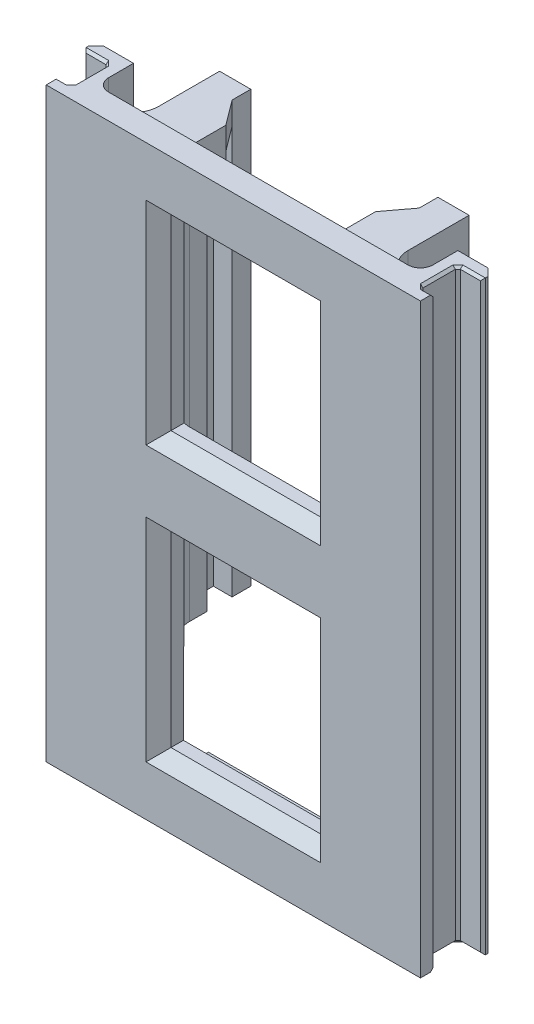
ISO-10303-21;
HEADER;
FILE_DESCRIPTION(('STEP AP214'),'2;1');
FILE_NAME('part.step','',(''),(''),'','','');
FILE_SCHEMA(('AUTOMOTIVE_DESIGN { 1 0 10303 214 1 1 1 1 }'));
ENDSEC;
DATA;
#1=APPLICATION_CONTEXT('core data for automotive mechanical design processes');
#2=APPLICATION_PROTOCOL_DEFINITION('international standard','automotive_design',2000,#1);
#3=PRODUCT_CONTEXT('',#1,'mechanical');
#4=PRODUCT('Part','Part','',(#3));
#5=PRODUCT_RELATED_PRODUCT_CATEGORY('part','',(#4));
#6=PRODUCT_DEFINITION_FORMATION('','',#4);
#7=PRODUCT_DEFINITION_CONTEXT('part definition',#1,'design');
#8=PRODUCT_DEFINITION('design','',#6,#7);
#9=PRODUCT_DEFINITION_SHAPE('','',#8);
#10=(LENGTH_UNIT() NAMED_UNIT(*) SI_UNIT(.MILLI.,.METRE.));
#11=(NAMED_UNIT(*) PLANE_ANGLE_UNIT() SI_UNIT($,.RADIAN.));
#12=(NAMED_UNIT(*) SI_UNIT($,.STERADIAN.) SOLID_ANGLE_UNIT());
#13=UNCERTAINTY_MEASURE_WITH_UNIT(LENGTH_MEASURE(1.E-05),#10,'distance_accuracy_value','');
#14=(GEOMETRIC_REPRESENTATION_CONTEXT(3) GLOBAL_UNCERTAINTY_ASSIGNED_CONTEXT((#13)) GLOBAL_UNIT_ASSIGNED_CONTEXT((#10,
#11,#12)) REPRESENTATION_CONTEXT('',''));
#15=CARTESIAN_POINT('',(0.,0.,0.));
#16=DIRECTION('',(0.,0.,1.));
#17=DIRECTION('',(1.,0.,0.));
#18=AXIS2_PLACEMENT_3D('',#15,#16,#17);
#19=CARTESIAN_POINT('',(0.,0.,0.));
#20=DIRECTION('',(0.,0.,1.));
#21=DIRECTION('',(1.,0.,0.));
#22=AXIS2_PLACEMENT_3D('',#19,#20,#21);
#23=PLANE('',#22);
#24=DIRECTION('',(0.,-1.,0.));
#25=VECTOR('',#24,1.);
#26=CARTESIAN_POINT('',(6.,-20.32,0.));
#27=LINE('',#26,#25);
#28=CARTESIAN_POINT('',(6.,-20.32,0.));
#29=VERTEX_POINT('',#28);
#30=CARTESIAN_POINT('',(6.,-22.5,0.));
#31=VERTEX_POINT('',#30);
#32=EDGE_CURVE('E596',#29,#31,#27,.T.);
#33=ORIENTED_EDGE('',*,*,#32,.F.);
#34=DIRECTION('',(1.,0.,0.));
#35=VECTOR('',#34,1.);
#36=CARTESIAN_POINT('',(6.,-20.32,0.));
#37=LINE('',#36,#35);
#38=CARTESIAN_POINT('',(-6.,-20.32,0.));
#39=VERTEX_POINT('',#38);
#40=EDGE_CURVE('E581',#39,#29,#37,.T.);
#41=ORIENTED_EDGE('',*,*,#40,.F.);
#42=DIRECTION('',(0.,1.,0.));
#43=VECTOR('',#42,1.);
#44=CARTESIAN_POINT('',(-6.,-20.32,0.));
#45=LINE('',#44,#43);
#46=CARTESIAN_POINT('',(-6.,-22.5,0.));
#47=VERTEX_POINT('',#46);
#48=EDGE_CURVE('E2910',#47,#39,#45,.T.);
#49=ORIENTED_EDGE('',*,*,#48,.F.);
#50=DIRECTION('',(-1.,0.,0.));
#51=VECTOR('',#50,1.);
#52=CARTESIAN_POINT('',(6.,-22.5,0.));
#53=LINE('',#52,#51);
#54=EDGE_CURVE('E2921',#31,#47,#53,.T.);
#55=ORIENTED_EDGE('',*,*,#54,.F.);
#56=EDGE_LOOP('',(#33,#41,#49,#55));
#57=FACE_BOUND('',#56,.T.);
#58=DIRECTION('',(1.,0.,0.));
#59=VECTOR('',#58,1.);
#60=CARTESIAN_POINT('',(-15.,-23.5,0.));
#61=LINE('',#60,#59);
#62=CARTESIAN_POINT('',(-12.,-23.5,0.));
#63=VERTEX_POINT('',#62);
#64=CARTESIAN_POINT('',(12.,-23.5,0.));
#65=VERTEX_POINT('',#64);
#66=EDGE_CURVE('E845',#63,#65,#61,.T.);
#67=ORIENTED_EDGE('',*,*,#66,.F.);
#68=DIRECTION('',(0.,1.,0.));
#69=VECTOR('',#68,1.);
#70=CARTESIAN_POINT('',(-12.,0.,0.));
#71=LINE('',#70,#69);
#72=CARTESIAN_POINT('',(-12.,-12.,0.));
#73=VERTEX_POINT('',#72);
#74=EDGE_CURVE('E1246',#63,#73,#71,.T.);
#75=ORIENTED_EDGE('',*,*,#74,.T.);
#76=DIRECTION('',(-1.,0.,0.));
#77=VECTOR('',#76,1.);
#78=CARTESIAN_POINT('',(-7.5,-12.,0.));
#79=LINE('',#78,#77);
#80=CARTESIAN_POINT('',(-6.,-12.,0.));
#81=VERTEX_POINT('',#80);
#82=EDGE_CURVE('E653',#81,#73,#79,.T.);
#83=ORIENTED_EDGE('',*,*,#82,.F.);
#84=DIRECTION('',(0.,-1.,0.));
#85=VECTOR('',#84,1.);
#86=CARTESIAN_POINT('',(-6.,-18.5,0.));
#87=LINE('',#86,#85);
#88=CARTESIAN_POINT('',(-6.,-18.5,0.));
#89=VERTEX_POINT('',#88);
#90=EDGE_CURVE('E762',#81,#89,#87,.T.);
#91=ORIENTED_EDGE('',*,*,#90,.T.);
#92=DIRECTION('',(1.,0.,0.));
#93=VECTOR('',#92,1.);
#94=CARTESIAN_POINT('',(-6.,-18.5,0.));
#95=LINE('',#94,#93);
#96=CARTESIAN_POINT('',(6.,-18.5,0.));
#97=VERTEX_POINT('',#96);
#98=EDGE_CURVE('E768',#89,#97,#95,.T.);
#99=ORIENTED_EDGE('',*,*,#98,.T.);
#100=DIRECTION('',(0.,1.,0.));
#101=VECTOR('',#100,1.);
#102=CARTESIAN_POINT('',(6.,-18.5,0.));
#103=LINE('',#102,#101);
#104=CARTESIAN_POINT('',(6.,-12.,0.));
#105=VERTEX_POINT('',#104);
#106=EDGE_CURVE('E755',#97,#105,#103,.T.);
#107=ORIENTED_EDGE('',*,*,#106,.T.);
#108=DIRECTION('',(1.,0.,0.));
#109=VECTOR('',#108,1.);
#110=CARTESIAN_POINT('',(7.5,-12.,0.));
#111=LINE('',#110,#109);
#112=CARTESIAN_POINT('',(12.,-12.,0.));
#113=VERTEX_POINT('',#112);
#114=EDGE_CURVE('E713',#105,#113,#111,.T.);
#115=ORIENTED_EDGE('',*,*,#114,.T.);
#116=DIRECTION('',(0.,1.,0.));
#117=VECTOR('',#116,1.);
#118=CARTESIAN_POINT('',(12.,-23.5,0.));
#119=LINE('',#118,#117);
#120=EDGE_CURVE('E1240',#113,#65,#119,.F.);
#121=ORIENTED_EDGE('',*,*,#120,.T.);
#122=EDGE_LOOP('',(#67,#75,#83,#91,#99,#107,#115,#121));
#123=FACE_BOUND('',#122,.T.);
#124=ADVANCED_FACE('F44',(#57,#123),#23,.F.);
#125=DIRECTION('',(-1.,0.,0.));
#126=VECTOR('',#125,1.);
#127=CARTESIAN_POINT('',(-6.,22.5,0.));
#128=LINE('',#127,#126);
#129=CARTESIAN_POINT('',(-6.,22.5,0.));
#130=VERTEX_POINT('',#129);
#131=CARTESIAN_POINT('',(-12.,22.5,0.));
#132=VERTEX_POINT('',#131);
#133=EDGE_CURVE('E619',#130,#132,#128,.T.);
#134=ORIENTED_EDGE('',*,*,#133,.T.);
#135=DIRECTION('',(0.,1.,0.));
#136=VECTOR('',#135,1.);
#137=CARTESIAN_POINT('',(-12.,0.,0.));
#138=LINE('',#137,#136);
#139=CARTESIAN_POINT('',(-12.,23.5,0.));
#140=VERTEX_POINT('',#139);
#141=EDGE_CURVE('E1244',#132,#140,#138,.T.);
#142=ORIENTED_EDGE('',*,*,#141,.T.);
#143=DIRECTION('',(-1.,0.,0.));
#144=VECTOR('',#143,1.);
#145=CARTESIAN_POINT('',(-15.,23.5,0.));
#146=LINE('',#145,#144);
#147=CARTESIAN_POINT('',(12.,23.5,0.));
#148=VERTEX_POINT('',#147);
#149=EDGE_CURVE('E850',#148,#140,#146,.T.);
#150=ORIENTED_EDGE('',*,*,#149,.F.);
#151=DIRECTION('',(0.,1.,0.));
#152=VECTOR('',#151,1.);
#153=CARTESIAN_POINT('',(12.,-23.5,0.));
#154=LINE('',#153,#152);
#155=CARTESIAN_POINT('',(12.,22.5,0.));
#156=VERTEX_POINT('',#155);
#157=EDGE_CURVE('E1242',#148,#156,#154,.F.);
#158=ORIENTED_EDGE('',*,*,#157,.T.);
#159=DIRECTION('',(1.,0.,0.));
#160=VECTOR('',#159,1.);
#161=CARTESIAN_POINT('',(6.,22.5,0.));
#162=LINE('',#161,#160);
#163=CARTESIAN_POINT('',(6.,22.5,0.));
#164=VERTEX_POINT('',#163);
#165=EDGE_CURVE('E682',#164,#156,#162,.T.);
#166=ORIENTED_EDGE('',*,*,#165,.F.);
#167=DIRECTION('',(0.,1.,0.));
#168=VECTOR('',#167,1.);
#169=CARTESIAN_POINT('',(6.,20.68,0.));
#170=LINE('',#169,#168);
#171=CARTESIAN_POINT('',(6.,18.5,0.));
#172=VERTEX_POINT('',#171);
#173=EDGE_CURVE('E702',#172,#164,#170,.T.);
#174=ORIENTED_EDGE('',*,*,#173,.F.);
#175=DIRECTION('',(1.,0.,0.));
#176=VECTOR('',#175,1.);
#177=CARTESIAN_POINT('',(-6.,18.5,0.));
#178=LINE('',#177,#176);
#179=CARTESIAN_POINT('',(-6.,18.5,0.));
#180=VERTEX_POINT('',#179);
#181=EDGE_CURVE('E780',#180,#172,#178,.T.);
#182=ORIENTED_EDGE('',*,*,#181,.F.);
#183=DIRECTION('',(0.,1.,0.));
#184=VECTOR('',#183,1.);
#185=CARTESIAN_POINT('',(-6.,20.68,0.));
#186=LINE('',#185,#184);
#187=EDGE_CURVE('E626',#180,#130,#186,.T.);
#188=ORIENTED_EDGE('',*,*,#187,.T.);
#189=EDGE_LOOP('',(#134,#142,#150,#158,#166,#174,#182,#188));
#190=FACE_BOUND('',#189,.T.);
#191=ADVANCED_FACE('F1263',(#190),#23,.F.);
#192=DIRECTION('',(-1.,0.,0.));
#193=VECTOR('',#192,1.);
#194=CARTESIAN_POINT('',(-6.,-3.5,0.));
#195=LINE('',#194,#193);
#196=CARTESIAN_POINT('',(5.5,-3.5,0.));
#197=VERTEX_POINT('',#196);
#198=CARTESIAN_POINT('',(-5.5,-3.5,0.));
#199=VERTEX_POINT('',#198);
#200=EDGE_CURVE('E758',#197,#199,#195,.T.);
#201=ORIENTED_EDGE('',*,*,#200,.T.);
#202=DIRECTION('',(0.,-1.,0.));
#203=VECTOR('',#202,1.);
#204=CARTESIAN_POINT('',(-5.5,0.,0.));
#205=LINE('',#204,#203);
#206=CARTESIAN_POINT('',(-5.5,3.5,0.));
#207=VERTEX_POINT('',#206);
#208=EDGE_CURVE('E1201',#199,#207,#205,.F.);
#209=ORIENTED_EDGE('',*,*,#208,.T.);
#210=DIRECTION('',(-1.,0.,0.));
#211=VECTOR('',#210,1.);
#212=CARTESIAN_POINT('',(-6.,3.5,0.));
#213=LINE('',#212,#211);
#214=CARTESIAN_POINT('',(5.5,3.5,0.));
#215=VERTEX_POINT('',#214);
#216=EDGE_CURVE('E788',#215,#207,#213,.T.);
#217=ORIENTED_EDGE('',*,*,#216,.F.);
#218=DIRECTION('',(0.,-1.,0.));
#219=VECTOR('',#218,1.);
#220=CARTESIAN_POINT('',(5.5,-12.,0.));
#221=LINE('',#220,#219);
#222=EDGE_CURVE('E1159',#215,#197,#221,.T.);
#223=ORIENTED_EDGE('',*,*,#222,.T.);
#224=EDGE_LOOP('',(#201,#209,#217,#223));
#225=FACE_BOUND('',#224,.T.);
#226=ADVANCED_FACE('F1473',(#225),#23,.F.);
#227=CARTESIAN_POINT('',(7.5,20.68,0.));
#228=DIRECTION('',(1.,0.,0.));
#229=DIRECTION('',(0.,0.,-1.));
#230=AXIS2_PLACEMENT_3D('',#227,#228,#229);
#231=PLANE('',#230);
#232=DIRECTION('',(0.,-1.,0.));
#233=VECTOR('',#232,1.);
#234=CARTESIAN_POINT('',(7.5,18.5,-2.));
#235=LINE('',#234,#233);
#236=CARTESIAN_POINT('',(7.5,-12.,-2.));
#237=VERTEX_POINT('',#236);
#238=CARTESIAN_POINT('',(7.5,16.5635083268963,-2.));
#239=VERTEX_POINT('',#238);
#240=EDGE_CURVE('E1162',#237,#239,#235,.F.);
#241=ORIENTED_EDGE('',*,*,#240,.T.);
#242=DIRECTION('',(0.,0.,-1.));
#243=VECTOR('',#242,1.);
#244=CARTESIAN_POINT('',(7.5,16.5635083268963,0.));
#245=LINE('',#244,#243);
#246=CARTESIAN_POINT('',(7.5,16.5635083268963,-3.4));
#247=VERTEX_POINT('',#246);
#248=EDGE_CURVE('E1190',#239,#247,#245,.T.);
#249=ORIENTED_EDGE('',*,*,#248,.T.);
#250=DIRECTION('',(0.,-1.,0.));
#251=VECTOR('',#250,1.);
#252=CARTESIAN_POINT('',(7.5,20.68,-3.4));
#253=LINE('',#252,#251);
#254=CARTESIAN_POINT('',(7.5,-12.,-3.4));
#255=VERTEX_POINT('',#254);
#256=EDGE_CURVE('E741',#247,#255,#253,.T.);
#257=ORIENTED_EDGE('',*,*,#256,.T.);
#258=DIRECTION('',(0.,0.,1.));
#259=VECTOR('',#258,1.);
#260=CARTESIAN_POINT('',(7.5,-12.,0.));
#261=LINE('',#260,#259);
#262=EDGE_CURVE('E706',#255,#237,#261,.T.);
#263=ORIENTED_EDGE('',*,*,#262,.T.);
#264=EDGE_LOOP('',(#241,#249,#257,#263));
#265=FACE_BOUND('',#264,.T.);
#266=ADVANCED_FACE('F1480',(#265),#231,.F.);
#267=CARTESIAN_POINT('',(0.,0.,2.));
#268=DIRECTION('',(0.,0.,1.));
#269=DIRECTION('',(1.,0.,0.));
#270=AXIS2_PLACEMENT_3D('',#267,#268,#269);
#271=PLANE('',#270);
#272=DIRECTION('',(0.,1.,0.));
#273=VECTOR('',#272,1.);
#274=CARTESIAN_POINT('',(-7.,0.,2.));
#275=LINE('',#274,#273);
#276=CARTESIAN_POINT('',(-7.00000000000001,-19.5,2.));
#277=VERTEX_POINT('',#276);
#278=CARTESIAN_POINT('',(-7.,-2.49999999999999,2.));
#279=VERTEX_POINT('',#278);
#280=EDGE_CURVE('E1119',#277,#279,#275,.T.);
#281=ORIENTED_EDGE('',*,*,#280,.T.);
#282=DIRECTION('',(1.,0.,0.));
#283=VECTOR('',#282,1.);
#284=CARTESIAN_POINT('',(0.,-2.49999999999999,2.));
#285=LINE('',#284,#283);
#286=CARTESIAN_POINT('',(7.00000000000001,-2.49999999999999,2.));
#287=VERTEX_POINT('',#286);
#288=EDGE_CURVE('E1133',#279,#287,#285,.T.);
#289=ORIENTED_EDGE('',*,*,#288,.T.);
#290=DIRECTION('',(0.,-1.,0.));
#291=VECTOR('',#290,1.);
#292=CARTESIAN_POINT('',(7.00000000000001,0.,2.));
#293=LINE('',#292,#291);
#294=CARTESIAN_POINT('',(7.00000000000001,-19.5,2.));
#295=VERTEX_POINT('',#294);
#296=EDGE_CURVE('E1131',#287,#295,#293,.T.);
#297=ORIENTED_EDGE('',*,*,#296,.T.);
#298=DIRECTION('',(-1.,0.,0.));
#299=VECTOR('',#298,1.);
#300=CARTESIAN_POINT('',(0.,-19.5,2.));
#301=LINE('',#300,#299);
#302=EDGE_CURVE('E1129',#295,#277,#301,.T.);
#303=ORIENTED_EDGE('',*,*,#302,.T.);
#304=EDGE_LOOP('',(#281,#289,#297,#303));
#305=FACE_BOUND('',#304,.T.);
#306=DIRECTION('',(0.,-1.,0.));
#307=VECTOR('',#306,1.);
#308=CARTESIAN_POINT('',(7.00000000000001,3.5,2.));
#309=LINE('',#308,#307);
#310=CARTESIAN_POINT('',(7.00000000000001,19.5,2.));
#311=VERTEX_POINT('',#310);
#312=CARTESIAN_POINT('',(7.00000000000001,2.49999999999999,2.));
#313=VERTEX_POINT('',#312);
#314=EDGE_CURVE('E1108',#311,#313,#309,.T.);
#315=ORIENTED_EDGE('',*,*,#314,.T.);
#316=DIRECTION('',(-1.,0.,0.));
#317=VECTOR('',#316,1.);
#318=CARTESIAN_POINT('',(-6.,2.49999999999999,2.));
#319=LINE('',#318,#317);
#320=CARTESIAN_POINT('',(-7.00000000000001,2.49999999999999,2.));
#321=VERTEX_POINT('',#320);
#322=EDGE_CURVE('E1110',#313,#321,#319,.T.);
#323=ORIENTED_EDGE('',*,*,#322,.T.);
#324=DIRECTION('',(0.,1.,0.));
#325=VECTOR('',#324,1.);
#326=CARTESIAN_POINT('',(-7.00000000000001,18.5,2.));
#327=LINE('',#326,#325);
#328=CARTESIAN_POINT('',(-7.00000000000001,19.5,2.));
#329=VERTEX_POINT('',#328);
#330=EDGE_CURVE('E1104',#321,#329,#327,.T.);
#331=ORIENTED_EDGE('',*,*,#330,.T.);
#332=DIRECTION('',(1.,0.,0.));
#333=VECTOR('',#332,1.);
#334=CARTESIAN_POINT('',(6.,19.5,2.));
#335=LINE('',#334,#333);
#336=EDGE_CURVE('E1106',#329,#311,#335,.T.);
#337=ORIENTED_EDGE('',*,*,#336,.T.);
#338=EDGE_LOOP('',(#315,#323,#331,#337));
#339=FACE_BOUND('',#338,.T.);
#340=DIRECTION('',(0.,-1.,0.));
#341=VECTOR('',#340,1.);
#342=CARTESIAN_POINT('',(-15.,23.5,2.));
#343=LINE('',#342,#341);
#344=CARTESIAN_POINT('',(-15.,23.5,2.));
#345=VERTEX_POINT('',#344);
#346=CARTESIAN_POINT('',(-15.,-23.5,2.));
#347=VERTEX_POINT('',#346);
#348=EDGE_CURVE('E846',#345,#347,#343,.T.);
#349=ORIENTED_EDGE('',*,*,#348,.T.);
#350=DIRECTION('',(1.,0.,0.));
#351=VECTOR('',#350,1.);
#352=CARTESIAN_POINT('',(-15.,-23.5,2.));
#353=LINE('',#352,#351);
#354=CARTESIAN_POINT('',(15.,-23.5,2.));
#355=VERTEX_POINT('',#354);
#356=EDGE_CURVE('E849',#347,#355,#353,.T.);
#357=ORIENTED_EDGE('',*,*,#356,.T.);
#358=DIRECTION('',(0.,1.,0.));
#359=VECTOR('',#358,1.);
#360=CARTESIAN_POINT('',(15.,23.5,2.));
#361=LINE('',#360,#359);
#362=CARTESIAN_POINT('',(15.,23.5,2.));
#363=VERTEX_POINT('',#362);
#364=EDGE_CURVE('E852',#355,#363,#361,.T.);
#365=ORIENTED_EDGE('',*,*,#364,.T.);
#366=DIRECTION('',(-1.,0.,0.));
#367=VECTOR('',#366,1.);
#368=CARTESIAN_POINT('',(-15.,23.5,2.));
#369=LINE('',#368,#367);
#370=EDGE_CURVE('E854',#363,#345,#369,.T.);
#371=ORIENTED_EDGE('',*,*,#370,.T.);
#372=EDGE_LOOP('',(#349,#357,#365,#371));
#373=FACE_BOUND('',#372,.T.);
#374=ADVANCED_FACE('F1388',(#305,#339,#373),#271,.T.);
#375=CARTESIAN_POINT('',(-15.,23.5,2.));
#376=DIRECTION('',(0.,-1.,0.));
#377=DIRECTION('',(0.,0.,-1.));
#378=AXIS2_PLACEMENT_3D('',#375,#376,#377);
#379=PLANE('',#378);
#380=DIRECTION('',(0.,0.,1.));
#381=VECTOR('',#380,1.);
#382=CARTESIAN_POINT('',(-16.,23.5,-3.));
#383=LINE('',#382,#381);
#384=CARTESIAN_POINT('',(-16.,23.5,-2.40000000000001));
#385=VERTEX_POINT('',#384);
#386=CARTESIAN_POINT('',(-16.,23.5,-2.2));
#387=VERTEX_POINT('',#386);
#388=EDGE_CURVE('E806',#385,#387,#383,.T.);
#389=ORIENTED_EDGE('',*,*,#388,.T.);
#390=DIRECTION('',(1.,0.,0.));
#391=VECTOR('',#390,1.);
#392=CARTESIAN_POINT('',(-14.,23.5,-2.2));
#393=LINE('',#392,#391);
#394=CARTESIAN_POINT('',(-14.2,23.5,-2.2));
#395=VERTEX_POINT('',#394);
#396=EDGE_CURVE('E1050',#387,#395,#393,.T.);
#397=ORIENTED_EDGE('',*,*,#396,.T.);
#398=DIRECTION('',(-0.707106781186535,0.,-0.70710678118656));
#399=VECTOR('',#398,1.);
#400=CARTESIAN_POINT('',(-14.2,23.5,-2.20000000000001));
#401=LINE('',#400,#399);
#402=CARTESIAN_POINT('',(-14.,23.5,-2.));
#403=VERTEX_POINT('',#402);
#404=EDGE_CURVE('E1047',#403,#395,#401,.T.);
#405=ORIENTED_EDGE('',*,*,#404,.F.);
#406=DIRECTION('',(-0.707106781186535,0.,-0.70710678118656));
#407=VECTOR('',#406,1.);
#408=CARTESIAN_POINT('',(-14.2,23.5,-2.20000000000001));
#409=LINE('',#408,#407);
#410=CARTESIAN_POINT('',(-13.8,23.5,-1.8));
#411=VERTEX_POINT('',#410);
#412=EDGE_CURVE('E1044',#411,#403,#409,.T.);
#413=ORIENTED_EDGE('',*,*,#412,.F.);
#414=DIRECTION('',(0.,0.,1.));
#415=VECTOR('',#414,1.);
#416=CARTESIAN_POINT('',(-13.8,23.5,2.));
#417=LINE('',#416,#415);
#418=CARTESIAN_POINT('',(-13.8,23.5,0.799999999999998));
#419=VERTEX_POINT('',#418);
#420=EDGE_CURVE('E1040',#411,#419,#417,.T.);
#421=ORIENTED_EDGE('',*,*,#420,.T.);
#422=DIRECTION('',(0.707106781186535,0.,-0.70710678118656));
#423=VECTOR('',#422,1.);
#424=CARTESIAN_POINT('',(-13.8,23.5,0.799999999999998));
#425=LINE('',#424,#423);
#426=CARTESIAN_POINT('',(-14.,23.5,0.999999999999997));
#427=VERTEX_POINT('',#426);
#428=EDGE_CURVE('E1034',#427,#419,#425,.T.);
#429=ORIENTED_EDGE('',*,*,#428,.F.);
#430=DIRECTION('',(0.707106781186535,0.,-0.70710678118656));
#431=VECTOR('',#430,1.);
#432=CARTESIAN_POINT('',(-13.8,23.5,0.799999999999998));
#433=LINE('',#432,#431);
#434=CARTESIAN_POINT('',(-14.2,23.5,1.19999999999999));
#435=VERTEX_POINT('',#434);
#436=EDGE_CURVE('E1037',#435,#427,#433,.T.);
#437=ORIENTED_EDGE('',*,*,#436,.F.);
#438=DIRECTION('',(-1.,0.,0.));
#439=VECTOR('',#438,1.);
#440=CARTESIAN_POINT('',(-15.,23.5,1.19999999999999));
#441=LINE('',#440,#439);
#442=CARTESIAN_POINT('',(-15.,23.5,1.19999999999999));
#443=VERTEX_POINT('',#442);
#444=EDGE_CURVE('E1042',#435,#443,#441,.T.);
#445=ORIENTED_EDGE('',*,*,#444,.T.);
#446=DIRECTION('',(0.,0.,-1.));
#447=VECTOR('',#446,1.);
#448=CARTESIAN_POINT('',(-15.,23.5,2.));
#449=LINE('',#448,#447);
#450=EDGE_CURVE('E856',#345,#443,#449,.T.);
#451=ORIENTED_EDGE('',*,*,#450,.F.);
#452=ORIENTED_EDGE('',*,*,#370,.F.);
#453=DIRECTION('',(0.,0.,-1.));
#454=VECTOR('',#453,1.);
#455=CARTESIAN_POINT('',(15.,23.5,2.));
#456=LINE('',#455,#454);
#457=CARTESIAN_POINT('',(15.,23.5,1.2));
#458=VERTEX_POINT('',#457);
#459=EDGE_CURVE('E862',#363,#458,#456,.T.);
#460=ORIENTED_EDGE('',*,*,#459,.T.);
#461=DIRECTION('',(-1.,0.,0.));
#462=VECTOR('',#461,1.);
#463=CARTESIAN_POINT('',(-15.,23.5,1.2));
#464=LINE('',#463,#462);
#465=CARTESIAN_POINT('',(14.2,23.5,1.2));
#466=VERTEX_POINT('',#465);
#467=EDGE_CURVE('E935',#458,#466,#464,.T.);
#468=ORIENTED_EDGE('',*,*,#467,.T.);
#469=DIRECTION('',(0.707106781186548,0.,0.707106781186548));
#470=VECTOR('',#469,1.);
#471=CARTESIAN_POINT('',(14.2,23.5,1.2));
#472=LINE('',#471,#470);
#473=CARTESIAN_POINT('',(14.,23.5,0.999999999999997));
#474=VERTEX_POINT('',#473);
#475=EDGE_CURVE('E932',#474,#466,#472,.T.);
#476=ORIENTED_EDGE('',*,*,#475,.F.);
#477=DIRECTION('',(0.707106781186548,0.,0.707106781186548));
#478=VECTOR('',#477,1.);
#479=CARTESIAN_POINT('',(14.2,23.5,1.2));
#480=LINE('',#479,#478);
#481=CARTESIAN_POINT('',(13.8,23.5,0.799999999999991));
#482=VERTEX_POINT('',#481);
#483=EDGE_CURVE('E927',#482,#474,#480,.T.);
#484=ORIENTED_EDGE('',*,*,#483,.F.);
#485=DIRECTION('',(0.,0.,-1.));
#486=VECTOR('',#485,1.);
#487=CARTESIAN_POINT('',(13.8,23.5,2.));
#488=LINE('',#487,#486);
#489=CARTESIAN_POINT('',(13.8,23.5,-1.79999999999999));
#490=VERTEX_POINT('',#489);
#491=EDGE_CURVE('E925',#482,#490,#488,.T.);
#492=ORIENTED_EDGE('',*,*,#491,.T.);
#493=DIRECTION('',(-0.707106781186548,0.,0.707106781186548));
#494=VECTOR('',#493,1.);
#495=CARTESIAN_POINT('',(13.8,23.5,-1.79999999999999));
#496=LINE('',#495,#494);
#497=CARTESIAN_POINT('',(14.,23.5,-2.));
#498=VERTEX_POINT('',#497);
#499=EDGE_CURVE('E919',#498,#490,#496,.T.);
#500=ORIENTED_EDGE('',*,*,#499,.F.);
#501=DIRECTION('',(-0.707106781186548,0.,0.707106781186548));
#502=VECTOR('',#501,1.);
#503=CARTESIAN_POINT('',(13.8,23.5,-1.79999999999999));
#504=LINE('',#503,#502);
#505=CARTESIAN_POINT('',(14.2,23.5,-2.20000000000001));
#506=VERTEX_POINT('',#505);
#507=EDGE_CURVE('E922',#506,#498,#504,.T.);
#508=ORIENTED_EDGE('',*,*,#507,.F.);
#509=DIRECTION('',(1.,0.,0.));
#510=VECTOR('',#509,1.);
#511=CARTESIAN_POINT('',(-15.,23.5,-2.20000000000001));
#512=LINE('',#511,#510);
#513=CARTESIAN_POINT('',(16.,23.5,-2.2));
#514=VERTEX_POINT('',#513);
#515=EDGE_CURVE('E930',#506,#514,#512,.T.);
#516=ORIENTED_EDGE('',*,*,#515,.T.);
#517=DIRECTION('',(0.,0.,1.));
#518=VECTOR('',#517,1.);
#519=CARTESIAN_POINT('',(16.,23.5,-3.));
#520=LINE('',#519,#518);
#521=CARTESIAN_POINT('',(16.,23.5,-2.4));
#522=VERTEX_POINT('',#521);
#523=EDGE_CURVE('E827',#522,#514,#520,.T.);
#524=ORIENTED_EDGE('',*,*,#523,.F.);
#525=DIRECTION('',(-0.707106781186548,0.,-0.707106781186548));
#526=VECTOR('',#525,1.);
#527=CARTESIAN_POINT('',(16.,23.5,-2.4));
#528=LINE('',#527,#526);
#529=CARTESIAN_POINT('',(15.4,23.5,-3.));
#530=VERTEX_POINT('',#529);
#531=EDGE_CURVE('E874',#522,#530,#528,.T.);
#532=ORIENTED_EDGE('',*,*,#531,.T.);
#533=DIRECTION('',(1.,0.,0.));
#534=VECTOR('',#533,1.);
#535=CARTESIAN_POINT('',(15.,23.5,-3.));
#536=LINE('',#535,#534);
#537=CARTESIAN_POINT('',(13.,23.5,-3.));
#538=VERTEX_POINT('',#537);
#539=EDGE_CURVE('E837',#538,#530,#536,.T.);
#540=ORIENTED_EDGE('',*,*,#539,.F.);
#541=DIRECTION('',(0.,0.,1.));
#542=VECTOR('',#541,1.);
#543=CARTESIAN_POINT('',(13.,23.5,-3.));
#544=LINE('',#543,#542);
#545=CARTESIAN_POINT('',(13.,23.5,-1.));
#546=VERTEX_POINT('',#545);
#547=EDGE_CURVE('E840',#538,#546,#544,.T.);
#548=ORIENTED_EDGE('',*,*,#547,.T.);
#549=CARTESIAN_POINT('',(12.,23.5,-1.));
#550=DIRECTION('',(0.,-1.,0.));
#551=DIRECTION('',(0.,0.,-1.));
#552=AXIS2_PLACEMENT_3D('',#549,#550,#551);
#553=CIRCLE('',#552,1.);
#554=EDGE_CURVE('E52',#546,#148,#553,.T.);
#555=ORIENTED_EDGE('',*,*,#554,.T.);
#556=ORIENTED_EDGE('',*,*,#149,.T.);
#557=CARTESIAN_POINT('',(-12.,23.5,-1.));
#558=DIRECTION('',(0.,-1.,0.));
#559=DIRECTION('',(0.,0.,-1.));
#560=AXIS2_PLACEMENT_3D('',#557,#558,#559);
#561=CIRCLE('',#560,1.);
#562=CARTESIAN_POINT('',(-13.,23.5,-1.));
#563=VERTEX_POINT('',#562);
#564=EDGE_CURVE('E1253',#140,#563,#561,.T.);
#565=ORIENTED_EDGE('',*,*,#564,.T.);
#566=DIRECTION('',(0.,0.,1.));
#567=VECTOR('',#566,1.);
#568=CARTESIAN_POINT('',(-13.,23.5,-3.));
#569=LINE('',#568,#567);
#570=CARTESIAN_POINT('',(-13.,23.5,-3.));
#571=VERTEX_POINT('',#570);
#572=EDGE_CURVE('E820',#571,#563,#569,.T.);
#573=ORIENTED_EDGE('',*,*,#572,.F.);
#574=DIRECTION('',(-1.,0.,0.));
#575=VECTOR('',#574,1.);
#576=CARTESIAN_POINT('',(-15.,23.5,-3.));
#577=LINE('',#576,#575);
#578=CARTESIAN_POINT('',(-15.4,23.5,-3.));
#579=VERTEX_POINT('',#578);
#580=EDGE_CURVE('E809',#571,#579,#577,.T.);
#581=ORIENTED_EDGE('',*,*,#580,.T.);
#582=DIRECTION('',(-0.707106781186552,0.,0.707106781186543));
#583=VECTOR('',#582,1.);
#584=CARTESIAN_POINT('',(-15.4,23.5,-3.));
#585=LINE('',#584,#583);
#586=EDGE_CURVE('E989',#579,#385,#585,.T.);
#587=ORIENTED_EDGE('',*,*,#586,.T.);
#588=EDGE_LOOP('',(#389,#397,#405,#413,#421,#429,#437,#445,#451,#452,#460,#468,#476,#484,#492,
#500,#508,#516,#524,#532,#540,#548,#555,#556,#565,#573,#581,#587));
#589=FACE_BOUND('',#588,.T.);
#590=ADVANCED_FACE('F1258',(#589),#379,.F.);
#591=CARTESIAN_POINT('',(-15.,-23.5,2.));
#592=DIRECTION('',(0.,1.,0.));
#593=DIRECTION('',(0.,0.,1.));
#594=AXIS2_PLACEMENT_3D('',#591,#592,#593);
#595=PLANE('',#594);
#596=DIRECTION('',(0.,0.,-1.));
#597=VECTOR('',#596,1.);
#598=CARTESIAN_POINT('',(-15.,-23.5,2.));
#599=LINE('',#598,#597);
#600=CARTESIAN_POINT('',(-15.,-23.5,1.19999999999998));
#601=VERTEX_POINT('',#600);
#602=EDGE_CURVE('E868',#347,#601,#599,.T.);
#603=ORIENTED_EDGE('',*,*,#602,.T.);
#604=DIRECTION('',(1.,0.,0.));
#605=VECTOR('',#604,1.);
#606=CARTESIAN_POINT('',(-14.,-23.5,1.19999999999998));
#607=LINE('',#606,#605);
#608=CARTESIAN_POINT('',(-14.2,-23.5,1.19999999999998));
#609=VERTEX_POINT('',#608);
#610=EDGE_CURVE('E1023',#601,#609,#607,.T.);
#611=ORIENTED_EDGE('',*,*,#610,.T.);
#612=DIRECTION('',(-0.707106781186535,0.,0.70710678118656));
#613=VECTOR('',#612,1.);
#614=CARTESIAN_POINT('',(-14.2,-23.5,1.19999999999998));
#615=LINE('',#614,#613);
#616=CARTESIAN_POINT('',(-14.,-23.5,0.999999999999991));
#617=VERTEX_POINT('',#616);
#618=EDGE_CURVE('E1020',#617,#609,#615,.T.);
#619=ORIENTED_EDGE('',*,*,#618,.F.);
#620=DIRECTION('',(-0.707106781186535,0.,0.70710678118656));
#621=VECTOR('',#620,1.);
#622=CARTESIAN_POINT('',(-14.2,-23.5,1.19999999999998));
#623=LINE('',#622,#621);
#624=CARTESIAN_POINT('',(-13.8,-23.5,0.799999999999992));
#625=VERTEX_POINT('',#624);
#626=EDGE_CURVE('E1017',#625,#617,#623,.T.);
#627=ORIENTED_EDGE('',*,*,#626,.F.);
#628=DIRECTION('',(0.,0.,-1.));
#629=VECTOR('',#628,1.);
#630=CARTESIAN_POINT('',(-13.8,-23.5,2.));
#631=LINE('',#630,#629);
#632=CARTESIAN_POINT('',(-13.8,-23.5,-1.80000000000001));
#633=VERTEX_POINT('',#632);
#634=EDGE_CURVE('E1013',#625,#633,#631,.T.);
#635=ORIENTED_EDGE('',*,*,#634,.T.);
#636=DIRECTION('',(0.707106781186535,0.,0.70710678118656));
#637=VECTOR('',#636,1.);
#638=CARTESIAN_POINT('',(-13.8,-23.5,-1.80000000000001));
#639=LINE('',#638,#637);
#640=CARTESIAN_POINT('',(-14.,-23.5,-2.00000000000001));
#641=VERTEX_POINT('',#640);
#642=EDGE_CURVE('E1007',#641,#633,#639,.T.);
#643=ORIENTED_EDGE('',*,*,#642,.F.);
#644=DIRECTION('',(0.707106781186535,0.,0.70710678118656));
#645=VECTOR('',#644,1.);
#646=CARTESIAN_POINT('',(-13.8,-23.5,-1.80000000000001));
#647=LINE('',#646,#645);
#648=CARTESIAN_POINT('',(-14.2,-23.5,-2.2));
#649=VERTEX_POINT('',#648);
#650=EDGE_CURVE('E1010',#649,#641,#647,.T.);
#651=ORIENTED_EDGE('',*,*,#650,.F.);
#652=DIRECTION('',(-1.,0.,0.));
#653=VECTOR('',#652,1.);
#654=CARTESIAN_POINT('',(-16.,-23.5,-2.2));
#655=LINE('',#654,#653);
#656=CARTESIAN_POINT('',(-16.,-23.5,-2.20000000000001));
#657=VERTEX_POINT('',#656);
#658=EDGE_CURVE('E1015',#649,#657,#655,.T.);
#659=ORIENTED_EDGE('',*,*,#658,.T.);
#660=DIRECTION('',(0.,0.,-1.));
#661=VECTOR('',#660,1.);
#662=CARTESIAN_POINT('',(-16.,-23.5,-3.00000000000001));
#663=LINE('',#662,#661);
#664=CARTESIAN_POINT('',(-16.,-23.5,-2.40000000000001));
#665=VERTEX_POINT('',#664);
#666=EDGE_CURVE('E803',#657,#665,#663,.T.);
#667=ORIENTED_EDGE('',*,*,#666,.T.);
#668=DIRECTION('',(0.707106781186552,0.,-0.707106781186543));
#669=VECTOR('',#668,1.);
#670=CARTESIAN_POINT('',(-15.4,-23.5,-3.));
#671=LINE('',#670,#669);
#672=CARTESIAN_POINT('',(-15.4,-23.5,-3.));
#673=VERTEX_POINT('',#672);
#674=EDGE_CURVE('E994',#665,#673,#671,.T.);
#675=ORIENTED_EDGE('',*,*,#674,.T.);
#676=DIRECTION('',(1.,0.,0.));
#677=VECTOR('',#676,1.);
#678=CARTESIAN_POINT('',(-15.,-23.5,-3.));
#679=LINE('',#678,#677);
#680=CARTESIAN_POINT('',(-13.,-23.5,-3.));
#681=VERTEX_POINT('',#680);
#682=EDGE_CURVE('E815',#673,#681,#679,.T.);
#683=ORIENTED_EDGE('',*,*,#682,.T.);
#684=DIRECTION('',(0.,0.,1.));
#685=VECTOR('',#684,1.);
#686=CARTESIAN_POINT('',(-13.,-23.5,-3.));
#687=LINE('',#686,#685);
#688=CARTESIAN_POINT('',(-13.,-23.5,-1.));
#689=VERTEX_POINT('',#688);
#690=EDGE_CURVE('E817',#681,#689,#687,.T.);
#691=ORIENTED_EDGE('',*,*,#690,.T.);
#692=CARTESIAN_POINT('',(-12.,-23.5,-1.));
#693=DIRECTION('',(0.,1.,0.));
#694=DIRECTION('',(0.,0.,1.));
#695=AXIS2_PLACEMENT_3D('',#692,#693,#694);
#696=CIRCLE('',#695,1.);
#697=EDGE_CURVE('E1255',#689,#63,#696,.T.);
#698=ORIENTED_EDGE('',*,*,#697,.T.);
#699=ORIENTED_EDGE('',*,*,#66,.T.);
#700=CARTESIAN_POINT('',(12.,-23.5,-1.));
#701=DIRECTION('',(0.,1.,0.));
#702=DIRECTION('',(0.,0.,1.));
#703=AXIS2_PLACEMENT_3D('',#700,#701,#702);
#704=CIRCLE('',#703,1.);
#705=CARTESIAN_POINT('',(13.,-23.5,-1.));
#706=VERTEX_POINT('',#705);
#707=EDGE_CURVE('E11',#65,#706,#704,.T.);
#708=ORIENTED_EDGE('',*,*,#707,.T.);
#709=DIRECTION('',(0.,0.,1.));
#710=VECTOR('',#709,1.);
#711=CARTESIAN_POINT('',(13.,-23.5,-3.));
#712=LINE('',#711,#710);
#713=CARTESIAN_POINT('',(13.,-23.5,-3.));
#714=VERTEX_POINT('',#713);
#715=EDGE_CURVE('E843',#714,#706,#712,.T.);
#716=ORIENTED_EDGE('',*,*,#715,.F.);
#717=DIRECTION('',(-1.,0.,0.));
#718=VECTOR('',#717,1.);
#719=CARTESIAN_POINT('',(15.,-23.5,-3.));
#720=LINE('',#719,#718);
#721=CARTESIAN_POINT('',(15.4,-23.5,-3.));
#722=VERTEX_POINT('',#721);
#723=EDGE_CURVE('E833',#722,#714,#720,.T.);
#724=ORIENTED_EDGE('',*,*,#723,.F.);
#725=DIRECTION('',(0.707106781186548,0.,0.707106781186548));
#726=VECTOR('',#725,1.);
#727=CARTESIAN_POINT('',(16.,-23.5,-2.4));
#728=LINE('',#727,#726);
#729=CARTESIAN_POINT('',(16.,-23.5,-2.4));
#730=VERTEX_POINT('',#729);
#731=EDGE_CURVE('E878',#722,#730,#728,.T.);
#732=ORIENTED_EDGE('',*,*,#731,.T.);
#733=DIRECTION('',(0.,0.,-1.));
#734=VECTOR('',#733,1.);
#735=CARTESIAN_POINT('',(16.,-23.5,-3.00000000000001));
#736=LINE('',#735,#734);
#737=CARTESIAN_POINT('',(16.,-23.5,-2.20000000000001));
#738=VERTEX_POINT('',#737);
#739=EDGE_CURVE('E831',#738,#730,#736,.T.);
#740=ORIENTED_EDGE('',*,*,#739,.F.);
#741=DIRECTION('',(-1.,0.,0.));
#742=VECTOR('',#741,1.);
#743=CARTESIAN_POINT('',(-15.,-23.5,-2.20000000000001));
#744=LINE('',#743,#742);
#745=CARTESIAN_POINT('',(14.2,-23.5,-2.20000000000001));
#746=VERTEX_POINT('',#745);
#747=EDGE_CURVE('E898',#738,#746,#744,.T.);
#748=ORIENTED_EDGE('',*,*,#747,.T.);
#749=DIRECTION('',(0.707106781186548,0.,-0.707106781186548));
#750=VECTOR('',#749,1.);
#751=CARTESIAN_POINT('',(14.2,-23.5,-2.20000000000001));
#752=LINE('',#751,#750);
#753=CARTESIAN_POINT('',(14.,-23.5,-2.00000000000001));
#754=VERTEX_POINT('',#753);
#755=EDGE_CURVE('E895',#754,#746,#752,.T.);
#756=ORIENTED_EDGE('',*,*,#755,.F.);
#757=DIRECTION('',(0.707106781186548,0.,-0.707106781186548));
#758=VECTOR('',#757,1.);
#759=CARTESIAN_POINT('',(14.2,-23.5,-2.20000000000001));
#760=LINE('',#759,#758);
#761=CARTESIAN_POINT('',(13.8,-23.5,-1.8));
#762=VERTEX_POINT('',#761);
#763=EDGE_CURVE('E889',#762,#754,#760,.T.);
#764=ORIENTED_EDGE('',*,*,#763,.F.);
#765=DIRECTION('',(0.,0.,1.));
#766=VECTOR('',#765,1.);
#767=CARTESIAN_POINT('',(13.8,-23.5,2.));
#768=LINE('',#767,#766);
#769=CARTESIAN_POINT('',(13.8,-23.5,0.799999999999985));
#770=VERTEX_POINT('',#769);
#771=EDGE_CURVE('E887',#762,#770,#768,.T.);
#772=ORIENTED_EDGE('',*,*,#771,.T.);
#773=DIRECTION('',(-0.707106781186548,0.,-0.707106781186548));
#774=VECTOR('',#773,1.);
#775=CARTESIAN_POINT('',(13.8,-23.5,0.799999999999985));
#776=LINE('',#775,#774);
#777=CARTESIAN_POINT('',(14.,-23.5,0.999999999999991));
#778=VERTEX_POINT('',#777);
#779=EDGE_CURVE('E881',#778,#770,#776,.T.);
#780=ORIENTED_EDGE('',*,*,#779,.F.);
#781=DIRECTION('',(-0.707106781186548,0.,-0.707106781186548));
#782=VECTOR('',#781,1.);
#783=CARTESIAN_POINT('',(13.8,-23.5,0.799999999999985));
#784=LINE('',#783,#782);
#785=CARTESIAN_POINT('',(14.2,-23.5,1.2));
#786=VERTEX_POINT('',#785);
#787=EDGE_CURVE('E884',#786,#778,#784,.T.);
#788=ORIENTED_EDGE('',*,*,#787,.F.);
#789=DIRECTION('',(1.,0.,0.));
#790=VECTOR('',#789,1.);
#791=CARTESIAN_POINT('',(-15.,-23.5,1.2));
#792=LINE('',#791,#790);
#793=CARTESIAN_POINT('',(15.,-23.5,1.2));
#794=VERTEX_POINT('',#793);
#795=EDGE_CURVE('E892',#786,#794,#792,.T.);
#796=ORIENTED_EDGE('',*,*,#795,.T.);
#797=DIRECTION('',(0.,0.,-1.));
#798=VECTOR('',#797,1.);
#799=CARTESIAN_POINT('',(15.,-23.5,2.));
#800=LINE('',#799,#798);
#801=EDGE_CURVE('E865',#355,#794,#800,.T.);
#802=ORIENTED_EDGE('',*,*,#801,.F.);
#803=ORIENTED_EDGE('',*,*,#356,.F.);
#804=EDGE_LOOP('',(#603,#611,#619,#627,#635,#643,#651,#659,#667,#675,#683,#691,#698,#699,#708,
#716,#724,#732,#740,#748,#756,#764,#772,#780,#788,#796,#802,#803));
#805=FACE_BOUND('',#804,.T.);
#806=ADVANCED_FACE('F1342',(#805),#595,.F.);
#807=CARTESIAN_POINT('',(-15.,23.5,2.));
#808=DIRECTION('',(1.,0.,0.));
#809=DIRECTION('',(0.,1.,0.));
#810=AXIS2_PLACEMENT_3D('',#807,#808,#809);
#811=PLANE('',#810);
#812=DIRECTION('',(0.,-1.,0.));
#813=VECTOR('',#812,1.);
#814=CARTESIAN_POINT('',(-15.,23.5,0.999999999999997));
#815=LINE('',#814,#813);
#816=CARTESIAN_POINT('',(-15.,23.3,0.999999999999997));
#817=VERTEX_POINT('',#816);
#818=CARTESIAN_POINT('',(-15.,-23.3,0.999999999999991));
#819=VERTEX_POINT('',#818);
#820=EDGE_CURVE('E800',#817,#819,#815,.T.);
#821=ORIENTED_EDGE('',*,*,#820,.T.);
#822=DIRECTION('',(0.,-0.70710678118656,0.707106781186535));
#823=VECTOR('',#822,1.);
#824=CARTESIAN_POINT('',(-15.,-23.3,0.999999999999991));
#825=LINE('',#824,#823);
#826=EDGE_CURVE('E1005',#819,#601,#825,.T.);
#827=ORIENTED_EDGE('',*,*,#826,.T.);
#828=ORIENTED_EDGE('',*,*,#602,.F.);
#829=ORIENTED_EDGE('',*,*,#348,.F.);
#830=ORIENTED_EDGE('',*,*,#450,.T.);
#831=DIRECTION('',(0.,-0.70710678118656,-0.707106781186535));
#832=VECTOR('',#831,1.);
#833=CARTESIAN_POINT('',(-15.,23.5,1.19999999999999));
#834=LINE('',#833,#832);
#835=EDGE_CURVE('E1003',#443,#817,#834,.T.);
#836=ORIENTED_EDGE('',*,*,#835,.T.);
#837=EDGE_LOOP('',(#821,#827,#828,#829,#830,#836));
#838=FACE_BOUND('',#837,.T.);
#839=ADVANCED_FACE('F1384',(#838),#811,.F.);
#840=CARTESIAN_POINT('',(15.,23.5,2.));
#841=DIRECTION('',(-1.,0.,0.));
#842=DIRECTION('',(0.,-1.,0.));
#843=AXIS2_PLACEMENT_3D('',#840,#841,#842);
#844=PLANE('',#843);
#845=ORIENTED_EDGE('',*,*,#801,.T.);
#846=DIRECTION('',(0.,-0.707106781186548,0.707106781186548));
#847=VECTOR('',#846,1.);
#848=CARTESIAN_POINT('',(15.,-23.5,1.19999999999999));
#849=LINE('',#848,#847);
#850=CARTESIAN_POINT('',(15.,-23.3,0.999999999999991));
#851=VERTEX_POINT('',#850);
#852=EDGE_CURVE('E902',#794,#851,#849,.F.);
#853=ORIENTED_EDGE('',*,*,#852,.T.);
#854=DIRECTION('',(0.,-1.,0.));
#855=VECTOR('',#854,1.);
#856=CARTESIAN_POINT('',(15.,23.5,0.999999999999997));
#857=LINE('',#856,#855);
#858=CARTESIAN_POINT('',(15.,23.3,0.999999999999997));
#859=VERTEX_POINT('',#858);
#860=EDGE_CURVE('E824',#859,#851,#857,.T.);
#861=ORIENTED_EDGE('',*,*,#860,.F.);
#862=DIRECTION('',(0.,-0.707106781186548,-0.707106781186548));
#863=VECTOR('',#862,1.);
#864=CARTESIAN_POINT('',(15.,23.3,0.999999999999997));
#865=LINE('',#864,#863);
#866=EDGE_CURVE('E900',#859,#458,#865,.F.);
#867=ORIENTED_EDGE('',*,*,#866,.T.);
#868=ORIENTED_EDGE('',*,*,#459,.F.);
#869=ORIENTED_EDGE('',*,*,#364,.F.);
#870=EDGE_LOOP('',(#845,#853,#861,#867,#868,#869));
#871=FACE_BOUND('',#870,.T.);
#872=ADVANCED_FACE('F1460',(#871),#844,.F.);
#873=CARTESIAN_POINT('',(13.,23.5,-3.));
#874=DIRECTION('',(1.,0.,0.));
#875=DIRECTION('',(0.,1.,0.));
#876=AXIS2_PLACEMENT_3D('',#873,#874,#875);
#877=PLANE('',#876);
#878=ORIENTED_EDGE('',*,*,#715,.T.);
#879=DIRECTION('',(0.,1.,0.));
#880=VECTOR('',#879,1.);
#881=CARTESIAN_POINT('',(13.,23.5,-1.));
#882=LINE('',#881,#880);
#883=EDGE_CURVE('E1251',#706,#546,#882,.T.);
#884=ORIENTED_EDGE('',*,*,#883,.T.);
#885=ORIENTED_EDGE('',*,*,#547,.F.);
#886=DIRECTION('',(0.,1.,0.));
#887=VECTOR('',#886,1.);
#888=CARTESIAN_POINT('',(13.,23.5,-3.));
#889=LINE('',#888,#887);
#890=EDGE_CURVE('E835',#714,#538,#889,.T.);
#891=ORIENTED_EDGE('',*,*,#890,.F.);
#892=EDGE_LOOP('',(#878,#884,#885,#891));
#893=FACE_BOUND('',#892,.T.);
#894=ADVANCED_FACE('F1458',(#893),#877,.F.);
#895=CARTESIAN_POINT('',(0.,0.,-3.));
#896=DIRECTION('',(0.,0.,-1.));
#897=DIRECTION('',(-1.,0.,0.));
#898=AXIS2_PLACEMENT_3D('',#895,#896,#897);
#899=PLANE('',#898);
#900=ORIENTED_EDGE('',*,*,#539,.T.);
#901=DIRECTION('',(0.,-1.,0.));
#902=VECTOR('',#901,1.);
#903=CARTESIAN_POINT('',(15.4,-23.5,-3.));
#904=LINE('',#903,#902);
#905=EDGE_CURVE('E876',#530,#722,#904,.T.);
#906=ORIENTED_EDGE('',*,*,#905,.T.);
#907=ORIENTED_EDGE('',*,*,#723,.T.);
#908=ORIENTED_EDGE('',*,*,#890,.T.);
#909=EDGE_LOOP('',(#900,#906,#907,#908));
#910=FACE_BOUND('',#909,.T.);
#911=ADVANCED_FACE('F1455',(#910),#899,.T.);
#912=CARTESIAN_POINT('',(16.,23.5,-2.));
#913=DIRECTION('',(0.,0.,-1.));
#914=DIRECTION('',(0.,1.,0.));
#915=AXIS2_PLACEMENT_3D('',#912,#913,#914);
#916=PLANE('',#915);
#917=DIRECTION('',(-1.,0.,0.));
#918=VECTOR('',#917,1.);
#919=CARTESIAN_POINT('',(16.,23.3,-2.));
#920=LINE('',#919,#918);
#921=CARTESIAN_POINT('',(15.8,23.3,-2.));
#922=VERTEX_POINT('',#921);
#923=CARTESIAN_POINT('',(14.2,23.3,-2.));
#924=VERTEX_POINT('',#923);
#925=EDGE_CURVE('E912',#922,#924,#920,.T.);
#926=ORIENTED_EDGE('',*,*,#925,.T.);
#927=DIRECTION('',(0.,-1.,0.));
#928=VECTOR('',#927,1.);
#929=CARTESIAN_POINT('',(14.2,-23.5,-2.00000000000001));
#930=LINE('',#929,#928);
#931=CARTESIAN_POINT('',(14.2,-23.3,-2.00000000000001));
#932=VERTEX_POINT('',#931);
#933=EDGE_CURVE('E917',#924,#932,#930,.T.);
#934=ORIENTED_EDGE('',*,*,#933,.T.);
#935=DIRECTION('',(1.,0.,0.));
#936=VECTOR('',#935,1.);
#937=CARTESIAN_POINT('',(16.,-23.3,-2.00000000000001));
#938=LINE('',#937,#936);
#939=CARTESIAN_POINT('',(15.8,-23.3,-2.00000000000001));
#940=VERTEX_POINT('',#939);
#941=EDGE_CURVE('E914',#932,#940,#938,.T.);
#942=ORIENTED_EDGE('',*,*,#941,.T.);
#943=DIRECTION('',(0.,1.,0.));
#944=VECTOR('',#943,1.);
#945=CARTESIAN_POINT('',(15.8,23.5,-2.));
#946=LINE('',#945,#944);
#947=EDGE_CURVE('E910',#940,#922,#946,.T.);
#948=ORIENTED_EDGE('',*,*,#947,.T.);
#949=EDGE_LOOP('',(#926,#934,#942,#948));
#950=FACE_BOUND('',#949,.T.);
#951=ADVANCED_FACE('F1466',(#950),#916,.F.);
#952=CARTESIAN_POINT('',(16.,0.,0.));
#953=DIRECTION('',(-1.,0.,0.));
#954=DIRECTION('',(0.,-1.,0.));
#955=AXIS2_PLACEMENT_3D('',#952,#953,#954);
#956=PLANE('',#955);
#957=ORIENTED_EDGE('',*,*,#523,.T.);
#958=DIRECTION('',(0.,-1.,0.));
#959=VECTOR('',#958,1.);
#960=CARTESIAN_POINT('',(16.,0.,-2.2));
#961=LINE('',#960,#959);
#962=EDGE_CURVE('E946',#514,#738,#961,.T.);
#963=ORIENTED_EDGE('',*,*,#962,.T.);
#964=ORIENTED_EDGE('',*,*,#739,.T.);
#965=DIRECTION('',(0.,1.,0.));
#966=VECTOR('',#965,1.);
#967=CARTESIAN_POINT('',(16.,23.5,-2.4));
#968=LINE('',#967,#966);
#969=EDGE_CURVE('E871',#730,#522,#968,.T.);
#970=ORIENTED_EDGE('',*,*,#969,.T.);
#971=EDGE_LOOP('',(#957,#963,#964,#970));
#972=FACE_BOUND('',#971,.T.);
#973=ADVANCED_FACE('F1447',(#972),#956,.F.);
#974=CARTESIAN_POINT('',(16.,0.,-2.4));
#975=DIRECTION('',(0.707106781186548,0.,-0.707106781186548));
#976=DIRECTION('',(0.,-1.,0.));
#977=AXIS2_PLACEMENT_3D('',#974,#975,#976);
#978=PLANE('',#977);
#979=ORIENTED_EDGE('',*,*,#731,.F.);
#980=ORIENTED_EDGE('',*,*,#905,.F.);
#981=ORIENTED_EDGE('',*,*,#531,.F.);
#982=ORIENTED_EDGE('',*,*,#969,.F.);
#983=EDGE_LOOP('',(#979,#980,#981,#982));
#984=FACE_BOUND('',#983,.T.);
#985=ADVANCED_FACE('F1453',(#984),#978,.T.);
#986=CARTESIAN_POINT('',(14.,23.5,0.999999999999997));
#987=DIRECTION('',(0.,0.,1.));
#988=DIRECTION('',(0.,-1.,0.));
#989=AXIS2_PLACEMENT_3D('',#986,#987,#988);
#990=PLANE('',#989);
#991=ORIENTED_EDGE('',*,*,#860,.T.);
#992=DIRECTION('',(-1.,0.,0.));
#993=VECTOR('',#992,1.);
#994=CARTESIAN_POINT('',(14.,-23.3,0.999999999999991));
#995=LINE('',#994,#993);
#996=CARTESIAN_POINT('',(14.2,-23.3,0.999999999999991));
#997=VERTEX_POINT('',#996);
#998=EDGE_CURVE('E908',#851,#997,#995,.T.);
#999=ORIENTED_EDGE('',*,*,#998,.T.);
#1000=DIRECTION('',(0.,1.,0.));
#1001=VECTOR('',#1000,1.);
#1002=CARTESIAN_POINT('',(14.2,23.5,0.999999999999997));
#1003=LINE('',#1002,#1001);
#1004=CARTESIAN_POINT('',(14.2,23.3,0.999999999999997));
#1005=VERTEX_POINT('',#1004);
#1006=EDGE_CURVE('E904',#997,#1005,#1003,.T.);
#1007=ORIENTED_EDGE('',*,*,#1006,.T.);
#1008=DIRECTION('',(1.,0.,0.));
#1009=VECTOR('',#1008,1.);
#1010=CARTESIAN_POINT('',(14.,23.3,0.999999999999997));
#1011=LINE('',#1010,#1009);
#1012=EDGE_CURVE('E906',#1005,#859,#1011,.T.);
#1013=ORIENTED_EDGE('',*,*,#1012,.T.);
#1014=EDGE_LOOP('',(#991,#999,#1007,#1013));
#1015=FACE_BOUND('',#1014,.T.);
#1016=ADVANCED_FACE('F2469',(#1015),#990,.F.);
#1017=CARTESIAN_POINT('',(14.,0.,0.));
#1018=DIRECTION('',(-1.,0.,0.));
#1019=DIRECTION('',(0.,-1.,0.));
#1020=AXIS2_PLACEMENT_3D('',#1017,#1018,#1019);
#1021=PLANE('',#1020);
#1022=DIRECTION('',(0.,-1.,0.));
#1023=VECTOR('',#1022,1.);
#1024=CARTESIAN_POINT('',(14.,-23.5,0.799999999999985));
#1025=LINE('',#1024,#1023);
#1026=CARTESIAN_POINT('',(14.,23.3,0.799999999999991));
#1027=VERTEX_POINT('',#1026);
#1028=CARTESIAN_POINT('',(14.,-23.3,0.799999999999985));
#1029=VERTEX_POINT('',#1028);
#1030=EDGE_CURVE('E937',#1027,#1029,#1025,.T.);
#1031=ORIENTED_EDGE('',*,*,#1030,.T.);
#1032=DIRECTION('',(0.,0.,-1.));
#1033=VECTOR('',#1032,1.);
#1034=CARTESIAN_POINT('',(14.,-23.3,0.));
#1035=LINE('',#1034,#1033);
#1036=CARTESIAN_POINT('',(14.,-23.3,-1.8));
#1037=VERTEX_POINT('',#1036);
#1038=EDGE_CURVE('E943',#1029,#1037,#1035,.T.);
#1039=ORIENTED_EDGE('',*,*,#1038,.T.);
#1040=DIRECTION('',(0.,1.,0.));
#1041=VECTOR('',#1040,1.);
#1042=CARTESIAN_POINT('',(14.,23.5,-1.79999999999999));
#1043=LINE('',#1042,#1041);
#1044=CARTESIAN_POINT('',(14.,23.3,-1.79999999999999));
#1045=VERTEX_POINT('',#1044);
#1046=EDGE_CURVE('E941',#1037,#1045,#1043,.T.);
#1047=ORIENTED_EDGE('',*,*,#1046,.T.);
#1048=DIRECTION('',(0.,0.,1.));
#1049=VECTOR('',#1048,1.);
#1050=CARTESIAN_POINT('',(14.,23.3,0.));
#1051=LINE('',#1050,#1049);
#1052=EDGE_CURVE('E939',#1045,#1027,#1051,.T.);
#1053=ORIENTED_EDGE('',*,*,#1052,.T.);
#1054=EDGE_LOOP('',(#1031,#1039,#1047,#1053));
#1055=FACE_BOUND('',#1054,.T.);
#1056=ADVANCED_FACE('F1415',(#1055),#1021,.F.);
#1057=CARTESIAN_POINT('',(16.,23.3,-2.));
#1058=DIRECTION('',(0.,-0.707106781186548,-0.707106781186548));
#1059=DIRECTION('',(-1.,0.,0.));
#1060=AXIS2_PLACEMENT_3D('',#1057,#1058,#1059);
#1061=PLANE('',#1060);
#1062=DIRECTION('',(-0.577350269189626,-0.577350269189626,0.577350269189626));
#1063=VECTOR('',#1062,1.);
#1064=CARTESIAN_POINT('',(8.16666666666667,15.6666666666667,5.63333333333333));
#1065=LINE('',#1064,#1063);
#1066=EDGE_CURVE('E982',#514,#922,#1065,.T.);
#1067=ORIENTED_EDGE('',*,*,#1066,.F.);
#1068=ORIENTED_EDGE('',*,*,#515,.F.);
#1069=DIRECTION('',(0.,0.707106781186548,-0.707106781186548));
#1070=VECTOR('',#1069,1.);
#1071=CARTESIAN_POINT('',(14.2,23.3,-2.));
#1072=LINE('',#1071,#1070);
#1073=EDGE_CURVE('E828',#924,#506,#1072,.T.);
#1074=ORIENTED_EDGE('',*,*,#1073,.F.);
#1075=ORIENTED_EDGE('',*,*,#925,.F.);
#1076=EDGE_LOOP('',(#1067,#1068,#1074,#1075));
#1077=FACE_BOUND('',#1076,.T.);
#1078=ADVANCED_FACE('F1437',(#1077),#1061,.F.);
#1079=CARTESIAN_POINT('',(14.,23.3,-1.79999999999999));
#1080=DIRECTION('',(0.577350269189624,0.577350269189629,0.577350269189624));
#1081=DIRECTION('',(0.,-0.707106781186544,0.707106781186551));
#1082=AXIS2_PLACEMENT_3D('',#1079,#1080,#1081);
#1083=PLANE('',#1082);
#1084=ORIENTED_EDGE('',*,*,#507,.T.);
#1085=ORIENTED_EDGE('',*,*,#499,.T.);
#1086=DIRECTION('',(0.707106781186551,-0.707106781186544,0.));
#1087=VECTOR('',#1086,1.);
#1088=CARTESIAN_POINT('',(13.8,23.5,-1.79999999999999));
#1089=LINE('',#1088,#1087);
#1090=EDGE_CURVE('E979',#1045,#490,#1089,.F.);
#1091=ORIENTED_EDGE('',*,*,#1090,.F.);
#1092=DIRECTION('',(-0.707106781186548,0.,0.707106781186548));
#1093=VECTOR('',#1092,1.);
#1094=CARTESIAN_POINT('',(14.,23.3,-1.79999999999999));
#1095=LINE('',#1094,#1093);
#1096=EDGE_CURVE('E976',#924,#1045,#1095,.T.);
#1097=ORIENTED_EDGE('',*,*,#1096,.F.);
#1098=ORIENTED_EDGE('',*,*,#1073,.T.);
#1099=EDGE_LOOP('',(#1084,#1085,#1091,#1097,#1098));
#1100=FACE_BOUND('',#1099,.T.);
#1101=ADVANCED_FACE('F1431',(#1100),#1083,.T.);
#1102=CARTESIAN_POINT('',(16.,0.,-2.2));
#1103=DIRECTION('',(-0.707106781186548,0.,-0.707106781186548));
#1104=DIRECTION('',(0.,-1.,0.));
#1105=AXIS2_PLACEMENT_3D('',#1102,#1103,#1104);
#1106=PLANE('',#1105);
#1107=ORIENTED_EDGE('',*,*,#1066,.T.);
#1108=ORIENTED_EDGE('',*,*,#947,.F.);
#1109=DIRECTION('',(0.577350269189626,-0.577350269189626,-0.577350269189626));
#1110=VECTOR('',#1109,1.);
#1111=CARTESIAN_POINT('',(8.16666666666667,-15.6666666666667,5.63333333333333));
#1112=LINE('',#1111,#1110);
#1113=EDGE_CURVE('E974',#738,#940,#1112,.F.);
#1114=ORIENTED_EDGE('',*,*,#1113,.F.);
#1115=ORIENTED_EDGE('',*,*,#962,.F.);
#1116=EDGE_LOOP('',(#1107,#1108,#1114,#1115));
#1117=FACE_BOUND('',#1116,.T.);
#1118=ADVANCED_FACE('F1443',(#1117),#1106,.F.);
#1119=CARTESIAN_POINT('',(14.,23.3,0.999999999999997));
#1120=DIRECTION('',(0.,-0.707106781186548,0.707106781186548));
#1121=DIRECTION('',(1.,0.,0.));
#1122=AXIS2_PLACEMENT_3D('',#1119,#1120,#1121);
#1123=PLANE('',#1122);
#1124=ORIENTED_EDGE('',*,*,#866,.F.);
#1125=ORIENTED_EDGE('',*,*,#1012,.F.);
#1126=DIRECTION('',(0.,-0.707106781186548,-0.707106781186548));
#1127=VECTOR('',#1126,1.);
#1128=CARTESIAN_POINT('',(14.2,23.5,1.2));
#1129=LINE('',#1128,#1127);
#1130=EDGE_CURVE('E971',#466,#1005,#1129,.T.);
#1131=ORIENTED_EDGE('',*,*,#1130,.F.);
#1132=ORIENTED_EDGE('',*,*,#467,.F.);
#1133=EDGE_LOOP('',(#1124,#1125,#1131,#1132));
#1134=FACE_BOUND('',#1133,.T.);
#1135=ADVANCED_FACE('F1397',(#1134),#1123,.F.);
#1136=CARTESIAN_POINT('',(14.,23.3,0.));
#1137=DIRECTION('',(-0.707106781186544,-0.707106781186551,0.));
#1138=DIRECTION('',(0.,0.,1.));
#1139=AXIS2_PLACEMENT_3D('',#1136,#1137,#1138);
#1140=PLANE('',#1139);
#1141=ORIENTED_EDGE('',*,*,#1090,.T.);
#1142=ORIENTED_EDGE('',*,*,#491,.F.);
#1143=DIRECTION('',(-0.707106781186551,0.707106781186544,0.));
#1144=VECTOR('',#1143,1.);
#1145=CARTESIAN_POINT('',(14.,23.3,0.799999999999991));
#1146=LINE('',#1145,#1144);
#1147=EDGE_CURVE('E968',#1027,#482,#1146,.T.);
#1148=ORIENTED_EDGE('',*,*,#1147,.F.);
#1149=ORIENTED_EDGE('',*,*,#1052,.F.);
#1150=EDGE_LOOP('',(#1141,#1142,#1148,#1149));
#1151=FACE_BOUND('',#1150,.T.);
#1152=ADVANCED_FACE('F1405',(#1151),#1140,.F.);
#1153=CARTESIAN_POINT('',(14.,0.,-1.8));
#1154=DIRECTION('',(0.707106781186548,0.,0.707106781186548));
#1155=DIRECTION('',(0.,-1.,0.));
#1156=AXIS2_PLACEMENT_3D('',#1153,#1154,#1155);
#1157=PLANE('',#1156);
#1158=ORIENTED_EDGE('',*,*,#1096,.T.);
#1159=ORIENTED_EDGE('',*,*,#1046,.F.);
#1160=DIRECTION('',(0.707106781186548,0.,-0.707106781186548));
#1161=VECTOR('',#1160,1.);
#1162=CARTESIAN_POINT('',(14.2,-23.3,-2.00000000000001));
#1163=LINE('',#1162,#1161);
#1164=EDGE_CURVE('E965',#932,#1037,#1163,.F.);
#1165=ORIENTED_EDGE('',*,*,#1164,.F.);
#1166=ORIENTED_EDGE('',*,*,#933,.F.);
#1167=EDGE_LOOP('',(#1158,#1159,#1165,#1166));
#1168=FACE_BOUND('',#1167,.T.);
#1169=ADVANCED_FACE('F1428',(#1168),#1157,.T.);
#1170=CARTESIAN_POINT('',(-15.,-23.5,-2.20000000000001));
#1171=DIRECTION('',(0.,0.707106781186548,-0.707106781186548));
#1172=DIRECTION('',(-1.,0.,0.));
#1173=AXIS2_PLACEMENT_3D('',#1170,#1171,#1172);
#1174=PLANE('',#1173);
#1175=ORIENTED_EDGE('',*,*,#1113,.T.);
#1176=ORIENTED_EDGE('',*,*,#941,.F.);
#1177=DIRECTION('',(0.,0.707106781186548,0.707106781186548));
#1178=VECTOR('',#1177,1.);
#1179=CARTESIAN_POINT('',(14.2,-23.5,-2.20000000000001));
#1180=LINE('',#1179,#1178);
#1181=EDGE_CURVE('E962',#746,#932,#1180,.T.);
#1182=ORIENTED_EDGE('',*,*,#1181,.F.);
#1183=ORIENTED_EDGE('',*,*,#747,.F.);
#1184=EDGE_LOOP('',(#1175,#1176,#1182,#1183));
#1185=FACE_BOUND('',#1184,.T.);
#1186=ADVANCED_FACE('F2395',(#1185),#1174,.F.);
#1187=CARTESIAN_POINT('',(14.2,23.3,0.999999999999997));
#1188=DIRECTION('',(0.577350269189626,0.577350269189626,-0.577350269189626));
#1189=DIRECTION('',(-0.707106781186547,0.,-0.707106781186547));
#1190=AXIS2_PLACEMENT_3D('',#1187,#1188,#1189);
#1191=PLANE('',#1190);
#1192=ORIENTED_EDGE('',*,*,#475,.T.);
#1193=ORIENTED_EDGE('',*,*,#1130,.T.);
#1194=DIRECTION('',(0.707106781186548,0.,0.707106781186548));
#1195=VECTOR('',#1194,1.);
#1196=CARTESIAN_POINT('',(14.2,23.3,0.999999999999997));
#1197=LINE('',#1196,#1195);
#1198=EDGE_CURVE('E959',#1027,#1005,#1197,.T.);
#1199=ORIENTED_EDGE('',*,*,#1198,.F.);
#1200=ORIENTED_EDGE('',*,*,#1147,.T.);
#1201=ORIENTED_EDGE('',*,*,#483,.T.);
#1202=EDGE_LOOP('',(#1192,#1193,#1199,#1200,#1201));
#1203=FACE_BOUND('',#1202,.T.);
#1204=ADVANCED_FACE('F1401',(#1203),#1191,.T.);
#1205=CARTESIAN_POINT('',(14.2,-23.3,-2.00000000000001));
#1206=DIRECTION('',(0.577350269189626,-0.577350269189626,0.577350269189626));
#1207=DIRECTION('',(0.707106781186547,0.,-0.707106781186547));
#1208=AXIS2_PLACEMENT_3D('',#1205,#1206,#1207);
#1209=PLANE('',#1208);
#1210=ORIENTED_EDGE('',*,*,#1181,.T.);
#1211=ORIENTED_EDGE('',*,*,#1164,.T.);
#1212=DIRECTION('',(-0.707106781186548,-0.707106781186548,0.));
#1213=VECTOR('',#1212,1.);
#1214=CARTESIAN_POINT('',(14.,-23.3,-1.8));
#1215=LINE('',#1214,#1213);
#1216=EDGE_CURVE('E957',#762,#1037,#1215,.F.);
#1217=ORIENTED_EDGE('',*,*,#1216,.F.);
#1218=ORIENTED_EDGE('',*,*,#763,.T.);
#1219=ORIENTED_EDGE('',*,*,#755,.T.);
#1220=EDGE_LOOP('',(#1210,#1211,#1217,#1218,#1219));
#1221=FACE_BOUND('',#1220,.T.);
#1222=ADVANCED_FACE('F1424',(#1221),#1209,.T.);
#1223=CARTESIAN_POINT('',(14.,0.,0.799999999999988));
#1224=DIRECTION('',(0.707106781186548,0.,-0.707106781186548));
#1225=DIRECTION('',(0.,1.,0.));
#1226=AXIS2_PLACEMENT_3D('',#1223,#1224,#1225);
#1227=PLANE('',#1226);
#1228=ORIENTED_EDGE('',*,*,#1198,.T.);
#1229=ORIENTED_EDGE('',*,*,#1006,.F.);
#1230=DIRECTION('',(-0.707106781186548,0.,-0.707106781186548));
#1231=VECTOR('',#1230,1.);
#1232=CARTESIAN_POINT('',(14.,-23.3,0.799999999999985));
#1233=LINE('',#1232,#1231);
#1234=EDGE_CURVE('E954',#1029,#997,#1233,.F.);
#1235=ORIENTED_EDGE('',*,*,#1234,.F.);
#1236=ORIENTED_EDGE('',*,*,#1030,.F.);
#1237=EDGE_LOOP('',(#1228,#1229,#1235,#1236));
#1238=FACE_BOUND('',#1237,.T.);
#1239=ADVANCED_FACE('F1412',(#1238),#1227,.T.);
#1240=CARTESIAN_POINT('',(14.,-23.3,0.));
#1241=DIRECTION('',(-0.707106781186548,0.707106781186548,0.));
#1242=DIRECTION('',(0.,0.,-1.));
#1243=AXIS2_PLACEMENT_3D('',#1240,#1241,#1242);
#1244=PLANE('',#1243);
#1245=ORIENTED_EDGE('',*,*,#1216,.T.);
#1246=ORIENTED_EDGE('',*,*,#1038,.F.);
#1247=DIRECTION('',(0.707106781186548,0.707106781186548,0.));
#1248=VECTOR('',#1247,1.);
#1249=CARTESIAN_POINT('',(13.8,-23.5,0.799999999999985));
#1250=LINE('',#1249,#1248);
#1251=EDGE_CURVE('E951',#770,#1029,#1250,.T.);
#1252=ORIENTED_EDGE('',*,*,#1251,.F.);
#1253=ORIENTED_EDGE('',*,*,#771,.F.);
#1254=EDGE_LOOP('',(#1245,#1246,#1252,#1253));
#1255=FACE_BOUND('',#1254,.T.);
#1256=ADVANCED_FACE('F1418',(#1255),#1244,.F.);
#1257=CARTESIAN_POINT('',(14.,-23.3,0.799999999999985));
#1258=DIRECTION('',(0.577350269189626,-0.577350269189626,-0.577350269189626));
#1259=DIRECTION('',(-0.707106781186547,0.,-0.707106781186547));
#1260=AXIS2_PLACEMENT_3D('',#1257,#1258,#1259);
#1261=PLANE('',#1260);
#1262=ORIENTED_EDGE('',*,*,#1251,.T.);
#1263=ORIENTED_EDGE('',*,*,#1234,.T.);
#1264=DIRECTION('',(0.,-0.707106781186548,0.707106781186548));
#1265=VECTOR('',#1264,1.);
#1266=CARTESIAN_POINT('',(14.2,-23.3,0.999999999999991));
#1267=LINE('',#1266,#1265);
#1268=EDGE_CURVE('E823',#786,#997,#1267,.F.);
#1269=ORIENTED_EDGE('',*,*,#1268,.F.);
#1270=ORIENTED_EDGE('',*,*,#787,.T.);
#1271=ORIENTED_EDGE('',*,*,#779,.T.);
#1272=EDGE_LOOP('',(#1262,#1263,#1269,#1270,#1271));
#1273=FACE_BOUND('',#1272,.T.);
#1274=ADVANCED_FACE('F2347',(#1273),#1261,.T.);
#1275=CARTESIAN_POINT('',(-15.,-23.5,1.2));
#1276=DIRECTION('',(0.,0.707106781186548,0.707106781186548));
#1277=DIRECTION('',(1.,0.,0.));
#1278=AXIS2_PLACEMENT_3D('',#1275,#1276,#1277);
#1279=PLANE('',#1278);
#1280=ORIENTED_EDGE('',*,*,#1268,.T.);
#1281=ORIENTED_EDGE('',*,*,#998,.F.);
#1282=ORIENTED_EDGE('',*,*,#852,.F.);
#1283=ORIENTED_EDGE('',*,*,#795,.F.);
#1284=EDGE_LOOP('',(#1280,#1281,#1282,#1283));
#1285=FACE_BOUND('',#1284,.T.);
#1286=ADVANCED_FACE('F1685',(#1285),#1279,.F.);
#1287=CARTESIAN_POINT('',(-13.,23.5,-3.));
#1288=DIRECTION('',(1.,0.,0.));
#1289=DIRECTION('',(0.,1.,0.));
#1290=AXIS2_PLACEMENT_3D('',#1287,#1288,#1289);
#1291=PLANE('',#1290);
#1292=ORIENTED_EDGE('',*,*,#572,.T.);
#1293=DIRECTION('',(0.,1.,0.));
#1294=VECTOR('',#1293,1.);
#1295=CARTESIAN_POINT('',(-13.,23.5,-1.));
#1296=LINE('',#1295,#1294);
#1297=EDGE_CURVE('E1249',#563,#689,#1296,.F.);
#1298=ORIENTED_EDGE('',*,*,#1297,.T.);
#1299=ORIENTED_EDGE('',*,*,#690,.F.);
#1300=DIRECTION('',(0.,1.,0.));
#1301=VECTOR('',#1300,1.);
#1302=CARTESIAN_POINT('',(-13.,23.5,-3.));
#1303=LINE('',#1302,#1301);
#1304=EDGE_CURVE('E812',#681,#571,#1303,.T.);
#1305=ORIENTED_EDGE('',*,*,#1304,.T.);
#1306=EDGE_LOOP('',(#1292,#1298,#1299,#1305));
#1307=FACE_BOUND('',#1306,.T.);
#1308=ADVANCED_FACE('F1325',(#1307),#1291,.T.);
#1309=CARTESIAN_POINT('',(0.,0.,-3.));
#1310=DIRECTION('',(0.,0.,-1.));
#1311=DIRECTION('',(1.,0.,0.));
#1312=AXIS2_PLACEMENT_3D('',#1309,#1310,#1311);
#1313=PLANE('',#1312);
#1314=ORIENTED_EDGE('',*,*,#682,.F.);
#1315=DIRECTION('',(0.,1.,0.));
#1316=VECTOR('',#1315,1.);
#1317=CARTESIAN_POINT('',(-15.4,23.5,-3.));
#1318=LINE('',#1317,#1316);
#1319=EDGE_CURVE('E948',#673,#579,#1318,.T.);
#1320=ORIENTED_EDGE('',*,*,#1319,.T.);
#1321=ORIENTED_EDGE('',*,*,#580,.F.);
#1322=ORIENTED_EDGE('',*,*,#1304,.F.);
#1323=EDGE_LOOP('',(#1314,#1320,#1321,#1322));
#1324=FACE_BOUND('',#1323,.T.);
#1325=ADVANCED_FACE('F1330',(#1324),#1313,.T.);
#1326=CARTESIAN_POINT('',(-16.,23.5,-2.));
#1327=DIRECTION('',(0.,0.,1.));
#1328=DIRECTION('',(0.,-1.,0.));
#1329=AXIS2_PLACEMENT_3D('',#1326,#1327,#1328);
#1330=PLANE('',#1329);
#1331=DIRECTION('',(1.,0.,0.));
#1332=VECTOR('',#1331,1.);
#1333=CARTESIAN_POINT('',(-14.,-23.3,-2.00000000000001));
#1334=LINE('',#1333,#1332);
#1335=CARTESIAN_POINT('',(-15.8,-23.3,-2.00000000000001));
#1336=VERTEX_POINT('',#1335);
#1337=CARTESIAN_POINT('',(-14.2,-23.3,-2.00000000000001));
#1338=VERTEX_POINT('',#1337);
#1339=EDGE_CURVE('E1029',#1336,#1338,#1334,.T.);
#1340=ORIENTED_EDGE('',*,*,#1339,.T.);
#1341=DIRECTION('',(0.,1.,0.));
#1342=VECTOR('',#1341,1.);
#1343=CARTESIAN_POINT('',(-14.2,23.5,-2.));
#1344=LINE('',#1343,#1342);
#1345=CARTESIAN_POINT('',(-14.2,23.3,-2.));
#1346=VERTEX_POINT('',#1345);
#1347=EDGE_CURVE('E1032',#1338,#1346,#1344,.T.);
#1348=ORIENTED_EDGE('',*,*,#1347,.T.);
#1349=DIRECTION('',(-1.,0.,0.));
#1350=VECTOR('',#1349,1.);
#1351=CARTESIAN_POINT('',(-16.,23.3,-2.));
#1352=LINE('',#1351,#1350);
#1353=CARTESIAN_POINT('',(-15.8,23.3,-2.));
#1354=VERTEX_POINT('',#1353);
#1355=EDGE_CURVE('E1027',#1346,#1354,#1352,.T.);
#1356=ORIENTED_EDGE('',*,*,#1355,.T.);
#1357=DIRECTION('',(0.,-1.,0.));
#1358=VECTOR('',#1357,1.);
#1359=CARTESIAN_POINT('',(-15.8,-23.5,-2.00000000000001));
#1360=LINE('',#1359,#1358);
#1361=EDGE_CURVE('E1025',#1354,#1336,#1360,.T.);
#1362=ORIENTED_EDGE('',*,*,#1361,.T.);
#1363=EDGE_LOOP('',(#1340,#1348,#1356,#1362));
#1364=FACE_BOUND('',#1363,.T.);
#1365=ADVANCED_FACE('F1355',(#1364),#1330,.T.);
#1366=CARTESIAN_POINT('',(-16.,0.,0.));
#1367=DIRECTION('',(1.,0.,0.));
#1368=DIRECTION('',(0.,-1.,0.));
#1369=AXIS2_PLACEMENT_3D('',#1366,#1367,#1368);
#1370=PLANE('',#1369);
#1371=ORIENTED_EDGE('',*,*,#666,.F.);
#1372=DIRECTION('',(0.,1.,0.));
#1373=VECTOR('',#1372,1.);
#1374=CARTESIAN_POINT('',(-16.,23.5,-2.2));
#1375=LINE('',#1374,#1373);
#1376=EDGE_CURVE('E1061',#657,#387,#1375,.T.);
#1377=ORIENTED_EDGE('',*,*,#1376,.T.);
#1378=ORIENTED_EDGE('',*,*,#388,.F.);
#1379=DIRECTION('',(0.,-1.,0.));
#1380=VECTOR('',#1379,1.);
#1381=CARTESIAN_POINT('',(-16.,-23.5,-2.40000000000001));
#1382=LINE('',#1381,#1380);
#1383=EDGE_CURVE('E991',#385,#665,#1382,.T.);
#1384=ORIENTED_EDGE('',*,*,#1383,.T.);
#1385=EDGE_LOOP('',(#1371,#1377,#1378,#1384));
#1386=FACE_BOUND('',#1385,.T.);
#1387=ADVANCED_FACE('F1338',(#1386),#1370,.F.);
#1388=CARTESIAN_POINT('',(-15.4,0.,-3.));
#1389=DIRECTION('',(-0.707106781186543,0.,-0.707106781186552));
#1390=DIRECTION('',(0.,-1.,0.));
#1391=AXIS2_PLACEMENT_3D('',#1388,#1389,#1390);
#1392=PLANE('',#1391);
#1393=ORIENTED_EDGE('',*,*,#674,.F.);
#1394=ORIENTED_EDGE('',*,*,#1383,.F.);
#1395=ORIENTED_EDGE('',*,*,#586,.F.);
#1396=ORIENTED_EDGE('',*,*,#1319,.F.);
#1397=EDGE_LOOP('',(#1393,#1394,#1395,#1396));
#1398=FACE_BOUND('',#1397,.T.);
#1399=ADVANCED_FACE('F1341',(#1398),#1392,.T.);
#1400=CARTESIAN_POINT('',(-14.,23.5,0.999999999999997));
#1401=DIRECTION('',(0.,0.,-1.));
#1402=DIRECTION('',(0.,1.,0.));
#1403=AXIS2_PLACEMENT_3D('',#1400,#1401,#1402);
#1404=PLANE('',#1403);
#1405=DIRECTION('',(0.,-1.,0.));
#1406=VECTOR('',#1405,1.);
#1407=CARTESIAN_POINT('',(-14.2,23.5,0.999999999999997));
#1408=LINE('',#1407,#1406);
#1409=CARTESIAN_POINT('',(-14.2,23.3,0.999999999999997));
#1410=VERTEX_POINT('',#1409);
#1411=CARTESIAN_POINT('',(-14.2,-23.3,0.999999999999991));
#1412=VERTEX_POINT('',#1411);
#1413=EDGE_CURVE('E996',#1410,#1412,#1408,.T.);
#1414=ORIENTED_EDGE('',*,*,#1413,.T.);
#1415=DIRECTION('',(-1.,0.,0.));
#1416=VECTOR('',#1415,1.);
#1417=CARTESIAN_POINT('',(-15.,-23.3,0.999999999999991));
#1418=LINE('',#1417,#1416);
#1419=EDGE_CURVE('E1000',#1412,#819,#1418,.T.);
#1420=ORIENTED_EDGE('',*,*,#1419,.T.);
#1421=ORIENTED_EDGE('',*,*,#820,.F.);
#1422=DIRECTION('',(1.,0.,0.));
#1423=VECTOR('',#1422,1.);
#1424=CARTESIAN_POINT('',(-14.,23.3,0.999999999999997));
#1425=LINE('',#1424,#1423);
#1426=EDGE_CURVE('E998',#817,#1410,#1425,.T.);
#1427=ORIENTED_EDGE('',*,*,#1426,.T.);
#1428=EDGE_LOOP('',(#1414,#1420,#1421,#1427));
#1429=FACE_BOUND('',#1428,.T.);
#1430=ADVANCED_FACE('F2285',(#1429),#1404,.T.);
#1431=CARTESIAN_POINT('',(-14.,0.,0.));
#1432=DIRECTION('',(1.,0.,0.));
#1433=DIRECTION('',(0.,-1.,0.));
#1434=AXIS2_PLACEMENT_3D('',#1431,#1432,#1433);
#1435=PLANE('',#1434);
#1436=DIRECTION('',(0.,-1.,0.));
#1437=VECTOR('',#1436,1.);
#1438=CARTESIAN_POINT('',(-14.,0.,-1.8));
#1439=LINE('',#1438,#1437);
#1440=CARTESIAN_POINT('',(-14.,23.3,-1.8));
#1441=VERTEX_POINT('',#1440);
#1442=CARTESIAN_POINT('',(-14.,-23.3,-1.80000000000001));
#1443=VERTEX_POINT('',#1442);
#1444=EDGE_CURVE('E1056',#1441,#1443,#1439,.T.);
#1445=ORIENTED_EDGE('',*,*,#1444,.T.);
#1446=DIRECTION('',(0.,0.,1.));
#1447=VECTOR('',#1446,1.);
#1448=CARTESIAN_POINT('',(-14.,-23.3,0.));
#1449=LINE('',#1448,#1447);
#1450=CARTESIAN_POINT('',(-14.,-23.3,0.799999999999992));
#1451=VERTEX_POINT('',#1450);
#1452=EDGE_CURVE('E1058',#1443,#1451,#1449,.T.);
#1453=ORIENTED_EDGE('',*,*,#1452,.T.);
#1454=DIRECTION('',(0.,1.,0.));
#1455=VECTOR('',#1454,1.);
#1456=CARTESIAN_POINT('',(-14.,0.,0.799999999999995));
#1457=LINE('',#1456,#1455);
#1458=CARTESIAN_POINT('',(-14.,23.3,0.799999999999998));
#1459=VERTEX_POINT('',#1458);
#1460=EDGE_CURVE('E1052',#1451,#1459,#1457,.T.);
#1461=ORIENTED_EDGE('',*,*,#1460,.T.);
#1462=DIRECTION('',(0.,0.,-1.));
#1463=VECTOR('',#1462,1.);
#1464=CARTESIAN_POINT('',(-14.,23.3,0.));
#1465=LINE('',#1464,#1463);
#1466=EDGE_CURVE('E1054',#1459,#1441,#1465,.T.);
#1467=ORIENTED_EDGE('',*,*,#1466,.T.);
#1468=EDGE_LOOP('',(#1445,#1453,#1461,#1467));
#1469=FACE_BOUND('',#1468,.T.);
#1470=ADVANCED_FACE('F2275',(#1469),#1435,.F.);
#1471=CARTESIAN_POINT('',(-15.,23.5,-2.2));
#1472=DIRECTION('',(0.,0.70710678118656,0.707106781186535));
#1473=DIRECTION('',(-1.,0.,0.));
#1474=AXIS2_PLACEMENT_3D('',#1471,#1472,#1473);
#1475=PLANE('',#1474);
#1476=DIRECTION('',(0.,-0.707106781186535,0.70710678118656));
#1477=VECTOR('',#1476,1.);
#1478=CARTESIAN_POINT('',(-14.2,23.5,-2.2));
#1479=LINE('',#1478,#1477);
#1480=EDGE_CURVE('E1097',#395,#1346,#1479,.T.);
#1481=ORIENTED_EDGE('',*,*,#1480,.F.);
#1482=ORIENTED_EDGE('',*,*,#396,.F.);
#1483=DIRECTION('',(-0.577350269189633,0.577350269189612,-0.577350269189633));
#1484=VECTOR('',#1483,1.);
#1485=CARTESIAN_POINT('',(-15.8666666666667,23.3666666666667,-2.06666666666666));
#1486=LINE('',#1485,#1484);
#1487=EDGE_CURVE('E804',#1354,#387,#1486,.T.);
#1488=ORIENTED_EDGE('',*,*,#1487,.F.);
#1489=ORIENTED_EDGE('',*,*,#1355,.F.);
#1490=EDGE_LOOP('',(#1481,#1482,#1488,#1489));
#1491=FACE_BOUND('',#1490,.T.);
#1492=ADVANCED_FACE('F1359',(#1491),#1475,.T.);
#1493=CARTESIAN_POINT('',(-15.8,23.5,-2.));
#1494=DIRECTION('',(-0.707106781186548,0.,0.707106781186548));
#1495=DIRECTION('',(0.,1.,0.));
#1496=AXIS2_PLACEMENT_3D('',#1493,#1494,#1495);
#1497=PLANE('',#1496);
#1498=ORIENTED_EDGE('',*,*,#1487,.T.);
#1499=ORIENTED_EDGE('',*,*,#1376,.F.);
#1500=DIRECTION('',(0.577350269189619,0.577350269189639,0.577350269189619));
#1501=VECTOR('',#1500,1.);
#1502=CARTESIAN_POINT('',(-0.199999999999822,-7.69999999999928,13.6000000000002));
#1503=LINE('',#1502,#1501);
#1504=EDGE_CURVE('E1094',#1336,#657,#1503,.F.);
#1505=ORIENTED_EDGE('',*,*,#1504,.F.);
#1506=ORIENTED_EDGE('',*,*,#1361,.F.);
#1507=EDGE_LOOP('',(#1498,#1499,#1505,#1506));
#1508=FACE_BOUND('',#1507,.T.);
#1509=ADVANCED_FACE('F1346',(#1508),#1497,.T.);
#1510=CARTESIAN_POINT('',(-14.2,23.3,-2.));
#1511=DIRECTION('',(-0.577350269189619,0.577350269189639,0.577350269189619));
#1512=DIRECTION('',(0.,-0.707106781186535,0.70710678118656));
#1513=AXIS2_PLACEMENT_3D('',#1510,#1511,#1512);
#1514=PLANE('',#1513);
#1515=ORIENTED_EDGE('',*,*,#404,.T.);
#1516=ORIENTED_EDGE('',*,*,#1480,.T.);
#1517=DIRECTION('',(0.707106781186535,0.,0.70710678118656));
#1518=VECTOR('',#1517,1.);
#1519=CARTESIAN_POINT('',(-14.2,23.3,-2.));
#1520=LINE('',#1519,#1518);
#1521=EDGE_CURVE('E1091',#1441,#1346,#1520,.F.);
#1522=ORIENTED_EDGE('',*,*,#1521,.F.);
#1523=DIRECTION('',(0.707106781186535,0.70710678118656,0.));
#1524=VECTOR('',#1523,1.);
#1525=CARTESIAN_POINT('',(-14.,23.3,-1.8));
#1526=LINE('',#1525,#1524);
#1527=EDGE_CURVE('E1088',#411,#1441,#1526,.F.);
#1528=ORIENTED_EDGE('',*,*,#1527,.F.);
#1529=ORIENTED_EDGE('',*,*,#412,.T.);
#1530=EDGE_LOOP('',(#1515,#1516,#1522,#1528,#1529));
#1531=FACE_BOUND('',#1530,.T.);
#1532=ADVANCED_FACE('F1362',(#1531),#1514,.T.);
#1533=CARTESIAN_POINT('',(-16.,-23.3,-2.00000000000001));
#1534=DIRECTION('',(0.,-0.707106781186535,0.70710678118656));
#1535=DIRECTION('',(-1.,0.,0.));
#1536=AXIS2_PLACEMENT_3D('',#1533,#1534,#1535);
#1537=PLANE('',#1536);
#1538=ORIENTED_EDGE('',*,*,#1504,.T.);
#1539=ORIENTED_EDGE('',*,*,#658,.F.);
#1540=DIRECTION('',(0.,-0.70710678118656,-0.707106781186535));
#1541=VECTOR('',#1540,1.);
#1542=CARTESIAN_POINT('',(-14.2,-23.3,-2.00000000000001));
#1543=LINE('',#1542,#1541);
#1544=EDGE_CURVE('E1085',#1338,#649,#1543,.T.);
#1545=ORIENTED_EDGE('',*,*,#1544,.F.);
#1546=ORIENTED_EDGE('',*,*,#1339,.F.);
#1547=EDGE_LOOP('',(#1538,#1539,#1545,#1546));
#1548=FACE_BOUND('',#1547,.T.);
#1549=ADVANCED_FACE('F1351',(#1548),#1537,.T.);
#1550=CARTESIAN_POINT('',(-14.2,23.5,-2.));
#1551=DIRECTION('',(0.70710678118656,0.,-0.707106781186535));
#1552=DIRECTION('',(0.,1.,0.));
#1553=AXIS2_PLACEMENT_3D('',#1550,#1551,#1552);
#1554=PLANE('',#1553);
#1555=ORIENTED_EDGE('',*,*,#1521,.T.);
#1556=ORIENTED_EDGE('',*,*,#1347,.F.);
#1557=DIRECTION('',(-0.707106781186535,0.,-0.70710678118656));
#1558=VECTOR('',#1557,1.);
#1559=CARTESIAN_POINT('',(-14.,-23.3,-1.80000000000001));
#1560=LINE('',#1559,#1558);
#1561=EDGE_CURVE('E1083',#1443,#1338,#1560,.T.);
#1562=ORIENTED_EDGE('',*,*,#1561,.F.);
#1563=ORIENTED_EDGE('',*,*,#1444,.F.);
#1564=EDGE_LOOP('',(#1555,#1556,#1562,#1563));
#1565=FACE_BOUND('',#1564,.T.);
#1566=ADVANCED_FACE('F2229',(#1565),#1554,.F.);
#1567=CARTESIAN_POINT('',(-13.8,23.5,2.));
#1568=DIRECTION('',(0.70710678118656,-0.707106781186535,0.));
#1569=DIRECTION('',(0.,0.,1.));
#1570=AXIS2_PLACEMENT_3D('',#1567,#1568,#1569);
#1571=PLANE('',#1570);
#1572=ORIENTED_EDGE('',*,*,#1527,.T.);
#1573=ORIENTED_EDGE('',*,*,#1466,.F.);
#1574=DIRECTION('',(-0.707106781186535,-0.70710678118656,0.));
#1575=VECTOR('',#1574,1.);
#1576=CARTESIAN_POINT('',(-13.8,23.5,0.799999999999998));
#1577=LINE('',#1576,#1575);
#1578=EDGE_CURVE('E1080',#419,#1459,#1577,.T.);
#1579=ORIENTED_EDGE('',*,*,#1578,.F.);
#1580=ORIENTED_EDGE('',*,*,#420,.F.);
#1581=EDGE_LOOP('',(#1572,#1573,#1579,#1580));
#1582=FACE_BOUND('',#1581,.T.);
#1583=ADVANCED_FACE('F1369',(#1582),#1571,.F.);
#1584=CARTESIAN_POINT('',(-15.,23.5,1.19999999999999));
#1585=DIRECTION('',(0.,0.707106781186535,-0.70710678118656));
#1586=DIRECTION('',(1.,0.,0.));
#1587=AXIS2_PLACEMENT_3D('',#1584,#1585,#1586);
#1588=PLANE('',#1587);
#1589=ORIENTED_EDGE('',*,*,#835,.F.);
#1590=ORIENTED_EDGE('',*,*,#444,.F.);
#1591=DIRECTION('',(0.,0.70710678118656,0.707106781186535));
#1592=VECTOR('',#1591,1.);
#1593=CARTESIAN_POINT('',(-14.2,23.3,0.999999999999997));
#1594=LINE('',#1593,#1592);
#1595=EDGE_CURVE('E1077',#1410,#435,#1594,.T.);
#1596=ORIENTED_EDGE('',*,*,#1595,.F.);
#1597=ORIENTED_EDGE('',*,*,#1426,.F.);
#1598=EDGE_LOOP('',(#1589,#1590,#1596,#1597));
#1599=FACE_BOUND('',#1598,.T.);
#1600=ADVANCED_FACE('F1379',(#1599),#1588,.T.);
#1601=CARTESIAN_POINT('',(-14.,-23.3,-1.80000000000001));
#1602=DIRECTION('',(-0.577350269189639,-0.577350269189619,0.577350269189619));
#1603=DIRECTION('',(0.707106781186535,0.,0.70710678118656));
#1604=AXIS2_PLACEMENT_3D('',#1601,#1602,#1603);
#1605=PLANE('',#1604);
#1606=ORIENTED_EDGE('',*,*,#650,.T.);
#1607=ORIENTED_EDGE('',*,*,#642,.T.);
#1608=DIRECTION('',(-0.707106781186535,0.70710678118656,0.));
#1609=VECTOR('',#1608,1.);
#1610=CARTESIAN_POINT('',(-13.8,-23.5,-1.80000000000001));
#1611=LINE('',#1610,#1609);
#1612=EDGE_CURVE('E1074',#1443,#633,#1611,.F.);
#1613=ORIENTED_EDGE('',*,*,#1612,.F.);
#1614=ORIENTED_EDGE('',*,*,#1561,.T.);
#1615=ORIENTED_EDGE('',*,*,#1544,.T.);
#1616=EDGE_LOOP('',(#1606,#1607,#1613,#1614,#1615));
#1617=FACE_BOUND('',#1616,.T.);
#1618=ADVANCED_FACE('F2200',(#1617),#1605,.T.);
#1619=CARTESIAN_POINT('',(-14.,23.3,0.799999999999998));
#1620=DIRECTION('',(-0.577350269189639,0.577350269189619,-0.577350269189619));
#1621=DIRECTION('',(-0.707106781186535,0.,0.70710678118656));
#1622=AXIS2_PLACEMENT_3D('',#1619,#1620,#1621);
#1623=PLANE('',#1622);
#1624=ORIENTED_EDGE('',*,*,#428,.T.);
#1625=ORIENTED_EDGE('',*,*,#1578,.T.);
#1626=DIRECTION('',(-0.707106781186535,0.,0.70710678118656));
#1627=VECTOR('',#1626,1.);
#1628=CARTESIAN_POINT('',(-14.,23.3,0.799999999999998));
#1629=LINE('',#1628,#1627);
#1630=EDGE_CURVE('E1071',#1410,#1459,#1629,.F.);
#1631=ORIENTED_EDGE('',*,*,#1630,.F.);
#1632=ORIENTED_EDGE('',*,*,#1595,.T.);
#1633=ORIENTED_EDGE('',*,*,#436,.T.);
#1634=EDGE_LOOP('',(#1624,#1625,#1631,#1632,#1633));
#1635=FACE_BOUND('',#1634,.T.);
#1636=ADVANCED_FACE('F1372',(#1635),#1623,.T.);
#1637=CARTESIAN_POINT('',(-13.8,-23.5,2.));
#1638=DIRECTION('',(0.70710678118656,0.707106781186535,0.));
#1639=DIRECTION('',(0.,0.,-1.));
#1640=AXIS2_PLACEMENT_3D('',#1637,#1638,#1639);
#1641=PLANE('',#1640);
#1642=ORIENTED_EDGE('',*,*,#1612,.T.);
#1643=ORIENTED_EDGE('',*,*,#634,.F.);
#1644=DIRECTION('',(0.707106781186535,-0.70710678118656,0.));
#1645=VECTOR('',#1644,1.);
#1646=CARTESIAN_POINT('',(-14.,-23.3,0.799999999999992));
#1647=LINE('',#1646,#1645);
#1648=EDGE_CURVE('E1068',#1451,#625,#1647,.T.);
#1649=ORIENTED_EDGE('',*,*,#1648,.F.);
#1650=ORIENTED_EDGE('',*,*,#1452,.F.);
#1651=EDGE_LOOP('',(#1642,#1643,#1649,#1650));
#1652=FACE_BOUND('',#1651,.T.);
#1653=ADVANCED_FACE('F2179',(#1652),#1641,.F.);
#1654=CARTESIAN_POINT('',(-14.2,23.5,0.999999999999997));
#1655=DIRECTION('',(0.70710678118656,0.,0.707106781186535));
#1656=DIRECTION('',(0.,-1.,0.));
#1657=AXIS2_PLACEMENT_3D('',#1654,#1655,#1656);
#1658=PLANE('',#1657);
#1659=ORIENTED_EDGE('',*,*,#1630,.T.);
#1660=ORIENTED_EDGE('',*,*,#1460,.F.);
#1661=DIRECTION('',(0.707106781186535,0.,-0.70710678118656));
#1662=VECTOR('',#1661,1.);
#1663=CARTESIAN_POINT('',(-14.2,-23.3,0.999999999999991));
#1664=LINE('',#1663,#1662);
#1665=EDGE_CURVE('E1066',#1412,#1451,#1664,.T.);
#1666=ORIENTED_EDGE('',*,*,#1665,.F.);
#1667=ORIENTED_EDGE('',*,*,#1413,.F.);
#1668=EDGE_LOOP('',(#1659,#1660,#1666,#1667));
#1669=FACE_BOUND('',#1668,.T.);
#1670=ADVANCED_FACE('F2168',(#1669),#1658,.F.);
#1671=CARTESIAN_POINT('',(-14.2,-23.3,0.999999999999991));
#1672=DIRECTION('',(-0.577350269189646,-0.577350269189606,-0.577350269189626));
#1673=DIRECTION('',(-0.707106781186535,0.,0.70710678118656));
#1674=AXIS2_PLACEMENT_3D('',#1671,#1672,#1673);
#1675=PLANE('',#1674);
#1676=ORIENTED_EDGE('',*,*,#626,.T.);
#1677=ORIENTED_EDGE('',*,*,#618,.T.);
#1678=DIRECTION('',(0.,0.70710678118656,-0.707106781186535));
#1679=VECTOR('',#1678,1.);
#1680=CARTESIAN_POINT('',(-14.2,-23.5,1.19999999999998));
#1681=LINE('',#1680,#1679);
#1682=EDGE_CURVE('E799',#1412,#609,#1681,.F.);
#1683=ORIENTED_EDGE('',*,*,#1682,.F.);
#1684=ORIENTED_EDGE('',*,*,#1665,.T.);
#1685=ORIENTED_EDGE('',*,*,#1648,.T.);
#1686=EDGE_LOOP('',(#1676,#1677,#1683,#1684,#1685));
#1687=FACE_BOUND('',#1686,.T.);
#1688=ADVANCED_FACE('F2157',(#1687),#1675,.T.);
#1689=CARTESIAN_POINT('',(-14.,-23.3,0.999999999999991));
#1690=DIRECTION('',(0.,-0.707106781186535,-0.70710678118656));
#1691=DIRECTION('',(1.,0.,0.));
#1692=AXIS2_PLACEMENT_3D('',#1689,#1690,#1691);
#1693=PLANE('',#1692);
#1694=ORIENTED_EDGE('',*,*,#1682,.T.);
#1695=ORIENTED_EDGE('',*,*,#610,.F.);
#1696=ORIENTED_EDGE('',*,*,#826,.F.);
#1697=ORIENTED_EDGE('',*,*,#1419,.F.);
#1698=EDGE_LOOP('',(#1694,#1695,#1696,#1697));
#1699=FACE_BOUND('',#1698,.T.);
#1700=ADVANCED_FACE('F1947',(#1699),#1693,.T.);
#1701=CARTESIAN_POINT('',(-6.,18.5,-3.001));
#1702=DIRECTION('',(-1.,0.,0.));
#1703=DIRECTION('',(0.,-1.,0.));
#1704=AXIS2_PLACEMENT_3D('',#1701,#1702,#1703);
#1705=PLANE('',#1704);
#1706=DIRECTION('',(0.,0.,1.));
#1707=VECTOR('',#1706,1.);
#1708=CARTESIAN_POINT('',(-6.,18.5,-3.001));
#1709=LINE('',#1708,#1707);
#1710=CARTESIAN_POINT('',(-6.,18.5,0.999999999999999));
#1711=VERTEX_POINT('',#1710);
#1712=EDGE_CURVE('E785',#180,#1711,#1709,.T.);
#1713=ORIENTED_EDGE('',*,*,#1712,.T.);
#1714=DIRECTION('',(0.,-1.,0.));
#1715=VECTOR('',#1714,1.);
#1716=CARTESIAN_POINT('',(-6.,3.5,0.999999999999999));
#1717=LINE('',#1716,#1715);
#1718=CARTESIAN_POINT('',(-6.,3.5,0.999999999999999));
#1719=VERTEX_POINT('',#1718);
#1720=EDGE_CURVE('E1117',#1711,#1719,#1717,.T.);
#1721=ORIENTED_EDGE('',*,*,#1720,.T.);
#1722=DIRECTION('',(0.,0.,1.));
#1723=VECTOR('',#1722,1.);
#1724=CARTESIAN_POINT('',(-6.,3.5,-3.001));
#1725=LINE('',#1724,#1723);
#1726=CARTESIAN_POINT('',(-6.,3.5,-0.0635083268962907));
#1727=VERTEX_POINT('',#1726);
#1728=EDGE_CURVE('E783',#1727,#1719,#1725,.T.);
#1729=ORIENTED_EDGE('',*,*,#1728,.F.);
#1730=DIRECTION('',(0.,-1.,0.));
#1731=VECTOR('',#1730,1.);
#1732=CARTESIAN_POINT('',(-6.,3.5,-0.0635083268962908));
#1733=LINE('',#1732,#1731);
#1734=CARTESIAN_POINT('',(-6.,18.5,-0.0635083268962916));
#1735=VERTEX_POINT('',#1734);
#1736=EDGE_CURVE('E1215',#1727,#1735,#1733,.F.);
#1737=ORIENTED_EDGE('',*,*,#1736,.T.);
#1738=DIRECTION('',(0.,0.,1.));
#1739=VECTOR('',#1738,1.);
#1740=CARTESIAN_POINT('',(-6.,18.5,-6.04620482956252));
#1741=LINE('',#1740,#1739);
#1742=CARTESIAN_POINT('',(-6.,18.5,-3.4));
#1743=VERTEX_POINT('',#1742);
#1744=EDGE_CURVE('E630',#1743,#1735,#1741,.T.);
#1745=ORIENTED_EDGE('',*,*,#1744,.F.);
#1746=DIRECTION('',(0.,-1.,0.));
#1747=VECTOR('',#1746,1.);
#1748=CARTESIAN_POINT('',(-6.,20.68,-3.4));
#1749=LINE('',#1748,#1747);
#1750=CARTESIAN_POINT('',(-6.,20.68,-3.4));
#1751=VERTEX_POINT('',#1750);
#1752=EDGE_CURVE('E627',#1751,#1743,#1749,.T.);
#1753=ORIENTED_EDGE('',*,*,#1752,.F.);
#1754=DIRECTION('',(0.,-1.,0.));
#1755=VECTOR('',#1754,1.);
#1756=CARTESIAN_POINT('',(-6.,22.5,-3.4));
#1757=LINE('',#1756,#1755);
#1758=CARTESIAN_POINT('',(-6.,22.5,-3.4));
#1759=VERTEX_POINT('',#1758);
#1760=EDGE_CURVE('E624',#1759,#1751,#1757,.T.);
#1761=ORIENTED_EDGE('',*,*,#1760,.F.);
#1762=DIRECTION('',(0.,0.,1.));
#1763=VECTOR('',#1762,1.);
#1764=CARTESIAN_POINT('',(-6.,22.5,-3.4));
#1765=LINE('',#1764,#1763);
#1766=EDGE_CURVE('E600',#1759,#130,#1765,.T.);
#1767=ORIENTED_EDGE('',*,*,#1766,.T.);
#1768=ORIENTED_EDGE('',*,*,#187,.F.);
#1769=EDGE_LOOP('',(#1713,#1721,#1729,#1737,#1745,#1753,#1761,#1767,#1768));
#1770=FACE_BOUND('',#1769,.T.);
#1771=ADVANCED_FACE('F1302',(#1770),#1705,.F.);
#1772=CARTESIAN_POINT('',(-6.,18.5,-3.001));
#1773=DIRECTION('',(0.,1.,0.));
#1774=DIRECTION('',(0.,0.,1.));
#1775=AXIS2_PLACEMENT_3D('',#1772,#1773,#1774);
#1776=PLANE('',#1775);
#1777=DIRECTION('',(0.,0.,1.));
#1778=VECTOR('',#1777,1.);
#1779=CARTESIAN_POINT('',(6.,18.5,-3.001));
#1780=LINE('',#1779,#1778);
#1781=CARTESIAN_POINT('',(6.,18.5,0.999999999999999));
#1782=VERTEX_POINT('',#1781);
#1783=EDGE_CURVE('E789',#172,#1782,#1780,.T.);
#1784=ORIENTED_EDGE('',*,*,#1783,.T.);
#1785=DIRECTION('',(-1.,0.,0.));
#1786=VECTOR('',#1785,1.);
#1787=CARTESIAN_POINT('',(-6.,18.5,0.999999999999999));
#1788=LINE('',#1787,#1786);
#1789=EDGE_CURVE('E1115',#1782,#1711,#1788,.T.);
#1790=ORIENTED_EDGE('',*,*,#1789,.T.);
#1791=ORIENTED_EDGE('',*,*,#1712,.F.);
#1792=ORIENTED_EDGE('',*,*,#181,.T.);
#1793=EDGE_LOOP('',(#1784,#1790,#1791,#1792));
#1794=FACE_BOUND('',#1793,.T.);
#1795=ADVANCED_FACE('F1927',(#1794),#1776,.F.);
#1796=CARTESIAN_POINT('',(-6.,3.5,-3.001));
#1797=DIRECTION('',(0.,-1.,0.));
#1798=DIRECTION('',(0.,0.,-1.));
#1799=AXIS2_PLACEMENT_3D('',#1796,#1797,#1798);
#1800=PLANE('',#1799);
#1801=ORIENTED_EDGE('',*,*,#1728,.T.);
#1802=DIRECTION('',(1.,0.,0.));
#1803=VECTOR('',#1802,1.);
#1804=CARTESIAN_POINT('',(6.,3.5,0.999999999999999));
#1805=LINE('',#1804,#1803);
#1806=CARTESIAN_POINT('',(6.,3.5,0.999999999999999));
#1807=VERTEX_POINT('',#1806);
#1808=EDGE_CURVE('E1063',#1719,#1807,#1805,.T.);
#1809=ORIENTED_EDGE('',*,*,#1808,.T.);
#1810=DIRECTION('',(0.,0.,1.));
#1811=VECTOR('',#1810,1.);
#1812=CARTESIAN_POINT('',(6.,3.5,-3.001));
#1813=LINE('',#1812,#1811);
#1814=CARTESIAN_POINT('',(6.,3.5,-0.0635083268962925));
#1815=VERTEX_POINT('',#1814);
#1816=EDGE_CURVE('E792',#1815,#1807,#1813,.T.);
#1817=ORIENTED_EDGE('',*,*,#1816,.F.);
#1818=CARTESIAN_POINT('',(5.5,3.5,-2.));
#1819=DIRECTION('',(0.,-1.,0.));
#1820=DIRECTION('',(0.,0.,-1.));
#1821=AXIS2_PLACEMENT_3D('',#1818,#1819,#1820);
#1822=CIRCLE('',#1821,2.);
#1823=EDGE_CURVE('E1178',#1815,#215,#1822,.T.);
#1824=ORIENTED_EDGE('',*,*,#1823,.T.);
#1825=ORIENTED_EDGE('',*,*,#216,.T.);
#1826=CARTESIAN_POINT('',(-5.5,3.5,-2.));
#1827=DIRECTION('',(0.,-1.,0.));
#1828=DIRECTION('',(0.,0.,-1.));
#1829=AXIS2_PLACEMENT_3D('',#1826,#1827,#1828);
#1830=CIRCLE('',#1829,2.);
#1831=EDGE_CURVE('E1212',#207,#1727,#1830,.T.);
#1832=ORIENTED_EDGE('',*,*,#1831,.T.);
#1833=EDGE_LOOP('',(#1801,#1809,#1817,#1824,#1825,#1832));
#1834=FACE_BOUND('',#1833,.T.);
#1835=ADVANCED_FACE('F1500',(#1834),#1800,.F.);
#1836=CARTESIAN_POINT('',(-6.,18.5,0.999999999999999));
#1837=DIRECTION('',(0.,-0.707106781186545,0.70710678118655));
#1838=DIRECTION('',(1.,0.,0.));
#1839=AXIS2_PLACEMENT_3D('',#1836,#1837,#1838);
#1840=PLANE('',#1839);
#1841=DIRECTION('',(0.577350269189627,0.577350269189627,0.577350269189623));
#1842=VECTOR('',#1841,1.);
#1843=CARTESIAN_POINT('',(6.,18.5,0.999999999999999));
#1844=LINE('',#1843,#1842);
#1845=EDGE_CURVE('E1123',#311,#1782,#1844,.F.);
#1846=ORIENTED_EDGE('',*,*,#1845,.F.);
#1847=ORIENTED_EDGE('',*,*,#336,.F.);
#1848=DIRECTION('',(-0.577350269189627,0.577350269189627,0.577350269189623));
#1849=VECTOR('',#1848,1.);
#1850=CARTESIAN_POINT('',(-6.,18.5,0.999999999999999));
#1851=LINE('',#1850,#1849);
#1852=EDGE_CURVE('E784',#1711,#329,#1851,.T.);
#1853=ORIENTED_EDGE('',*,*,#1852,.F.);
#1854=ORIENTED_EDGE('',*,*,#1789,.F.);
#1855=EDGE_LOOP('',(#1846,#1847,#1853,#1854));
#1856=FACE_BOUND('',#1855,.T.);
#1857=ADVANCED_FACE('F1926',(#1856),#1840,.T.);
#1858=CARTESIAN_POINT('',(-6.,18.5,0.999999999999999));
#1859=DIRECTION('',(0.707106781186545,0.,0.70710678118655));
#1860=DIRECTION('',(0.,1.,0.));
#1861=AXIS2_PLACEMENT_3D('',#1858,#1859,#1860);
#1862=PLANE('',#1861);
#1863=ORIENTED_EDGE('',*,*,#1852,.T.);
#1864=ORIENTED_EDGE('',*,*,#330,.F.);
#1865=DIRECTION('',(0.577350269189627,0.577350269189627,-0.577350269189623));
#1866=VECTOR('',#1865,1.);
#1867=CARTESIAN_POINT('',(-6.,3.5,0.999999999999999));
#1868=LINE('',#1867,#1866);
#1869=EDGE_CURVE('E1121',#1719,#321,#1868,.F.);
#1870=ORIENTED_EDGE('',*,*,#1869,.F.);
#1871=ORIENTED_EDGE('',*,*,#1720,.F.);
#1872=EDGE_LOOP('',(#1863,#1864,#1870,#1871));
#1873=FACE_BOUND('',#1872,.T.);
#1874=ADVANCED_FACE('F2129',(#1873),#1862,.T.);
#1875=CARTESIAN_POINT('',(6.,18.5,0.999999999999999));
#1876=DIRECTION('',(-0.707106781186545,0.,0.70710678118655));
#1877=DIRECTION('',(0.,-1.,0.));
#1878=AXIS2_PLACEMENT_3D('',#1875,#1876,#1877);
#1879=PLANE('',#1878);
#1880=ORIENTED_EDGE('',*,*,#1845,.T.);
#1881=DIRECTION('',(0.,1.,0.));
#1882=VECTOR('',#1881,1.);
#1883=CARTESIAN_POINT('',(6.,18.5,0.999999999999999));
#1884=LINE('',#1883,#1882);
#1885=EDGE_CURVE('E1113',#1807,#1782,#1884,.T.);
#1886=ORIENTED_EDGE('',*,*,#1885,.F.);
#1887=DIRECTION('',(0.577350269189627,-0.577350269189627,0.577350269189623));
#1888=VECTOR('',#1887,1.);
#1889=CARTESIAN_POINT('',(1.99999999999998,7.50000000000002,-2.99999999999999));
#1890=LINE('',#1889,#1888);
#1891=EDGE_CURVE('E779',#313,#1807,#1890,.F.);
#1892=ORIENTED_EDGE('',*,*,#1891,.F.);
#1893=ORIENTED_EDGE('',*,*,#314,.F.);
#1894=EDGE_LOOP('',(#1880,#1886,#1892,#1893));
#1895=FACE_BOUND('',#1894,.T.);
#1896=ADVANCED_FACE('F2119',(#1895),#1879,.T.);
#1897=CARTESIAN_POINT('',(-6.,3.5,0.999999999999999));
#1898=DIRECTION('',(0.,0.707106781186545,0.70710678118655));
#1899=DIRECTION('',(-1.,0.,0.));
#1900=AXIS2_PLACEMENT_3D('',#1897,#1898,#1899);
#1901=PLANE('',#1900);
#1902=ORIENTED_EDGE('',*,*,#1869,.T.);
#1903=ORIENTED_EDGE('',*,*,#322,.F.);
#1904=ORIENTED_EDGE('',*,*,#1891,.T.);
#1905=ORIENTED_EDGE('',*,*,#1808,.F.);
#1906=EDGE_LOOP('',(#1902,#1903,#1904,#1905));
#1907=FACE_BOUND('',#1906,.T.);
#1908=ADVANCED_FACE('F1914',(#1907),#1901,.T.);
#1909=CARTESIAN_POINT('',(-6.,-18.5,-3.001));
#1910=DIRECTION('',(1.,0.,0.));
#1911=DIRECTION('',(0.,1.,0.));
#1912=AXIS2_PLACEMENT_3D('',#1909,#1910,#1911);
#1913=PLANE('',#1912);
#1914=DIRECTION('',(0.,0.,1.));
#1915=VECTOR('',#1914,1.);
#1916=CARTESIAN_POINT('',(-6.,-3.5,-3.001));
#1917=LINE('',#1916,#1915);
#1918=CARTESIAN_POINT('',(-6.,-3.5,-0.0635083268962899));
#1919=VERTEX_POINT('',#1918);
#1920=CARTESIAN_POINT('',(-6.,-3.5,0.999999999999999));
#1921=VERTEX_POINT('',#1920);
#1922=EDGE_CURVE('E765',#1919,#1921,#1917,.T.);
#1923=ORIENTED_EDGE('',*,*,#1922,.T.);
#1924=DIRECTION('',(0.,-1.,0.));
#1925=VECTOR('',#1924,1.);
#1926=CARTESIAN_POINT('',(-6.,-18.5,0.999999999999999));
#1927=LINE('',#1926,#1925);
#1928=CARTESIAN_POINT('',(-6.,-18.5,0.999999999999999));
#1929=VERTEX_POINT('',#1928);
#1930=EDGE_CURVE('E1143',#1921,#1929,#1927,.T.);
#1931=ORIENTED_EDGE('',*,*,#1930,.T.);
#1932=DIRECTION('',(0.,0.,1.));
#1933=VECTOR('',#1932,1.);
#1934=CARTESIAN_POINT('',(-6.,-18.5,-3.001));
#1935=LINE('',#1934,#1933);
#1936=EDGE_CURVE('E764',#89,#1929,#1935,.T.);
#1937=ORIENTED_EDGE('',*,*,#1936,.F.);
#1938=ORIENTED_EDGE('',*,*,#90,.F.);
#1939=DIRECTION('',(0.,0.,-1.));
#1940=VECTOR('',#1939,1.);
#1941=CARTESIAN_POINT('',(-6.,-12.,-3.001));
#1942=LINE('',#1941,#1940);
#1943=CARTESIAN_POINT('',(-5.99999999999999,-12.,-0.0635083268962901));
#1944=VERTEX_POINT('',#1943);
#1945=EDGE_CURVE('E1223',#81,#1944,#1942,.T.);
#1946=ORIENTED_EDGE('',*,*,#1945,.T.);
#1947=DIRECTION('',(0.,-1.,0.));
#1948=VECTOR('',#1947,1.);
#1949=CARTESIAN_POINT('',(-5.99999999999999,20.68,-0.0635083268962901));
#1950=LINE('',#1949,#1948);
#1951=EDGE_CURVE('E1207',#1944,#1919,#1950,.F.);
#1952=ORIENTED_EDGE('',*,*,#1951,.T.);
#1953=EDGE_LOOP('',(#1923,#1931,#1937,#1938,#1946,#1952));
#1954=FACE_BOUND('',#1953,.T.);
#1955=ADVANCED_FACE('F1531',(#1954),#1913,.T.);
#1956=CARTESIAN_POINT('',(-6.,-3.5,-3.001));
#1957=DIRECTION('',(0.,-1.,0.));
#1958=DIRECTION('',(0.,0.,-1.));
#1959=AXIS2_PLACEMENT_3D('',#1956,#1957,#1958);
#1960=PLANE('',#1959);
#1961=DIRECTION('',(0.,0.,1.));
#1962=VECTOR('',#1961,1.);
#1963=CARTESIAN_POINT('',(6.,-3.5,-3.001));
#1964=LINE('',#1963,#1962);
#1965=CARTESIAN_POINT('',(6.,-3.5,-0.0635083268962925));
#1966=VERTEX_POINT('',#1965);
#1967=CARTESIAN_POINT('',(6.,-3.5,0.999999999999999));
#1968=VERTEX_POINT('',#1967);
#1969=EDGE_CURVE('E769',#1966,#1968,#1964,.T.);
#1970=ORIENTED_EDGE('',*,*,#1969,.T.);
#1971=DIRECTION('',(-1.,0.,0.));
#1972=VECTOR('',#1971,1.);
#1973=CARTESIAN_POINT('',(-6.,-3.5,0.999999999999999));
#1974=LINE('',#1973,#1972);
#1975=EDGE_CURVE('E1136',#1968,#1921,#1974,.T.);
#1976=ORIENTED_EDGE('',*,*,#1975,.T.);
#1977=ORIENTED_EDGE('',*,*,#1922,.F.);
#1978=CARTESIAN_POINT('',(-5.5,-3.5,-2.));
#1979=DIRECTION('',(0.,-1.,0.));
#1980=DIRECTION('',(0.,0.,-1.));
#1981=AXIS2_PLACEMENT_3D('',#1978,#1979,#1980);
#1982=CIRCLE('',#1981,2.);
#1983=EDGE_CURVE('E1210',#1919,#199,#1982,.F.);
#1984=ORIENTED_EDGE('',*,*,#1983,.T.);
#1985=ORIENTED_EDGE('',*,*,#200,.F.);
#1986=CARTESIAN_POINT('',(5.5,-3.5,-2.));
#1987=DIRECTION('',(0.,-1.,0.));
#1988=DIRECTION('',(0.,0.,-1.));
#1989=AXIS2_PLACEMENT_3D('',#1986,#1987,#1988);
#1990=CIRCLE('',#1989,2.);
#1991=EDGE_CURVE('E1168',#197,#1966,#1990,.F.);
#1992=ORIENTED_EDGE('',*,*,#1991,.T.);
#1993=EDGE_LOOP('',(#1970,#1976,#1977,#1984,#1985,#1992));
#1994=FACE_BOUND('',#1993,.T.);
#1995=ADVANCED_FACE('F1508',(#1994),#1960,.T.);
#1996=CARTESIAN_POINT('',(6.,-18.5,-3.001));
#1997=DIRECTION('',(-1.,0.,0.));
#1998=DIRECTION('',(0.,-1.,0.));
#1999=AXIS2_PLACEMENT_3D('',#1996,#1997,#1998);
#2000=PLANE('',#1999);
#2001=DIRECTION('',(0.,0.,1.));
#2002=VECTOR('',#2001,1.);
#2003=CARTESIAN_POINT('',(6.,-18.5,-3.001));
#2004=LINE('',#2003,#2002);
#2005=CARTESIAN_POINT('',(6.,-18.5,0.999999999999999));
#2006=VERTEX_POINT('',#2005);
#2007=EDGE_CURVE('E772',#97,#2006,#2004,.T.);
#2008=ORIENTED_EDGE('',*,*,#2007,.T.);
#2009=DIRECTION('',(0.,1.,0.));
#2010=VECTOR('',#2009,1.);
#2011=CARTESIAN_POINT('',(6.,-18.5,0.999999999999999));
#2012=LINE('',#2011,#2010);
#2013=EDGE_CURVE('E1139',#2006,#1968,#2012,.T.);
#2014=ORIENTED_EDGE('',*,*,#2013,.T.);
#2015=ORIENTED_EDGE('',*,*,#1969,.F.);
#2016=DIRECTION('',(0.,1.,0.));
#2017=VECTOR('',#2016,1.);
#2018=CARTESIAN_POINT('',(6.,0.,-0.0635083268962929));
#2019=LINE('',#2018,#2017);
#2020=CARTESIAN_POINT('',(6.,-12.,-0.0635083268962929));
#2021=VERTEX_POINT('',#2020);
#2022=EDGE_CURVE('E1171',#1966,#2021,#2019,.F.);
#2023=ORIENTED_EDGE('',*,*,#2022,.T.);
#2024=DIRECTION('',(0.,0.,1.));
#2025=VECTOR('',#2024,1.);
#2026=CARTESIAN_POINT('',(6.,-12.,-3.001));
#2027=LINE('',#2026,#2025);
#2028=EDGE_CURVE('E1185',#105,#2021,#2027,.F.);
#2029=ORIENTED_EDGE('',*,*,#2028,.F.);
#2030=ORIENTED_EDGE('',*,*,#106,.F.);
#2031=EDGE_LOOP('',(#2008,#2014,#2015,#2023,#2029,#2030));
#2032=FACE_BOUND('',#2031,.T.);
#2033=ADVANCED_FACE('F1546',(#2032),#2000,.T.);
#2034=CARTESIAN_POINT('',(-6.,-18.5,-3.001));
#2035=DIRECTION('',(0.,1.,0.));
#2036=DIRECTION('',(0.,0.,1.));
#2037=AXIS2_PLACEMENT_3D('',#2034,#2035,#2036);
#2038=PLANE('',#2037);
#2039=ORIENTED_EDGE('',*,*,#1936,.T.);
#2040=DIRECTION('',(1.,0.,0.));
#2041=VECTOR('',#2040,1.);
#2042=CARTESIAN_POINT('',(-6.,-18.5,0.999999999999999));
#2043=LINE('',#2042,#2041);
#2044=EDGE_CURVE('E1141',#1929,#2006,#2043,.T.);
#2045=ORIENTED_EDGE('',*,*,#2044,.T.);
#2046=ORIENTED_EDGE('',*,*,#2007,.F.);
#2047=ORIENTED_EDGE('',*,*,#98,.F.);
#2048=EDGE_LOOP('',(#2039,#2045,#2046,#2047));
#2049=FACE_BOUND('',#2048,.T.);
#2050=ADVANCED_FACE('F1536',(#2049),#2038,.T.);
#2051=CARTESIAN_POINT('',(0.,-19.5,2.));
#2052=DIRECTION('',(0.,-0.707106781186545,-0.70710678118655));
#2053=DIRECTION('',(-1.,0.,0.));
#2054=AXIS2_PLACEMENT_3D('',#2051,#2052,#2053);
#2055=PLANE('',#2054);
#2056=DIRECTION('',(-0.577350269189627,0.577350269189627,-0.577350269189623));
#2057=VECTOR('',#2056,1.);
#2058=CARTESIAN_POINT('',(0.499999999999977,-13.,-4.49999999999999));
#2059=LINE('',#2058,#2057);
#2060=EDGE_CURVE('E1149',#2006,#295,#2059,.F.);
#2061=ORIENTED_EDGE('',*,*,#2060,.F.);
#2062=ORIENTED_EDGE('',*,*,#2044,.F.);
#2063=DIRECTION('',(0.577350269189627,0.577350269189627,-0.577350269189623));
#2064=VECTOR('',#2063,1.);
#2065=CARTESIAN_POINT('',(-4.66666666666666,-17.1666666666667,-0.333333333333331));
#2066=LINE('',#2065,#2064);
#2067=EDGE_CURVE('E759',#277,#1929,#2066,.T.);
#2068=ORIENTED_EDGE('',*,*,#2067,.F.);
#2069=ORIENTED_EDGE('',*,*,#302,.F.);
#2070=EDGE_LOOP('',(#2061,#2062,#2068,#2069));
#2071=FACE_BOUND('',#2070,.T.);
#2072=ADVANCED_FACE('F1538',(#2071),#2055,.F.);
#2073=CARTESIAN_POINT('',(-7.,0.,2.));
#2074=DIRECTION('',(-0.707106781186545,0.,-0.70710678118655));
#2075=DIRECTION('',(0.,1.,0.));
#2076=AXIS2_PLACEMENT_3D('',#2073,#2074,#2075);
#2077=PLANE('',#2076);
#2078=ORIENTED_EDGE('',*,*,#2067,.T.);
#2079=ORIENTED_EDGE('',*,*,#1930,.F.);
#2080=DIRECTION('',(-0.577350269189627,0.577350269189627,0.577350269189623));
#2081=VECTOR('',#2080,1.);
#2082=CARTESIAN_POINT('',(-4.66666666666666,-4.83333333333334,-0.33333333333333));
#2083=LINE('',#2082,#2081);
#2084=EDGE_CURVE('E1147',#279,#1921,#2083,.F.);
#2085=ORIENTED_EDGE('',*,*,#2084,.F.);
#2086=ORIENTED_EDGE('',*,*,#280,.F.);
#2087=EDGE_LOOP('',(#2078,#2079,#2085,#2086));
#2088=FACE_BOUND('',#2087,.T.);
#2089=ADVANCED_FACE('F1528',(#2088),#2077,.F.);
#2090=CARTESIAN_POINT('',(7.00000000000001,0.,2.));
#2091=DIRECTION('',(0.707106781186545,0.,-0.70710678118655));
#2092=DIRECTION('',(0.,-1.,0.));
#2093=AXIS2_PLACEMENT_3D('',#2090,#2091,#2092);
#2094=PLANE('',#2093);
#2095=ORIENTED_EDGE('',*,*,#2060,.T.);
#2096=ORIENTED_EDGE('',*,*,#296,.F.);
#2097=DIRECTION('',(-0.577350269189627,-0.577350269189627,-0.577350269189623));
#2098=VECTOR('',#2097,1.);
#2099=CARTESIAN_POINT('',(4.66666666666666,-4.83333333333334,-0.333333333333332));
#2100=LINE('',#2099,#2098);
#2101=EDGE_CURVE('E754',#1968,#287,#2100,.F.);
#2102=ORIENTED_EDGE('',*,*,#2101,.F.);
#2103=ORIENTED_EDGE('',*,*,#2013,.F.);
#2104=EDGE_LOOP('',(#2095,#2096,#2102,#2103));
#2105=FACE_BOUND('',#2104,.T.);
#2106=ADVANCED_FACE('F1520',(#2105),#2094,.F.);
#2107=CARTESIAN_POINT('',(0.,-2.49999999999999,2.));
#2108=DIRECTION('',(0.,0.707106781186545,-0.70710678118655));
#2109=DIRECTION('',(1.,0.,0.));
#2110=AXIS2_PLACEMENT_3D('',#2107,#2108,#2109);
#2111=PLANE('',#2110);
#2112=ORIENTED_EDGE('',*,*,#2084,.T.);
#2113=ORIENTED_EDGE('',*,*,#1975,.F.);
#2114=ORIENTED_EDGE('',*,*,#2101,.T.);
#2115=ORIENTED_EDGE('',*,*,#288,.F.);
#2116=EDGE_LOOP('',(#2112,#2113,#2114,#2115));
#2117=FACE_BOUND('',#2116,.T.);
#2118=ADVANCED_FACE('F1513',(#2117),#2111,.F.);
#2119=CARTESIAN_POINT('',(10.,20.68,0.));
#2120=DIRECTION('',(-1.,0.,0.));
#2121=DIRECTION('',(0.,0.,1.));
#2122=AXIS2_PLACEMENT_3D('',#2119,#2120,#2121);
#2123=PLANE('',#2122);
#2124=DIRECTION('',(0.,0.,-1.));
#2125=VECTOR('',#2124,1.);
#2126=CARTESIAN_POINT('',(10.,22.5,0.));
#2127=LINE('',#2126,#2125);
#2128=CARTESIAN_POINT('',(10.,22.5,-2.));
#2129=VERTEX_POINT('',#2128);
#2130=CARTESIAN_POINT('',(10.,22.5,-6.9));
#2131=VERTEX_POINT('',#2130);
#2132=EDGE_CURVE('E685',#2129,#2131,#2127,.T.);
#2133=ORIENTED_EDGE('',*,*,#2132,.F.);
#2134=DIRECTION('',(0.,-1.,0.));
#2135=VECTOR('',#2134,1.);
#2136=CARTESIAN_POINT('',(10.,-12.,-2.));
#2137=LINE('',#2136,#2135);
#2138=CARTESIAN_POINT('',(10.,-12.,-2.));
#2139=VERTEX_POINT('',#2138);
#2140=EDGE_CURVE('E1165',#2129,#2139,#2137,.T.);
#2141=ORIENTED_EDGE('',*,*,#2140,.T.);
#2142=DIRECTION('',(0.,0.,-1.));
#2143=VECTOR('',#2142,1.);
#2144=CARTESIAN_POINT('',(10.,-12.,0.));
#2145=LINE('',#2144,#2143);
#2146=CARTESIAN_POINT('',(10.,-12.,-6.9));
#2147=VERTEX_POINT('',#2146);
#2148=EDGE_CURVE('E715',#2139,#2147,#2145,.T.);
#2149=ORIENTED_EDGE('',*,*,#2148,.T.);
#2150=DIRECTION('',(0.,-1.,0.));
#2151=VECTOR('',#2150,1.);
#2152=CARTESIAN_POINT('',(10.,20.68,-6.9));
#2153=LINE('',#2152,#2151);
#2154=EDGE_CURVE('E751',#2131,#2147,#2153,.T.);
#2155=ORIENTED_EDGE('',*,*,#2154,.F.);
#2156=EDGE_LOOP('',(#2133,#2141,#2149,#2155));
#2157=FACE_BOUND('',#2156,.T.);
#2158=ADVANCED_FACE('F1277',(#2157),#2123,.F.);
#2159=CARTESIAN_POINT('',(7.5,20.68,-6.9));
#2160=DIRECTION('',(0.,0.,1.));
#2161=DIRECTION('',(1.,0.,0.));
#2162=AXIS2_PLACEMENT_3D('',#2159,#2160,#2161);
#2163=PLANE('',#2162);
#2164=ORIENTED_EDGE('',*,*,#2154,.T.);
#2165=DIRECTION('',(-1.,0.,0.));
#2166=VECTOR('',#2165,1.);
#2167=CARTESIAN_POINT('',(7.5,-12.,-6.9));
#2168=LINE('',#2167,#2166);
#2169=CARTESIAN_POINT('',(7.5,-12.,-6.9));
#2170=VERTEX_POINT('',#2169);
#2171=EDGE_CURVE('E717',#2147,#2170,#2168,.T.);
#2172=ORIENTED_EDGE('',*,*,#2171,.T.);
#2173=DIRECTION('',(0.,-1.,0.));
#2174=VECTOR('',#2173,1.);
#2175=CARTESIAN_POINT('',(7.5,20.68,-6.9));
#2176=LINE('',#2175,#2174);
#2177=CARTESIAN_POINT('',(7.5,22.5,-6.9));
#2178=VERTEX_POINT('',#2177);
#2179=EDGE_CURVE('E749',#2178,#2170,#2176,.T.);
#2180=ORIENTED_EDGE('',*,*,#2179,.F.);
#2181=DIRECTION('',(-1.,0.,0.));
#2182=VECTOR('',#2181,1.);
#2183=CARTESIAN_POINT('',(10.,22.5,-6.9));
#2184=LINE('',#2183,#2182);
#2185=EDGE_CURVE('E687',#2131,#2178,#2184,.T.);
#2186=ORIENTED_EDGE('',*,*,#2185,.F.);
#2187=EDGE_LOOP('',(#2164,#2172,#2180,#2186));
#2188=FACE_BOUND('',#2187,.T.);
#2189=ADVANCED_FACE('F1282',(#2188),#2163,.F.);
#2190=CARTESIAN_POINT('',(7.5,20.68,-5.4));
#2191=DIRECTION('',(1.,0.,0.));
#2192=DIRECTION('',(0.,0.,-1.));
#2193=AXIS2_PLACEMENT_3D('',#2190,#2191,#2192);
#2194=PLANE('',#2193);
#2195=ORIENTED_EDGE('',*,*,#2179,.T.);
#2196=DIRECTION('',(0.,0.,1.));
#2197=VECTOR('',#2196,1.);
#2198=CARTESIAN_POINT('',(7.5,-12.,-5.4));
#2199=LINE('',#2198,#2197);
#2200=CARTESIAN_POINT('',(7.5,-12.,-5.4));
#2201=VERTEX_POINT('',#2200);
#2202=EDGE_CURVE('E720',#2170,#2201,#2199,.T.);
#2203=ORIENTED_EDGE('',*,*,#2202,.T.);
#2204=DIRECTION('',(0.,-1.,0.));
#2205=VECTOR('',#2204,1.);
#2206=CARTESIAN_POINT('',(7.5,20.68,-5.4));
#2207=LINE('',#2206,#2205);
#2208=CARTESIAN_POINT('',(7.5,20.68,-5.4));
#2209=VERTEX_POINT('',#2208);
#2210=EDGE_CURVE('E747',#2209,#2201,#2207,.T.);
#2211=ORIENTED_EDGE('',*,*,#2210,.F.);
#2212=DIRECTION('',(0.,-1.,0.));
#2213=VECTOR('',#2212,1.);
#2214=CARTESIAN_POINT('',(7.5,22.5,-5.4));
#2215=LINE('',#2214,#2213);
#2216=CARTESIAN_POINT('',(7.5,22.5,-5.4));
#2217=VERTEX_POINT('',#2216);
#2218=EDGE_CURVE('E699',#2217,#2209,#2215,.T.);
#2219=ORIENTED_EDGE('',*,*,#2218,.F.);
#2220=DIRECTION('',(0.,0.,1.));
#2221=VECTOR('',#2220,1.);
#2222=CARTESIAN_POINT('',(7.5,22.5,-6.9));
#2223=LINE('',#2222,#2221);
#2224=EDGE_CURVE('E690',#2178,#2217,#2223,.T.);
#2225=ORIENTED_EDGE('',*,*,#2224,.F.);
#2226=EDGE_LOOP('',(#2195,#2203,#2211,#2219,#2225));
#2227=FACE_BOUND('',#2226,.T.);
#2228=ADVANCED_FACE('F1286',(#2227),#2194,.F.);
#2229=CARTESIAN_POINT('',(7.5,20.68,-5.4));
#2230=DIRECTION('',(0.,0.,-1.));
#2231=DIRECTION('',(-1.,0.,0.));
#2232=AXIS2_PLACEMENT_3D('',#2229,#2230,#2231);
#2233=PLANE('',#2232);
#2234=ORIENTED_EDGE('',*,*,#2210,.T.);
#2235=DIRECTION('',(1.,0.,0.));
#2236=VECTOR('',#2235,1.);
#2237=CARTESIAN_POINT('',(7.5,-12.,-5.4));
#2238=LINE('',#2237,#2236);
#2239=CARTESIAN_POINT('',(9.,-12.,-5.4));
#2240=VERTEX_POINT('',#2239);
#2241=EDGE_CURVE('E723',#2201,#2240,#2238,.T.);
#2242=ORIENTED_EDGE('',*,*,#2241,.T.);
#2243=DIRECTION('',(0.,-1.,0.));
#2244=VECTOR('',#2243,1.);
#2245=CARTESIAN_POINT('',(9.,20.68,-5.4));
#2246=LINE('',#2245,#2244);
#2247=CARTESIAN_POINT('',(9.,20.68,-5.4));
#2248=VERTEX_POINT('',#2247);
#2249=EDGE_CURVE('E745',#2248,#2240,#2246,.T.);
#2250=ORIENTED_EDGE('',*,*,#2249,.F.);
#2251=DIRECTION('',(1.,0.,0.));
#2252=VECTOR('',#2251,1.);
#2253=CARTESIAN_POINT('',(7.5,20.68,-5.4));
#2254=LINE('',#2253,#2252);
#2255=EDGE_CURVE('E732',#2209,#2248,#2254,.T.);
#2256=ORIENTED_EDGE('',*,*,#2255,.F.);
#2257=EDGE_LOOP('',(#2234,#2242,#2250,#2256));
#2258=FACE_BOUND('',#2257,.T.);
#2259=ADVANCED_FACE('F2036',(#2258),#2233,.F.);
#2260=CARTESIAN_POINT('',(9.,20.68,-5.4));
#2261=DIRECTION('',(1.,0.,0.));
#2262=DIRECTION('',(0.,0.,-1.));
#2263=AXIS2_PLACEMENT_3D('',#2260,#2261,#2262);
#2264=PLANE('',#2263);
#2265=ORIENTED_EDGE('',*,*,#2249,.T.);
#2266=DIRECTION('',(0.,0.,1.));
#2267=VECTOR('',#2266,1.);
#2268=CARTESIAN_POINT('',(9.,-12.,-5.4));
#2269=LINE('',#2268,#2267);
#2270=CARTESIAN_POINT('',(9.,-12.,-3.4));
#2271=VERTEX_POINT('',#2270);
#2272=EDGE_CURVE('E726',#2240,#2271,#2269,.T.);
#2273=ORIENTED_EDGE('',*,*,#2272,.T.);
#2274=DIRECTION('',(0.,-1.,0.));
#2275=VECTOR('',#2274,1.);
#2276=CARTESIAN_POINT('',(9.,20.68,-3.4));
#2277=LINE('',#2276,#2275);
#2278=CARTESIAN_POINT('',(9.,20.68,-3.4));
#2279=VERTEX_POINT('',#2278);
#2280=EDGE_CURVE('E743',#2279,#2271,#2277,.T.);
#2281=ORIENTED_EDGE('',*,*,#2280,.F.);
#2282=DIRECTION('',(0.,0.,1.));
#2283=VECTOR('',#2282,1.);
#2284=CARTESIAN_POINT('',(9.,20.68,-5.4));
#2285=LINE('',#2284,#2283);
#2286=EDGE_CURVE('E735',#2248,#2279,#2285,.T.);
#2287=ORIENTED_EDGE('',*,*,#2286,.F.);
#2288=EDGE_LOOP('',(#2265,#2273,#2281,#2287));
#2289=FACE_BOUND('',#2288,.T.);
#2290=ADVANCED_FACE('F1980',(#2289),#2264,.F.);
#2291=CARTESIAN_POINT('',(7.5,20.68,-3.4));
#2292=DIRECTION('',(0.,0.,1.));
#2293=DIRECTION('',(1.,0.,0.));
#2294=AXIS2_PLACEMENT_3D('',#2291,#2292,#2293);
#2295=PLANE('',#2294);
#2296=CARTESIAN_POINT('',(7.62,19.41,-3.4));
#2297=DIRECTION('',(0.,0.,1.));
#2298=DIRECTION('',(1.,0.,0.));
#2299=AXIS2_PLACEMENT_3D('',#2296,#2297,#2298);
#2300=CIRCLE('',#2299,0.83);
#2301=CARTESIAN_POINT('',(8.45,19.41,-3.4));
#2302=VERTEX_POINT('',#2301);
#2303=EDGE_CURVE('E1145',#2302,#2302,#2300,.F.);
#2304=ORIENTED_EDGE('',*,*,#2303,.F.);
#2305=EDGE_LOOP('',(#2304));
#2306=FACE_BOUND('',#2305,.T.);
#2307=ORIENTED_EDGE('',*,*,#2280,.T.);
#2308=DIRECTION('',(-1.,0.,0.));
#2309=VECTOR('',#2308,1.);
#2310=CARTESIAN_POINT('',(7.5,-12.,-3.4));
#2311=LINE('',#2310,#2309);
#2312=EDGE_CURVE('E729',#2271,#255,#2311,.T.);
#2313=ORIENTED_EDGE('',*,*,#2312,.T.);
#2314=ORIENTED_EDGE('',*,*,#256,.F.);
#2315=CARTESIAN_POINT('',(5.5,16.5635083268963,-3.4));
#2316=DIRECTION('',(0.,0.,1.));
#2317=DIRECTION('',(1.,0.,0.));
#2318=AXIS2_PLACEMENT_3D('',#2315,#2316,#2317);
#2319=CIRCLE('',#2318,2.);
#2320=CARTESIAN_POINT('',(6.,18.5,-3.4));
#2321=VERTEX_POINT('',#2320);
#2322=EDGE_CURVE('E1192',#247,#2321,#2319,.T.);
#2323=ORIENTED_EDGE('',*,*,#2322,.T.);
#2324=DIRECTION('',(0.,-1.,0.));
#2325=VECTOR('',#2324,1.);
#2326=CARTESIAN_POINT('',(6.,20.68,-3.4));
#2327=LINE('',#2326,#2325);
#2328=CARTESIAN_POINT('',(6.,20.68,-3.4));
#2329=VERTEX_POINT('',#2328);
#2330=EDGE_CURVE('E703',#2329,#2321,#2327,.T.);
#2331=ORIENTED_EDGE('',*,*,#2330,.F.);
#2332=DIRECTION('',(-1.,0.,0.));
#2333=VECTOR('',#2332,1.);
#2334=CARTESIAN_POINT('',(7.5,20.68,-3.4));
#2335=LINE('',#2334,#2333);
#2336=EDGE_CURVE('E738',#2279,#2329,#2335,.T.);
#2337=ORIENTED_EDGE('',*,*,#2336,.F.);
#2338=EDGE_LOOP('',(#2307,#2313,#2314,#2323,#2331,#2337));
#2339=FACE_BOUND('',#2338,.T.);
#2340=ADVANCED_FACE('F1671',(#2306,#2339),#2295,.F.);
#2341=CARTESIAN_POINT('',(0.,-12.,0.));
#2342=DIRECTION('',(0.,-1.,0.));
#2343=DIRECTION('',(0.,0.,-1.));
#2344=AXIS2_PLACEMENT_3D('',#2341,#2342,#2343);
#2345=PLANE('',#2344);
#2346=ORIENTED_EDGE('',*,*,#262,.F.);
#2347=ORIENTED_EDGE('',*,*,#2312,.F.);
#2348=ORIENTED_EDGE('',*,*,#2272,.F.);
#2349=ORIENTED_EDGE('',*,*,#2241,.F.);
#2350=ORIENTED_EDGE('',*,*,#2202,.F.);
#2351=ORIENTED_EDGE('',*,*,#2171,.F.);
#2352=ORIENTED_EDGE('',*,*,#2148,.F.);
#2353=CARTESIAN_POINT('',(12.,-12.,-2.));
#2354=DIRECTION('',(0.,-1.,0.));
#2355=DIRECTION('',(0.,0.,-1.));
#2356=AXIS2_PLACEMENT_3D('',#2353,#2354,#2355);
#2357=CIRCLE('',#2356,2.);
#2358=EDGE_CURVE('E1180',#2139,#113,#2357,.F.);
#2359=ORIENTED_EDGE('',*,*,#2358,.T.);
#2360=ORIENTED_EDGE('',*,*,#114,.F.);
#2361=ORIENTED_EDGE('',*,*,#2028,.T.);
#2362=CARTESIAN_POINT('',(5.5,-12.,-2.));
#2363=DIRECTION('',(0.,-1.,0.));
#2364=DIRECTION('',(0.,0.,-1.));
#2365=AXIS2_PLACEMENT_3D('',#2362,#2363,#2364);
#2366=CIRCLE('',#2365,2.);
#2367=EDGE_CURVE('E1173',#2021,#237,#2366,.F.);
#2368=ORIENTED_EDGE('',*,*,#2367,.T.);
#2369=EDGE_LOOP('',(#2346,#2347,#2348,#2349,#2350,#2351,#2352,#2359,#2360,#2361,#2368));
#2370=FACE_BOUND('',#2369,.T.);
#2371=ADVANCED_FACE('F1666',(#2370),#2345,.T.);
#2372=CARTESIAN_POINT('',(6.,20.68,-6.04620482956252));
#2373=DIRECTION('',(1.,0.,0.));
#2374=DIRECTION('',(0.,0.,-1.));
#2375=AXIS2_PLACEMENT_3D('',#2372,#2373,#2374);
#2376=PLANE('',#2375);
#2377=ORIENTED_EDGE('',*,*,#173,.T.);
#2378=DIRECTION('',(0.,0.,1.));
#2379=VECTOR('',#2378,1.);
#2380=CARTESIAN_POINT('',(6.,22.5,-3.4));
#2381=LINE('',#2380,#2379);
#2382=CARTESIAN_POINT('',(6.,22.5,-3.4));
#2383=VERTEX_POINT('',#2382);
#2384=EDGE_CURVE('E679',#2383,#164,#2381,.T.);
#2385=ORIENTED_EDGE('',*,*,#2384,.F.);
#2386=DIRECTION('',(0.,-1.,0.));
#2387=VECTOR('',#2386,1.);
#2388=CARTESIAN_POINT('',(6.,22.5,-3.4));
#2389=LINE('',#2388,#2387);
#2390=EDGE_CURVE('E694',#2383,#2329,#2389,.T.);
#2391=ORIENTED_EDGE('',*,*,#2390,.T.);
#2392=ORIENTED_EDGE('',*,*,#2330,.T.);
#2393=DIRECTION('',(0.,0.,1.));
#2394=VECTOR('',#2393,1.);
#2395=CARTESIAN_POINT('',(6.,18.5,-6.04620482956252));
#2396=LINE('',#2395,#2394);
#2397=CARTESIAN_POINT('',(6.,18.5,-0.0635083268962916));
#2398=VERTEX_POINT('',#2397);
#2399=EDGE_CURVE('E707',#2321,#2398,#2396,.T.);
#2400=ORIENTED_EDGE('',*,*,#2399,.T.);
#2401=DIRECTION('',(0.,1.,0.));
#2402=VECTOR('',#2401,1.);
#2403=CARTESIAN_POINT('',(6.,18.5,-0.0635083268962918));
#2404=LINE('',#2403,#2402);
#2405=EDGE_CURVE('E1175',#2398,#1815,#2404,.F.);
#2406=ORIENTED_EDGE('',*,*,#2405,.T.);
#2407=ORIENTED_EDGE('',*,*,#1816,.T.);
#2408=ORIENTED_EDGE('',*,*,#1885,.T.);
#2409=ORIENTED_EDGE('',*,*,#1783,.F.);
#2410=EDGE_LOOP('',(#2377,#2385,#2391,#2392,#2400,#2406,#2407,#2408,#2409));
#2411=FACE_BOUND('',#2410,.T.);
#2412=ADVANCED_FACE('F1296',(#2411),#2376,.F.);
#2413=CARTESIAN_POINT('',(7.62,19.41,-3.4));
#2414=DIRECTION('',(0.,0.,-1.));
#2415=DIRECTION('',(-1.,0.,0.));
#2416=AXIS2_PLACEMENT_3D('',#2413,#2414,#2415);
#2417=SPHERICAL_SURFACE('',#2416,0.83);
#2418=ORIENTED_EDGE('',*,*,#2303,.T.);
#2419=EDGE_LOOP('',(#2418));
#2420=FACE_BOUND('',#2419,.T.);
#2421=ADVANCED_FACE('F1555',(#2420),#2417,.T.);
#2422=CARTESIAN_POINT('',(0.,20.68,0.));
#2423=DIRECTION('',(0.,1.,0.));
#2424=DIRECTION('',(0.,0.,1.));
#2425=AXIS2_PLACEMENT_3D('',#2422,#2423,#2424);
#2426=PLANE('',#2425);
#2427=DIRECTION('',(-0.6,0.,0.8));
#2428=VECTOR('',#2427,1.);
#2429=CARTESIAN_POINT('',(7.5,20.68,-5.4));
#2430=LINE('',#2429,#2428);
#2431=EDGE_CURVE('E678',#2209,#2329,#2430,.T.);
#2432=ORIENTED_EDGE('',*,*,#2431,.F.);
#2433=ORIENTED_EDGE('',*,*,#2255,.T.);
#2434=ORIENTED_EDGE('',*,*,#2286,.T.);
#2435=ORIENTED_EDGE('',*,*,#2336,.T.);
#2436=EDGE_LOOP('',(#2432,#2433,#2434,#2435));
#2437=FACE_BOUND('',#2436,.T.);
#2438=ADVANCED_FACE('F1558',(#2437),#2426,.F.);
#2439=CARTESIAN_POINT('',(7.5,22.5,-5.4));
#2440=DIRECTION('',(0.8,0.,0.6));
#2441=DIRECTION('',(0.6,0.,-0.8));
#2442=AXIS2_PLACEMENT_3D('',#2439,#2440,#2441);
#2443=PLANE('',#2442);
#2444=ORIENTED_EDGE('',*,*,#2431,.T.);
#2445=ORIENTED_EDGE('',*,*,#2390,.F.);
#2446=DIRECTION('',(-0.6,0.,0.8));
#2447=VECTOR('',#2446,1.);
#2448=CARTESIAN_POINT('',(7.5,22.5,-5.4));
#2449=LINE('',#2448,#2447);
#2450=EDGE_CURVE('E692',#2217,#2383,#2449,.T.);
#2451=ORIENTED_EDGE('',*,*,#2450,.F.);
#2452=ORIENTED_EDGE('',*,*,#2218,.T.);
#2453=EDGE_LOOP('',(#2444,#2445,#2451,#2452));
#2454=FACE_BOUND('',#2453,.T.);
#2455=ADVANCED_FACE('F1293',(#2454),#2443,.F.);
#2456=CARTESIAN_POINT('',(0.,22.5,0.));
#2457=DIRECTION('',(0.,1.,0.));
#2458=DIRECTION('',(0.,0.,1.));
#2459=AXIS2_PLACEMENT_3D('',#2456,#2457,#2458);
#2460=PLANE('',#2459);
#2461=ORIENTED_EDGE('',*,*,#2384,.T.);
#2462=ORIENTED_EDGE('',*,*,#165,.T.);
#2463=CARTESIAN_POINT('',(12.,22.5,-2.));
#2464=DIRECTION('',(0.,1.,0.));
#2465=DIRECTION('',(0.,0.,1.));
#2466=AXIS2_PLACEMENT_3D('',#2463,#2464,#2465);
#2467=CIRCLE('',#2466,2.);
#2468=EDGE_CURVE('E1183',#156,#2129,#2467,.F.);
#2469=ORIENTED_EDGE('',*,*,#2468,.T.);
#2470=ORIENTED_EDGE('',*,*,#2132,.T.);
#2471=ORIENTED_EDGE('',*,*,#2185,.T.);
#2472=ORIENTED_EDGE('',*,*,#2224,.T.);
#2473=ORIENTED_EDGE('',*,*,#2450,.T.);
#2474=EDGE_LOOP('',(#2461,#2462,#2469,#2470,#2471,#2472,#2473));
#2475=FACE_BOUND('',#2474,.T.);
#2476=ADVANCED_FACE('F1274',(#2475),#2460,.T.);
#2477=CARTESIAN_POINT('',(5.5,0.,-2.));
#2478=DIRECTION('',(0.,1.,0.));
#2479=DIRECTION('',(0.,0.,1.));
#2480=AXIS2_PLACEMENT_3D('',#2477,#2478,#2479);
#2481=CYLINDRICAL_SURFACE('',#2480,2.);
#2482=ORIENTED_EDGE('',*,*,#2405,.F.);
#2483=CARTESIAN_POINT('',(5.5,16.5635083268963,-2.));
#2484=DIRECTION('',(0.,0.707106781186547,-0.707106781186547));
#2485=DIRECTION('',(0.,-0.707106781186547,-0.707106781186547));
#2486=AXIS2_PLACEMENT_3D('',#2483,#2484,#2485);
#2487=ELLIPSE('',#2486,2.82842712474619,2.);
#2488=EDGE_CURVE('E1188',#2398,#239,#2487,.T.);
#2489=ORIENTED_EDGE('',*,*,#2488,.T.);
#2490=ORIENTED_EDGE('',*,*,#240,.F.);
#2491=ORIENTED_EDGE('',*,*,#2367,.F.);
#2492=ORIENTED_EDGE('',*,*,#2022,.F.);
#2493=ORIENTED_EDGE('',*,*,#1991,.F.);
#2494=ORIENTED_EDGE('',*,*,#222,.F.);
#2495=ORIENTED_EDGE('',*,*,#1823,.F.);
#2496=EDGE_LOOP('',(#2482,#2489,#2490,#2491,#2492,#2493,#2494,#2495));
#2497=FACE_BOUND('',#2496,.T.);
#2498=ADVANCED_FACE('F1505',(#2497),#2481,.F.);
#2499=CARTESIAN_POINT('',(12.,20.68,-2.));
#2500=DIRECTION('',(0.,1.,0.));
#2501=DIRECTION('',(0.,0.,1.));
#2502=AXIS2_PLACEMENT_3D('',#2499,#2500,#2501);
#2503=CYLINDRICAL_SURFACE('',#2502,2.);
#2504=ORIENTED_EDGE('',*,*,#2468,.F.);
#2505=DIRECTION('',(0.,-1.,0.));
#2506=VECTOR('',#2505,1.);
#2507=CARTESIAN_POINT('',(12.,22.5,0.));
#2508=LINE('',#2507,#2506);
#2509=EDGE_CURVE('E1156',#113,#156,#2508,.F.);
#2510=ORIENTED_EDGE('',*,*,#2509,.F.);
#2511=ORIENTED_EDGE('',*,*,#2358,.F.);
#2512=ORIENTED_EDGE('',*,*,#2140,.F.);
#2513=EDGE_LOOP('',(#2504,#2510,#2511,#2512));
#2514=FACE_BOUND('',#2513,.T.);
#2515=ADVANCED_FACE('F1270',(#2514),#2503,.F.);
#2516=CARTESIAN_POINT('',(5.5,16.5635083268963,-6.04620482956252));
#2517=DIRECTION('',(0.,0.,-1.));
#2518=DIRECTION('',(-1.,0.,0.));
#2519=AXIS2_PLACEMENT_3D('',#2516,#2517,#2518);
#2520=CYLINDRICAL_SURFACE('',#2519,2.);
#2521=ORIENTED_EDGE('',*,*,#2322,.F.);
#2522=ORIENTED_EDGE('',*,*,#248,.F.);
#2523=ORIENTED_EDGE('',*,*,#2488,.F.);
#2524=ORIENTED_EDGE('',*,*,#2399,.F.);
#2525=EDGE_LOOP('',(#2521,#2522,#2523,#2524));
#2526=FACE_BOUND('',#2525,.T.);
#2527=ADVANCED_FACE('F1564',(#2526),#2520,.F.);
#2528=CARTESIAN_POINT('',(-7.5,20.68,0.));
#2529=DIRECTION('',(1.,0.,0.));
#2530=DIRECTION('',(0.,0.,-1.));
#2531=AXIS2_PLACEMENT_3D('',#2528,#2529,#2530);
#2532=PLANE('',#2531);
#2533=DIRECTION('',(0.,-1.,0.));
#2534=VECTOR('',#2533,1.);
#2535=CARTESIAN_POINT('',(-7.5,20.68,-3.4));
#2536=LINE('',#2535,#2534);
#2537=CARTESIAN_POINT('',(-7.5,16.5635083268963,-3.4));
#2538=VERTEX_POINT('',#2537);
#2539=CARTESIAN_POINT('',(-7.5,-12.,-3.4));
#2540=VERTEX_POINT('',#2539);
#2541=EDGE_CURVE('E676',#2538,#2540,#2536,.T.);
#2542=ORIENTED_EDGE('',*,*,#2541,.F.);
#2543=DIRECTION('',(0.,0.,1.));
#2544=VECTOR('',#2543,1.);
#2545=CARTESIAN_POINT('',(-7.5,16.5635083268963,-2.));
#2546=LINE('',#2545,#2544);
#2547=CARTESIAN_POINT('',(-7.5,16.5635083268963,-2.));
#2548=VERTEX_POINT('',#2547);
#2549=EDGE_CURVE('E1226',#2538,#2548,#2546,.T.);
#2550=ORIENTED_EDGE('',*,*,#2549,.T.);
#2551=DIRECTION('',(0.,-1.,0.));
#2552=VECTOR('',#2551,1.);
#2553=CARTESIAN_POINT('',(-7.5,20.68,-2.));
#2554=LINE('',#2553,#2552);
#2555=CARTESIAN_POINT('',(-7.5,-12.,-2.));
#2556=VERTEX_POINT('',#2555);
#2557=EDGE_CURVE('E1197',#2548,#2556,#2554,.T.);
#2558=ORIENTED_EDGE('',*,*,#2557,.T.);
#2559=DIRECTION('',(0.,0.,1.));
#2560=VECTOR('',#2559,1.);
#2561=CARTESIAN_POINT('',(-7.5,-12.,0.));
#2562=LINE('',#2561,#2560);
#2563=EDGE_CURVE('E629',#2540,#2556,#2562,.T.);
#2564=ORIENTED_EDGE('',*,*,#2563,.F.);
#2565=EDGE_LOOP('',(#2542,#2550,#2558,#2564));
#2566=FACE_BOUND('',#2565,.T.);
#2567=ADVANCED_FACE('F1567',(#2566),#2532,.T.);
#2568=CARTESIAN_POINT('',(-7.5,20.68,-3.4));
#2569=DIRECTION('',(0.,0.,-1.));
#2570=DIRECTION('',(-1.,0.,0.));
#2571=AXIS2_PLACEMENT_3D('',#2568,#2569,#2570);
#2572=PLANE('',#2571);
#2573=CARTESIAN_POINT('',(-7.62,19.41,-3.4));
#2574=DIRECTION('',(0.,0.,-1.));
#2575=DIRECTION('',(-1.,0.,0.));
#2576=AXIS2_PLACEMENT_3D('',#2573,#2574,#2575);
#2577=CIRCLE('',#2576,0.83);
#2578=CARTESIAN_POINT('',(-8.45,19.41,-3.4));
#2579=VERTEX_POINT('',#2578);
#2580=EDGE_CURVE('E1194',#2579,#2579,#2577,.T.);
#2581=ORIENTED_EDGE('',*,*,#2580,.F.);
#2582=EDGE_LOOP('',(#2581));
#2583=FACE_BOUND('',#2582,.T.);
#2584=DIRECTION('',(1.,0.,0.));
#2585=VECTOR('',#2584,1.);
#2586=CARTESIAN_POINT('',(-7.5,20.68,-3.4));
#2587=LINE('',#2586,#2585);
#2588=CARTESIAN_POINT('',(-9.,20.68,-3.4));
#2589=VERTEX_POINT('',#2588);
#2590=EDGE_CURVE('E656',#2589,#1751,#2587,.T.);
#2591=ORIENTED_EDGE('',*,*,#2590,.T.);
#2592=ORIENTED_EDGE('',*,*,#1752,.T.);
#2593=CARTESIAN_POINT('',(-5.5,16.5635083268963,-3.4));
#2594=DIRECTION('',(0.,0.,-1.));
#2595=DIRECTION('',(-1.,0.,0.));
#2596=AXIS2_PLACEMENT_3D('',#2593,#2594,#2595);
#2597=CIRCLE('',#2596,2.);
#2598=EDGE_CURVE('E1231',#1743,#2538,#2597,.F.);
#2599=ORIENTED_EDGE('',*,*,#2598,.T.);
#2600=ORIENTED_EDGE('',*,*,#2541,.T.);
#2601=DIRECTION('',(1.,0.,0.));
#2602=VECTOR('',#2601,1.);
#2603=CARTESIAN_POINT('',(-7.5,-12.,-3.4));
#2604=LINE('',#2603,#2602);
#2605=CARTESIAN_POINT('',(-9.,-12.,-3.4));
#2606=VERTEX_POINT('',#2605);
#2607=EDGE_CURVE('E636',#2606,#2540,#2604,.T.);
#2608=ORIENTED_EDGE('',*,*,#2607,.F.);
#2609=DIRECTION('',(0.,-1.,0.));
#2610=VECTOR('',#2609,1.);
#2611=CARTESIAN_POINT('',(-9.,20.68,-3.4));
#2612=LINE('',#2611,#2610);
#2613=EDGE_CURVE('E674',#2589,#2606,#2612,.T.);
#2614=ORIENTED_EDGE('',*,*,#2613,.F.);
#2615=EDGE_LOOP('',(#2591,#2592,#2599,#2600,#2608,#2614));
#2616=FACE_BOUND('',#2615,.T.);
#2617=ADVANCED_FACE('F1872',(#2583,#2616),#2572,.T.);
#2618=CARTESIAN_POINT('',(-9.,20.68,-5.4));
#2619=DIRECTION('',(1.,0.,0.));
#2620=DIRECTION('',(0.,0.,-1.));
#2621=AXIS2_PLACEMENT_3D('',#2618,#2619,#2620);
#2622=PLANE('',#2621);
#2623=ORIENTED_EDGE('',*,*,#2613,.T.);
#2624=DIRECTION('',(0.,0.,1.));
#2625=VECTOR('',#2624,1.);
#2626=CARTESIAN_POINT('',(-9.,-12.,-5.4));
#2627=LINE('',#2626,#2625);
#2628=CARTESIAN_POINT('',(-9.,-12.,-5.4));
#2629=VERTEX_POINT('',#2628);
#2630=EDGE_CURVE('E639',#2629,#2606,#2627,.T.);
#2631=ORIENTED_EDGE('',*,*,#2630,.F.);
#2632=DIRECTION('',(0.,-1.,0.));
#2633=VECTOR('',#2632,1.);
#2634=CARTESIAN_POINT('',(-9.,20.68,-5.4));
#2635=LINE('',#2634,#2633);
#2636=CARTESIAN_POINT('',(-9.,20.68,-5.4));
#2637=VERTEX_POINT('',#2636);
#2638=EDGE_CURVE('E672',#2637,#2629,#2635,.T.);
#2639=ORIENTED_EDGE('',*,*,#2638,.F.);
#2640=DIRECTION('',(0.,0.,1.));
#2641=VECTOR('',#2640,1.);
#2642=CARTESIAN_POINT('',(-9.,20.68,-5.4));
#2643=LINE('',#2642,#2641);
#2644=EDGE_CURVE('E659',#2637,#2589,#2643,.T.);
#2645=ORIENTED_EDGE('',*,*,#2644,.T.);
#2646=EDGE_LOOP('',(#2623,#2631,#2639,#2645));
#2647=FACE_BOUND('',#2646,.T.);
#2648=ADVANCED_FACE('F1861',(#2647),#2622,.T.);
#2649=CARTESIAN_POINT('',(-7.5,20.68,-5.4));
#2650=DIRECTION('',(0.,0.,1.));
#2651=DIRECTION('',(1.,0.,0.));
#2652=AXIS2_PLACEMENT_3D('',#2649,#2650,#2651);
#2653=PLANE('',#2652);
#2654=ORIENTED_EDGE('',*,*,#2638,.T.);
#2655=DIRECTION('',(-1.,0.,0.));
#2656=VECTOR('',#2655,1.);
#2657=CARTESIAN_POINT('',(-7.5,-12.,-5.4));
#2658=LINE('',#2657,#2656);
#2659=CARTESIAN_POINT('',(-7.5,-12.,-5.4));
#2660=VERTEX_POINT('',#2659);
#2661=EDGE_CURVE('E642',#2660,#2629,#2658,.T.);
#2662=ORIENTED_EDGE('',*,*,#2661,.F.);
#2663=DIRECTION('',(0.,-1.,0.));
#2664=VECTOR('',#2663,1.);
#2665=CARTESIAN_POINT('',(-7.5,20.68,-5.4));
#2666=LINE('',#2665,#2664);
#2667=CARTESIAN_POINT('',(-7.5,20.68,-5.4));
#2668=VERTEX_POINT('',#2667);
#2669=EDGE_CURVE('E670',#2668,#2660,#2666,.T.);
#2670=ORIENTED_EDGE('',*,*,#2669,.F.);
#2671=DIRECTION('',(-1.,0.,0.));
#2672=VECTOR('',#2671,1.);
#2673=CARTESIAN_POINT('',(-7.5,20.68,-5.4));
#2674=LINE('',#2673,#2672);
#2675=EDGE_CURVE('E662',#2668,#2637,#2674,.T.);
#2676=ORIENTED_EDGE('',*,*,#2675,.T.);
#2677=EDGE_LOOP('',(#2654,#2662,#2670,#2676));
#2678=FACE_BOUND('',#2677,.T.);
#2679=ADVANCED_FACE('F1850',(#2678),#2653,.T.);
#2680=CARTESIAN_POINT('',(-7.5,20.68,-5.4));
#2681=DIRECTION('',(1.,0.,0.));
#2682=DIRECTION('',(0.,0.,-1.));
#2683=AXIS2_PLACEMENT_3D('',#2680,#2681,#2682);
#2684=PLANE('',#2683);
#2685=ORIENTED_EDGE('',*,*,#2669,.T.);
#2686=DIRECTION('',(0.,0.,1.));
#2687=VECTOR('',#2686,1.);
#2688=CARTESIAN_POINT('',(-7.5,-12.,-5.4));
#2689=LINE('',#2688,#2687);
#2690=CARTESIAN_POINT('',(-7.5,-12.,-6.9));
#2691=VERTEX_POINT('',#2690);
#2692=EDGE_CURVE('E645',#2691,#2660,#2689,.T.);
#2693=ORIENTED_EDGE('',*,*,#2692,.F.);
#2694=DIRECTION('',(0.,-1.,0.));
#2695=VECTOR('',#2694,1.);
#2696=CARTESIAN_POINT('',(-7.5,20.68,-6.9));
#2697=LINE('',#2696,#2695);
#2698=CARTESIAN_POINT('',(-7.5,22.5,-6.9));
#2699=VERTEX_POINT('',#2698);
#2700=EDGE_CURVE('E668',#2699,#2691,#2697,.T.);
#2701=ORIENTED_EDGE('',*,*,#2700,.F.);
#2702=DIRECTION('',(0.,0.,1.));
#2703=VECTOR('',#2702,1.);
#2704=CARTESIAN_POINT('',(-7.5,22.5,-6.9));
#2705=LINE('',#2704,#2703);
#2706=CARTESIAN_POINT('',(-7.5,22.5,-5.4));
#2707=VERTEX_POINT('',#2706);
#2708=EDGE_CURVE('E611',#2699,#2707,#2705,.T.);
#2709=ORIENTED_EDGE('',*,*,#2708,.T.);
#2710=DIRECTION('',(0.,-1.,0.));
#2711=VECTOR('',#2710,1.);
#2712=CARTESIAN_POINT('',(-7.5,22.5,-5.4));
#2713=LINE('',#2712,#2711);
#2714=EDGE_CURVE('E620',#2707,#2668,#2713,.T.);
#2715=ORIENTED_EDGE('',*,*,#2714,.T.);
#2716=EDGE_LOOP('',(#2685,#2693,#2701,#2709,#2715));
#2717=FACE_BOUND('',#2716,.T.);
#2718=ADVANCED_FACE('F1840',(#2717),#2684,.T.);
#2719=CARTESIAN_POINT('',(-7.5,20.68,-6.9));
#2720=DIRECTION('',(0.,0.,-1.));
#2721=DIRECTION('',(-1.,0.,0.));
#2722=AXIS2_PLACEMENT_3D('',#2719,#2720,#2721);
#2723=PLANE('',#2722);
#2724=ORIENTED_EDGE('',*,*,#2700,.T.);
#2725=DIRECTION('',(1.,0.,0.));
#2726=VECTOR('',#2725,1.);
#2727=CARTESIAN_POINT('',(-7.5,-12.,-6.9));
#2728=LINE('',#2727,#2726);
#2729=CARTESIAN_POINT('',(-10.,-12.,-6.9));
#2730=VERTEX_POINT('',#2729);
#2731=EDGE_CURVE('E648',#2730,#2691,#2728,.T.);
#2732=ORIENTED_EDGE('',*,*,#2731,.F.);
#2733=DIRECTION('',(0.,-1.,0.));
#2734=VECTOR('',#2733,1.);
#2735=CARTESIAN_POINT('',(-10.,20.68,-6.9));
#2736=LINE('',#2735,#2734);
#2737=CARTESIAN_POINT('',(-10.,22.5,-6.9));
#2738=VERTEX_POINT('',#2737);
#2739=EDGE_CURVE('E665',#2738,#2730,#2736,.T.);
#2740=ORIENTED_EDGE('',*,*,#2739,.F.);
#2741=DIRECTION('',(1.,0.,0.));
#2742=VECTOR('',#2741,1.);
#2743=CARTESIAN_POINT('',(-10.,22.5,-6.9));
#2744=LINE('',#2743,#2742);
#2745=EDGE_CURVE('E614',#2738,#2699,#2744,.T.);
#2746=ORIENTED_EDGE('',*,*,#2745,.T.);
#2747=EDGE_LOOP('',(#2724,#2732,#2740,#2746));
#2748=FACE_BOUND('',#2747,.T.);
#2749=ADVANCED_FACE('F1830',(#2748),#2723,.T.);
#2750=CARTESIAN_POINT('',(-10.,20.68,0.));
#2751=DIRECTION('',(-1.,0.,0.));
#2752=DIRECTION('',(0.,0.,1.));
#2753=AXIS2_PLACEMENT_3D('',#2750,#2751,#2752);
#2754=PLANE('',#2753);
#2755=DIRECTION('',(0.,0.,-1.));
#2756=VECTOR('',#2755,1.);
#2757=CARTESIAN_POINT('',(-10.,-12.,0.));
#2758=LINE('',#2757,#2756);
#2759=CARTESIAN_POINT('',(-10.,-12.,-2.));
#2760=VERTEX_POINT('',#2759);
#2761=EDGE_CURVE('E651',#2760,#2730,#2758,.T.);
#2762=ORIENTED_EDGE('',*,*,#2761,.F.);
#2763=DIRECTION('',(0.,-1.,0.));
#2764=VECTOR('',#2763,1.);
#2765=CARTESIAN_POINT('',(-10.,20.68,-2.));
#2766=LINE('',#2765,#2764);
#2767=CARTESIAN_POINT('',(-10.,22.5,-2.));
#2768=VERTEX_POINT('',#2767);
#2769=EDGE_CURVE('E1203',#2760,#2768,#2766,.F.);
#2770=ORIENTED_EDGE('',*,*,#2769,.T.);
#2771=DIRECTION('',(0.,0.,-1.));
#2772=VECTOR('',#2771,1.);
#2773=CARTESIAN_POINT('',(-10.,22.5,0.));
#2774=LINE('',#2773,#2772);
#2775=EDGE_CURVE('E617',#2768,#2738,#2774,.T.);
#2776=ORIENTED_EDGE('',*,*,#2775,.T.);
#2777=ORIENTED_EDGE('',*,*,#2739,.T.);
#2778=EDGE_LOOP('',(#2762,#2770,#2776,#2777));
#2779=FACE_BOUND('',#2778,.T.);
#2780=ADVANCED_FACE('F1635',(#2779),#2754,.T.);
#2781=CARTESIAN_POINT('',(0.,-12.,0.));
#2782=DIRECTION('',(0.,-1.,0.));
#2783=DIRECTION('',(0.,0.,-1.));
#2784=AXIS2_PLACEMENT_3D('',#2781,#2782,#2783);
#2785=PLANE('',#2784);
#2786=ORIENTED_EDGE('',*,*,#2563,.T.);
#2787=CARTESIAN_POINT('',(-5.5,-12.,-2.));
#2788=DIRECTION('',(0.,-1.,0.));
#2789=DIRECTION('',(0.,0.,-1.));
#2790=AXIS2_PLACEMENT_3D('',#2787,#2788,#2789);
#2791=CIRCLE('',#2790,2.);
#2792=EDGE_CURVE('E1205',#2556,#1944,#2791,.F.);
#2793=ORIENTED_EDGE('',*,*,#2792,.T.);
#2794=ORIENTED_EDGE('',*,*,#1945,.F.);
#2795=ORIENTED_EDGE('',*,*,#82,.T.);
#2796=CARTESIAN_POINT('',(-12.,-12.,-2.));
#2797=DIRECTION('',(0.,-1.,0.));
#2798=DIRECTION('',(0.,0.,-1.));
#2799=AXIS2_PLACEMENT_3D('',#2796,#2797,#2798);
#2800=CIRCLE('',#2799,2.);
#2801=EDGE_CURVE('E1218',#73,#2760,#2800,.F.);
#2802=ORIENTED_EDGE('',*,*,#2801,.T.);
#2803=ORIENTED_EDGE('',*,*,#2761,.T.);
#2804=ORIENTED_EDGE('',*,*,#2731,.T.);
#2805=ORIENTED_EDGE('',*,*,#2692,.T.);
#2806=ORIENTED_EDGE('',*,*,#2661,.T.);
#2807=ORIENTED_EDGE('',*,*,#2630,.T.);
#2808=ORIENTED_EDGE('',*,*,#2607,.T.);
#2809=EDGE_LOOP('',(#2786,#2793,#2794,#2795,#2802,#2803,#2804,#2805,#2806,#2807,#2808));
#2810=FACE_BOUND('',#2809,.T.);
#2811=ADVANCED_FACE('F1573',(#2810),#2785,.T.);
#2812=CARTESIAN_POINT('',(-7.62,19.41,-3.4));
#2813=DIRECTION('',(0.,0.,-1.));
#2814=DIRECTION('',(-1.,0.,0.));
#2815=AXIS2_PLACEMENT_3D('',#2812,#2813,#2814);
#2816=SPHERICAL_SURFACE('',#2815,0.83);
#2817=ORIENTED_EDGE('',*,*,#2580,.T.);
#2818=EDGE_LOOP('',(#2817));
#2819=FACE_BOUND('',#2818,.T.);
#2820=ADVANCED_FACE('F1569',(#2819),#2816,.T.);
#2821=CARTESIAN_POINT('',(-7.5,22.5,-5.4));
#2822=DIRECTION('',(0.8,0.,-0.6));
#2823=DIRECTION('',(-0.6,0.,-0.8));
#2824=AXIS2_PLACEMENT_3D('',#2821,#2822,#2823);
#2825=PLANE('',#2824);
#2826=DIRECTION('',(0.6,0.,0.8));
#2827=VECTOR('',#2826,1.);
#2828=CARTESIAN_POINT('',(-7.5,20.68,-5.4));
#2829=LINE('',#2828,#2827);
#2830=EDGE_CURVE('E597',#2668,#1751,#2829,.T.);
#2831=ORIENTED_EDGE('',*,*,#2830,.F.);
#2832=ORIENTED_EDGE('',*,*,#2714,.F.);
#2833=DIRECTION('',(0.6,0.,0.8));
#2834=VECTOR('',#2833,1.);
#2835=CARTESIAN_POINT('',(-7.5,22.5,-5.4));
#2836=LINE('',#2835,#2834);
#2837=EDGE_CURVE('E608',#2707,#1759,#2836,.T.);
#2838=ORIENTED_EDGE('',*,*,#2837,.T.);
#2839=ORIENTED_EDGE('',*,*,#1760,.T.);
#2840=EDGE_LOOP('',(#2831,#2832,#2838,#2839));
#2841=FACE_BOUND('',#2840,.T.);
#2842=ADVANCED_FACE('F1572',(#2841),#2825,.T.);
#2843=CARTESIAN_POINT('',(0.,22.5,0.));
#2844=DIRECTION('',(0.,1.,0.));
#2845=DIRECTION('',(0.,0.,1.));
#2846=AXIS2_PLACEMENT_3D('',#2843,#2844,#2845);
#2847=PLANE('',#2846);
#2848=ORIENTED_EDGE('',*,*,#1766,.F.);
#2849=ORIENTED_EDGE('',*,*,#2837,.F.);
#2850=ORIENTED_EDGE('',*,*,#2708,.F.);
#2851=ORIENTED_EDGE('',*,*,#2745,.F.);
#2852=ORIENTED_EDGE('',*,*,#2775,.F.);
#2853=CARTESIAN_POINT('',(-12.,22.5,-2.));
#2854=DIRECTION('',(0.,1.,0.));
#2855=DIRECTION('',(0.,0.,1.));
#2856=AXIS2_PLACEMENT_3D('',#2853,#2854,#2855);
#2857=CIRCLE('',#2856,2.);
#2858=EDGE_CURVE('E1220',#2768,#132,#2857,.F.);
#2859=ORIENTED_EDGE('',*,*,#2858,.T.);
#2860=ORIENTED_EDGE('',*,*,#133,.F.);
#2861=EDGE_LOOP('',(#2848,#2849,#2850,#2851,#2852,#2859,#2860));
#2862=FACE_BOUND('',#2861,.T.);
#2863=ADVANCED_FACE('F1309',(#2862),#2847,.T.);
#2864=CARTESIAN_POINT('',(0.,20.68,0.));
#2865=DIRECTION('',(0.,1.,0.));
#2866=DIRECTION('',(0.,0.,1.));
#2867=AXIS2_PLACEMENT_3D('',#2864,#2865,#2866);
#2868=PLANE('',#2867);
#2869=ORIENTED_EDGE('',*,*,#2590,.F.);
#2870=ORIENTED_EDGE('',*,*,#2644,.F.);
#2871=ORIENTED_EDGE('',*,*,#2675,.F.);
#2872=ORIENTED_EDGE('',*,*,#2830,.T.);
#2873=EDGE_LOOP('',(#2869,#2870,#2871,#2872));
#2874=FACE_BOUND('',#2873,.T.);
#2875=ADVANCED_FACE('F1577',(#2874),#2868,.F.);
#2876=CARTESIAN_POINT('',(-5.5,20.68,-2.));
#2877=DIRECTION('',(0.,-1.,0.));
#2878=DIRECTION('',(0.,0.,-1.));
#2879=AXIS2_PLACEMENT_3D('',#2876,#2877,#2878);
#2880=CYLINDRICAL_SURFACE('',#2879,2.);
#2881=ORIENTED_EDGE('',*,*,#2557,.F.);
#2882=CARTESIAN_POINT('',(-5.5,16.5635083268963,-2.));
#2883=DIRECTION('',(0.,0.707106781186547,-0.707106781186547));
#2884=DIRECTION('',(0.,-0.707106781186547,-0.707106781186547));
#2885=AXIS2_PLACEMENT_3D('',#2882,#2883,#2884);
#2886=ELLIPSE('',#2885,2.82842712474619,2.);
#2887=EDGE_CURVE('E1229',#2548,#1735,#2886,.T.);
#2888=ORIENTED_EDGE('',*,*,#2887,.T.);
#2889=ORIENTED_EDGE('',*,*,#1736,.F.);
#2890=ORIENTED_EDGE('',*,*,#1831,.F.);
#2891=ORIENTED_EDGE('',*,*,#208,.F.);
#2892=ORIENTED_EDGE('',*,*,#1983,.F.);
#2893=ORIENTED_EDGE('',*,*,#1951,.F.);
#2894=ORIENTED_EDGE('',*,*,#2792,.F.);
#2895=EDGE_LOOP('',(#2881,#2888,#2889,#2890,#2891,#2892,#2893,#2894));
#2896=FACE_BOUND('',#2895,.T.);
#2897=ADVANCED_FACE('F1496',(#2896),#2880,.F.);
#2898=CARTESIAN_POINT('',(-12.,0.,-2.));
#2899=DIRECTION('',(0.,-1.,0.));
#2900=DIRECTION('',(0.,0.,-1.));
#2901=AXIS2_PLACEMENT_3D('',#2898,#2899,#2900);
#2902=CYLINDRICAL_SURFACE('',#2901,2.);
#2903=ORIENTED_EDGE('',*,*,#2858,.F.);
#2904=ORIENTED_EDGE('',*,*,#2769,.F.);
#2905=ORIENTED_EDGE('',*,*,#2801,.F.);
#2906=DIRECTION('',(0.,-1.,0.));
#2907=VECTOR('',#2906,1.);
#2908=CARTESIAN_POINT('',(-12.,0.,0.));
#2909=LINE('',#2908,#2907);
#2910=EDGE_CURVE('E1199',#132,#73,#2909,.T.);
#2911=ORIENTED_EDGE('',*,*,#2910,.F.);
#2912=EDGE_LOOP('',(#2903,#2904,#2905,#2911));
#2913=FACE_BOUND('',#2912,.T.);
#2914=ADVANCED_FACE('F1317',(#2913),#2902,.F.);
#2915=CARTESIAN_POINT('',(-5.5,16.5635083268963,-6.04620482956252));
#2916=DIRECTION('',(0.,0.,-1.));
#2917=DIRECTION('',(-1.,0.,0.));
#2918=AXIS2_PLACEMENT_3D('',#2915,#2916,#2917);
#2919=CYLINDRICAL_SURFACE('',#2918,2.);
#2920=ORIENTED_EDGE('',*,*,#2598,.F.);
#2921=ORIENTED_EDGE('',*,*,#1744,.T.);
#2922=ORIENTED_EDGE('',*,*,#2887,.F.);
#2923=ORIENTED_EDGE('',*,*,#2549,.F.);
#2924=EDGE_LOOP('',(#2920,#2921,#2922,#2923));
#2925=FACE_BOUND('',#2924,.T.);
#2926=ADVANCED_FACE('F1580',(#2925),#2919,.F.);
#2927=CARTESIAN_POINT('',(6.,-20.32,-2.5));
#2928=DIRECTION('',(-1.,0.,0.));
#2929=DIRECTION('',(0.,0.,1.));
#2930=AXIS2_PLACEMENT_3D('',#2927,#2928,#2929);
#2931=PLANE('',#2930);
#2932=DIRECTION('',(0.,-1.,0.));
#2933=VECTOR('',#2932,1.);
#2934=CARTESIAN_POINT('',(6.,-20.32,-2.5));
#2935=LINE('',#2934,#2933);
#2936=CARTESIAN_POINT('',(6.,-22.1860254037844,-2.5));
#2937=VERTEX_POINT('',#2936);
#2938=CARTESIAN_POINT('',(6.,-22.5,-2.5));
#2939=VERTEX_POINT('',#2938);
#2940=EDGE_CURVE('E571',#2937,#2939,#2935,.T.);
#2941=ORIENTED_EDGE('',*,*,#2940,.F.);
#2942=DIRECTION('',(0.,0.965925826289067,0.258819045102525));
#2943=VECTOR('',#2942,1.);
#2944=CARTESIAN_POINT('',(6.,-22.1860254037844,-2.5));
#2945=LINE('',#2944,#2943);
#2946=CARTESIAN_POINT('',(6.,-20.32,-2.));
#2947=VERTEX_POINT('',#2946);
#2948=EDGE_CURVE('E1234',#2937,#2947,#2945,.T.);
#2949=ORIENTED_EDGE('',*,*,#2948,.T.);
#2950=DIRECTION('',(0.,0.,1.));
#2951=VECTOR('',#2950,1.);
#2952=CARTESIAN_POINT('',(6.,-20.32,-2.5));
#2953=LINE('',#2952,#2951);
#2954=EDGE_CURVE('E2913',#2947,#29,#2953,.T.);
#2955=ORIENTED_EDGE('',*,*,#2954,.T.);
#2956=ORIENTED_EDGE('',*,*,#32,.T.);
#2957=DIRECTION('',(0.,0.,1.));
#2958=VECTOR('',#2957,1.);
#2959=CARTESIAN_POINT('',(6.,-22.5,-2.5));
#2960=LINE('',#2959,#2958);
#2961=EDGE_CURVE('E587',#2939,#31,#2960,.T.);
#2962=ORIENTED_EDGE('',*,*,#2961,.F.);
#2963=EDGE_LOOP('',(#2941,#2949,#2955,#2956,#2962));
#2964=FACE_BOUND('',#2963,.T.);
#2965=ADVANCED_FACE('F594',(#2964),#2931,.F.);
#2966=CARTESIAN_POINT('',(6.,-22.5,-2.5));
#2967=DIRECTION('',(0.,1.,0.));
#2968=DIRECTION('',(0.,0.,1.));
#2969=AXIS2_PLACEMENT_3D('',#2966,#2967,#2968);
#2970=PLANE('',#2969);
#2971=ORIENTED_EDGE('',*,*,#54,.T.);
#2972=DIRECTION('',(0.,0.,1.));
#2973=VECTOR('',#2972,1.);
#2974=CARTESIAN_POINT('',(-6.,-22.5,-2.5));
#2975=LINE('',#2974,#2973);
#2976=CARTESIAN_POINT('',(-6.,-22.5,-2.5));
#2977=VERTEX_POINT('',#2976);
#2978=EDGE_CURVE('E590',#2977,#47,#2975,.T.);
#2979=ORIENTED_EDGE('',*,*,#2978,.F.);
#2980=DIRECTION('',(-1.,0.,0.));
#2981=VECTOR('',#2980,1.);
#2982=CARTESIAN_POINT('',(6.,-22.5,-2.5));
#2983=LINE('',#2982,#2981);
#2984=EDGE_CURVE('E575',#2939,#2977,#2983,.T.);
#2985=ORIENTED_EDGE('',*,*,#2984,.F.);
#2986=ORIENTED_EDGE('',*,*,#2961,.T.);
#2987=EDGE_LOOP('',(#2971,#2979,#2985,#2986));
#2988=FACE_BOUND('',#2987,.T.);
#2989=ADVANCED_FACE('F586',(#2988),#2970,.F.);
#2990=CARTESIAN_POINT('',(-6.,-20.32,-2.5));
#2991=DIRECTION('',(1.,0.,0.));
#2992=DIRECTION('',(0.,0.,-1.));
#2993=AXIS2_PLACEMENT_3D('',#2990,#2991,#2992);
#2994=PLANE('',#2993);
#2995=DIRECTION('',(0.,0.,1.));
#2996=VECTOR('',#2995,1.);
#2997=CARTESIAN_POINT('',(-6.,-20.32,-2.5));
#2998=LINE('',#2997,#2996);
#2999=CARTESIAN_POINT('',(-6.,-20.32,-2.));
#3000=VERTEX_POINT('',#2999);
#3001=EDGE_CURVE('E602',#3000,#39,#2998,.T.);
#3002=ORIENTED_EDGE('',*,*,#3001,.F.);
#3003=DIRECTION('',(0.,-0.965925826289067,-0.258819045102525));
#3004=VECTOR('',#3003,1.);
#3005=CARTESIAN_POINT('',(-6.,-22.1860254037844,-2.5));
#3006=LINE('',#3005,#3004);
#3007=CARTESIAN_POINT('',(-6.,-22.1860254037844,-2.5));
#3008=VERTEX_POINT('',#3007);
#3009=EDGE_CURVE('E1238',#3000,#3008,#3006,.T.);
#3010=ORIENTED_EDGE('',*,*,#3009,.T.);
#3011=DIRECTION('',(0.,1.,0.));
#3012=VECTOR('',#3011,1.);
#3013=CARTESIAN_POINT('',(-6.,-20.32,-2.5));
#3014=LINE('',#3013,#3012);
#3015=EDGE_CURVE('E592',#2977,#3008,#3014,.T.);
#3016=ORIENTED_EDGE('',*,*,#3015,.F.);
#3017=ORIENTED_EDGE('',*,*,#2978,.T.);
#3018=ORIENTED_EDGE('',*,*,#48,.T.);
#3019=EDGE_LOOP('',(#3002,#3010,#3016,#3017,#3018));
#3020=FACE_BOUND('',#3019,.T.);
#3021=ADVANCED_FACE('F1756',(#3020),#2994,.F.);
#3022=CARTESIAN_POINT('',(6.,-20.32,-2.5));
#3023=DIRECTION('',(0.,-1.,0.));
#3024=DIRECTION('',(0.,0.,-1.));
#3025=AXIS2_PLACEMENT_3D('',#3022,#3023,#3024);
#3026=PLANE('',#3025);
#3027=ORIENTED_EDGE('',*,*,#2954,.F.);
#3028=DIRECTION('',(-1.,0.,0.));
#3029=VECTOR('',#3028,1.);
#3030=CARTESIAN_POINT('',(-6.,-20.32,-2.));
#3031=LINE('',#3030,#3029);
#3032=EDGE_CURVE('E1236',#2947,#3000,#3031,.T.);
#3033=ORIENTED_EDGE('',*,*,#3032,.T.);
#3034=ORIENTED_EDGE('',*,*,#3001,.T.);
#3035=ORIENTED_EDGE('',*,*,#40,.T.);
#3036=EDGE_LOOP('',(#3027,#3033,#3034,#3035));
#3037=FACE_BOUND('',#3036,.T.);
#3038=ADVANCED_FACE('F1746',(#3037),#3026,.F.);
#3039=CARTESIAN_POINT('',(0.,0.,-2.5));
#3040=DIRECTION('',(0.,0.,-1.));
#3041=DIRECTION('',(-1.,0.,0.));
#3042=AXIS2_PLACEMENT_3D('',#3039,#3040,#3041);
#3043=PLANE('',#3042);
#3044=ORIENTED_EDGE('',*,*,#3015,.T.);
#3045=DIRECTION('',(1.,0.,0.));
#3046=VECTOR('',#3045,1.);
#3047=CARTESIAN_POINT('',(6.,-22.1860254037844,-2.5));
#3048=LINE('',#3047,#3046);
#3049=EDGE_CURVE('E578',#3008,#2937,#3048,.T.);
#3050=ORIENTED_EDGE('',*,*,#3049,.T.);
#3051=ORIENTED_EDGE('',*,*,#2940,.T.);
#3052=ORIENTED_EDGE('',*,*,#2984,.T.);
#3053=EDGE_LOOP('',(#3044,#3050,#3051,#3052));
#3054=FACE_BOUND('',#3053,.T.);
#3055=ADVANCED_FACE('F574',(#3054),#3043,.T.);
#3056=CARTESIAN_POINT('',(0.,-22.1860254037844,-2.5));
#3057=DIRECTION('',(0.,0.258819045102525,-0.965925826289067));
#3058=DIRECTION('',(-1.,0.,0.));
#3059=AXIS2_PLACEMENT_3D('',#3056,#3057,#3058);
#3060=PLANE('',#3059);
#3061=ORIENTED_EDGE('',*,*,#3009,.F.);
#3062=ORIENTED_EDGE('',*,*,#3032,.F.);
#3063=ORIENTED_EDGE('',*,*,#2948,.F.);
#3064=ORIENTED_EDGE('',*,*,#3049,.F.);
#3065=EDGE_LOOP('',(#3061,#3062,#3063,#3064));
#3066=FACE_BOUND('',#3065,.T.);
#3067=ADVANCED_FACE('F1585',(#3066),#3060,.T.);
#3068=CARTESIAN_POINT('',(-12.,0.,-1.));
#3069=DIRECTION('',(0.,1.,0.));
#3070=DIRECTION('',(-1.,0.,0.));
#3071=AXIS2_PLACEMENT_3D('',#3068,#3069,#3070);
#3072=CYLINDRICAL_SURFACE('',#3071,1.);
#3073=ORIENTED_EDGE('',*,*,#697,.F.);
#3074=ORIENTED_EDGE('',*,*,#1297,.F.);
#3075=ORIENTED_EDGE('',*,*,#564,.F.);
#3076=ORIENTED_EDGE('',*,*,#141,.F.);
#3077=ORIENTED_EDGE('',*,*,#2910,.T.);
#3078=ORIENTED_EDGE('',*,*,#74,.F.);
#3079=EDGE_LOOP('',(#3073,#3074,#3075,#3076,#3077,#3078));
#3080=FACE_BOUND('',#3079,.T.);
#3081=ADVANCED_FACE('F1321',(#3080),#3072,.F.);
#3082=CARTESIAN_POINT('',(12.,23.5,-1.));
#3083=DIRECTION('',(0.,-1.,0.));
#3084=DIRECTION('',(1.,0.,0.));
#3085=AXIS2_PLACEMENT_3D('',#3082,#3083,#3084);
#3086=CYLINDRICAL_SURFACE('',#3085,1.);
#3087=ORIENTED_EDGE('',*,*,#2509,.T.);
#3088=ORIENTED_EDGE('',*,*,#157,.F.);
#3089=ORIENTED_EDGE('',*,*,#554,.F.);
#3090=ORIENTED_EDGE('',*,*,#883,.F.);
#3091=ORIENTED_EDGE('',*,*,#707,.F.);
#3092=ORIENTED_EDGE('',*,*,#120,.F.);
#3093=EDGE_LOOP('',(#3087,#3088,#3089,#3090,#3091,#3092));
#3094=FACE_BOUND('',#3093,.T.);
#3095=ADVANCED_FACE('F46',(#3094),#3086,.F.);
#3096=CLOSED_SHELL('',(#124,#191,#226,#266,#374,#590,#806,#839,#872,#894,#911,#951,#973,#985,
#1016,#1056,#1078,#1101,#1118,#1135,#1152,#1169,#1186,#1204,#1222,#1239,#1256,#1274,#1286,#1308,
#1325,#1365,#1387,#1399,#1430,#1470,#1492,#1509,#1532,#1549,#1566,#1583,#1600,#1618,#1636,#1653,
#1670,#1688,#1700,#1771,#1795,#1835,#1857,#1874,#1896,#1908,#1955,#1995,#2033,#2050,#2072,#2089,
#2106,#2118,#2158,#2189,#2228,#2259,#2290,#2340,#2371,#2412,#2421,#2438,#2455,#2476,#2498,#2515,
#2527,#2567,#2617,#2648,#2679,#2718,#2749,#2780,#2811,#2820,#2842,#2863,#2875,#2897,#2914,#2926,
#2965,#2989,#3021,#3038,#3055,#3067,#3081,#3095));
#3097=MANIFOLD_SOLID_BREP('B2',#3096);
#3098=ADVANCED_BREP_SHAPE_REPRESENTATION('',(#18,#3097),#14);
#3099=SHAPE_DEFINITION_REPRESENTATION(#9,#3098);
ENDSEC;
END-ISO-10303-21;
